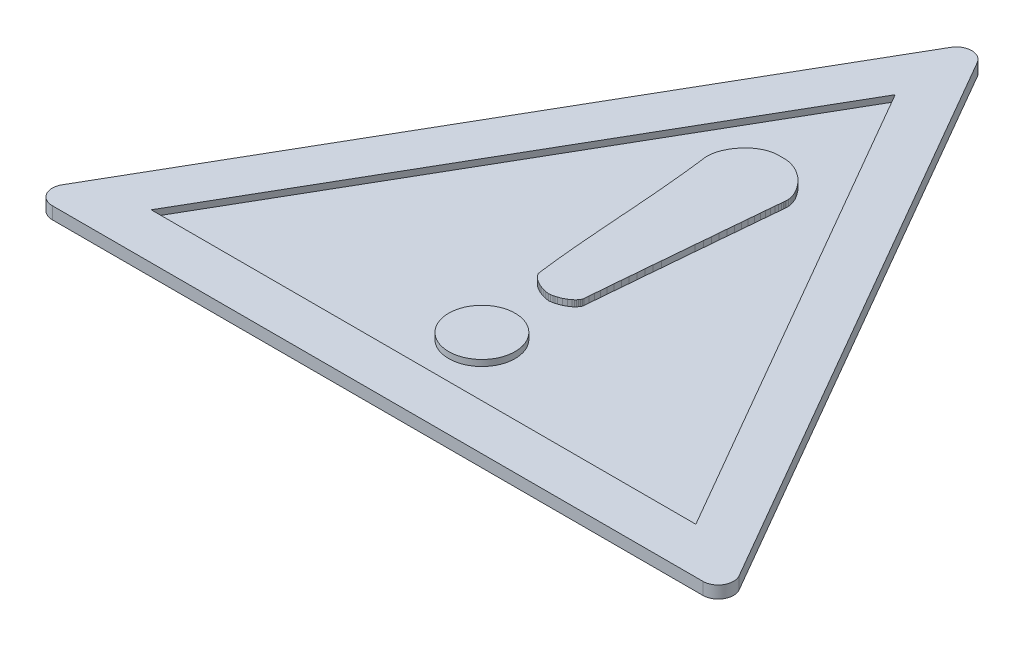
ISO-10303-21;
HEADER;
FILE_DESCRIPTION(('STEP AP214'),'2;1');
FILE_NAME('part.step','',(''),(''),'','','');
FILE_SCHEMA(('AUTOMOTIVE_DESIGN { 1 0 10303 214 1 1 1 1 }'));
ENDSEC;
DATA;
#1=APPLICATION_CONTEXT('core data for automotive mechanical design processes');
#2=APPLICATION_PROTOCOL_DEFINITION('international standard','automotive_design',2000,#1);
#3=PRODUCT_CONTEXT('',#1,'mechanical');
#4=PRODUCT('Part','Part','',(#3));
#5=PRODUCT_RELATED_PRODUCT_CATEGORY('part','',(#4));
#6=PRODUCT_DEFINITION_FORMATION('','',#4);
#7=PRODUCT_DEFINITION_CONTEXT('part definition',#1,'design');
#8=PRODUCT_DEFINITION('design','',#6,#7);
#9=PRODUCT_DEFINITION_SHAPE('','',#8);
#10=(LENGTH_UNIT() NAMED_UNIT(*) SI_UNIT(.MILLI.,.METRE.));
#11=(NAMED_UNIT(*) PLANE_ANGLE_UNIT() SI_UNIT($,.RADIAN.));
#12=(NAMED_UNIT(*) SI_UNIT($,.STERADIAN.) SOLID_ANGLE_UNIT());
#13=UNCERTAINTY_MEASURE_WITH_UNIT(LENGTH_MEASURE(1.E-05),#10,'distance_accuracy_value','');
#14=(GEOMETRIC_REPRESENTATION_CONTEXT(3) GLOBAL_UNCERTAINTY_ASSIGNED_CONTEXT((#13)) GLOBAL_UNIT_ASSIGNED_CONTEXT((#10,
#11,#12)) REPRESENTATION_CONTEXT('',''));
#15=CARTESIAN_POINT('',(0.,0.,0.));
#16=DIRECTION('',(0.,0.,1.));
#17=DIRECTION('',(1.,0.,0.));
#18=AXIS2_PLACEMENT_3D('',#15,#16,#17);
#19=CARTESIAN_POINT('',(-12.5,0.2,-15.));
#20=DIRECTION('',(0.,1.,0.));
#21=DIRECTION('',(0.,0.,1.));
#22=AXIS2_PLACEMENT_3D('',#19,#20,#21);
#23=PLANE('',#22);
#24=DIRECTION('',(-1.,0.,0.));
#25=VECTOR('',#24,1.);
#26=CARTESIAN_POINT('',(-0.112915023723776,0.2,-6.65611783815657));
#27=LINE('',#26,#25);
#28=CARTESIAN_POINT('',(-0.112915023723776,0.2,-6.65611783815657));
#29=VERTEX_POINT('',#28);
#30=CARTESIAN_POINT('',(-0.242515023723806,0.2,-6.65611783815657));
#31=VERTEX_POINT('',#30);
#32=EDGE_CURVE('E844',#29,#31,#27,.T.);
#33=ORIENTED_EDGE('',*,*,#32,.F.);
#34=DIRECTION('',(-0.999634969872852,0.,0.0270171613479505));
#35=VECTOR('',#34,1.);
#36=CARTESIAN_POINT('',(0.020284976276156,0.2,-6.65971783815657));
#37=LINE('',#36,#35);
#38=CARTESIAN_POINT('',(0.020284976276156,0.2,-6.65971783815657));
#39=VERTEX_POINT('',#38);
#40=EDGE_CURVE('E841',#39,#29,#37,.T.);
#41=ORIENTED_EDGE('',*,*,#40,.F.);
#42=DIRECTION('',(-0.99388373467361,0.,-0.110431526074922));
#43=VECTOR('',#42,1.);
#44=CARTESIAN_POINT('',(0.149884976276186,0.2,-6.64531783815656));
#45=LINE('',#44,#43);
#46=CARTESIAN_POINT('',(0.149884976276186,0.2,-6.64531783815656));
#47=VERTEX_POINT('',#46);
#48=EDGE_CURVE('E1069',#47,#39,#45,.T.);
#49=ORIENTED_EDGE('',*,*,#48,.F.);
#50=DIRECTION('',(-0.968492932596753,0.,-0.249041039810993));
#51=VECTOR('',#50,1.);
#52=CARTESIAN_POINT('',(0.275884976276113,0.2,-6.61291783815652));
#53=LINE('',#52,#51);
#54=CARTESIAN_POINT('',(0.275884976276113,0.2,-6.61291783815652));
#55=VERTEX_POINT('',#54);
#56=EDGE_CURVE('E1066',#55,#47,#53,.T.);
#57=ORIENTED_EDGE('',*,*,#56,.F.);
#58=DIRECTION('',(-0.937425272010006,0.,-0.348186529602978));
#59=VECTOR('',#58,1.);
#60=CARTESIAN_POINT('',(0.401884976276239,0.2,-6.56611783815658));
#61=LINE('',#60,#59);
#62=CARTESIAN_POINT('',(0.401884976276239,0.2,-6.56611783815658));
#63=VERTEX_POINT('',#62);
#64=EDGE_CURVE('E1064',#63,#55,#61,.T.);
#65=ORIENTED_EDGE('',*,*,#64,.F.);
#66=DIRECTION('',(-0.899814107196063,0.,-0.436273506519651));
#67=VECTOR('',#66,1.);
#68=CARTESIAN_POINT('',(0.520684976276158,0.2,-6.50851783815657));
#69=LINE('',#68,#67);
#70=CARTESIAN_POINT('',(0.520684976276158,0.2,-6.50851783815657));
#71=VERTEX_POINT('',#70);
#72=EDGE_CURVE('E1062',#71,#63,#69,.T.);
#73=ORIENTED_EDGE('',*,*,#72,.F.);
#74=DIRECTION('',(-0.827918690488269,0.,-0.560848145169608));
#75=VECTOR('',#74,1.);
#76=CARTESIAN_POINT('',(0.63228497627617,0.2,-6.43291783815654));
#77=LINE('',#76,#75);
#78=CARTESIAN_POINT('',(0.63228497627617,0.2,-6.43291783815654));
#79=VERTEX_POINT('',#78);
#80=EDGE_CURVE('E1060',#79,#71,#77,.T.);
#81=ORIENTED_EDGE('',*,*,#80,.F.);
#82=DIRECTION('',(-0.806404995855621,0.,-0.591363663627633));
#83=VECTOR('',#82,1.);
#84=CARTESIAN_POINT('',(0.740284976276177,0.2,-6.35371783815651));
#85=LINE('',#84,#83);
#86=CARTESIAN_POINT('',(0.740284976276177,0.2,-6.35371783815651));
#87=VERTEX_POINT('',#86);
#88=EDGE_CURVE('E1058',#87,#79,#85,.T.);
#89=ORIENTED_EDGE('',*,*,#88,.F.);
#90=DIRECTION('',(-0.733760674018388,0.,-0.679408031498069));
#91=VECTOR('',#90,1.);
#92=CARTESIAN_POINT('',(0.837484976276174,0.2,-6.26371783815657));
#93=LINE('',#92,#91);
#94=CARTESIAN_POINT('',(0.837484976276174,0.2,-6.26371783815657));
#95=VERTEX_POINT('',#94);
#96=EDGE_CURVE('E1056',#95,#87,#93,.T.);
#97=ORIENTED_EDGE('',*,*,#96,.F.);
#98=DIRECTION('',(-0.679408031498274,0.,-0.733760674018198));
#99=VECTOR('',#98,1.);
#100=CARTESIAN_POINT('',(0.927484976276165,0.2,-6.16651783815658));
#101=LINE('',#100,#99);
#102=CARTESIAN_POINT('',(0.927484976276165,0.2,-6.16651783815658));
#103=VERTEX_POINT('',#102);
#104=EDGE_CURVE('E1054',#103,#95,#101,.T.);
#105=ORIENTED_EDGE('',*,*,#104,.F.);
#106=DIRECTION('',(-0.617821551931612,0.,-0.786318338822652));
#107=VECTOR('',#106,1.);
#108=CARTESIAN_POINT('',(1.00668497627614,0.2,-6.06571783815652));
#109=LINE('',#108,#107);
#110=CARTESIAN_POINT('',(1.00668497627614,0.2,-6.06571783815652));
#111=VERTEX_POINT('',#110);
#112=EDGE_CURVE('E1052',#111,#103,#109,.T.);
#113=ORIENTED_EDGE('',*,*,#112,.F.);
#114=DIRECTION('',(-0.561501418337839,0.,-0.827475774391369));
#115=VECTOR('',#114,1.);
#116=CARTESIAN_POINT('',(1.07508497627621,0.2,-5.96491783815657));
#117=LINE('',#116,#115);
#118=CARTESIAN_POINT('',(1.07508497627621,0.2,-5.96491783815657));
#119=VERTEX_POINT('',#118);
#120=EDGE_CURVE('E1050',#119,#111,#117,.T.);
#121=ORIENTED_EDGE('',*,*,#120,.F.);
#122=DIRECTION('',(-0.496138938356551,0.,-0.868243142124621));
#123=VECTOR('',#122,1.);
#124=CARTESIAN_POINT('',(1.13268497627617,0.2,-5.86411783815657));
#125=LINE('',#124,#123);
#126=CARTESIAN_POINT('',(1.13268497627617,0.2,-5.86411783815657));
#127=VERTEX_POINT('',#126);
#128=EDGE_CURVE('E1048',#127,#119,#125,.T.);
#129=ORIENTED_EDGE('',*,*,#128,.F.);
#130=DIRECTION('',(-0.382351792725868,0.,-0.92401683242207));
#131=VECTOR('',#130,1.);
#132=CARTESIAN_POINT('',(1.17588497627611,0.2,-5.75971783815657));
#133=LINE('',#132,#131);
#134=CARTESIAN_POINT('',(1.17588497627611,0.2,-5.75971783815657));
#135=VERTEX_POINT('',#134);
#136=EDGE_CURVE('E1046',#135,#127,#133,.T.);
#137=ORIENTED_EDGE('',*,*,#136,.F.);
#138=DIRECTION('',(-0.284088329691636,0.,-0.95879811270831));
#139=VECTOR('',#138,1.);
#140=CARTESIAN_POINT('',(1.20468497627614,0.2,-5.66251783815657));
#141=LINE('',#140,#139);
#142=CARTESIAN_POINT('',(1.20468497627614,0.2,-5.66251783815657));
#143=VERTEX_POINT('',#142);
#144=EDGE_CURVE('E1044',#143,#135,#141,.T.);
#145=ORIENTED_EDGE('',*,*,#144,.F.);
#146=DIRECTION('',(-0.157990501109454,0.,-0.98744063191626));
#147=VECTOR('',#146,1.);
#148=CARTESIAN_POINT('',(1.2190849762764,0.2,-5.57251783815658));
#149=LINE('',#148,#147);
#150=CARTESIAN_POINT('',(1.2190849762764,0.2,-5.57251783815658));
#151=VERTEX_POINT('',#150);
#152=EDGE_CURVE('E1042',#151,#143,#149,.T.);
#153=ORIENTED_EDGE('',*,*,#152,.F.);
#154=DIRECTION('',(0.,0.,-1.));
#155=VECTOR('',#154,1.);
#156=CARTESIAN_POINT('',(1.2190849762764,0.2,-5.4861178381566));
#157=LINE('',#156,#155);
#158=CARTESIAN_POINT('',(1.2190849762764,0.2,-5.4861178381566));
#159=VERTEX_POINT('',#158);
#160=EDGE_CURVE('E1040',#159,#151,#157,.T.);
#161=ORIENTED_EDGE('',*,*,#160,.F.);
#162=DIRECTION('',(0.164398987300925,0.,-0.986393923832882));
#163=VECTOR('',#162,1.);
#164=CARTESIAN_POINT('',(1.2154849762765,0.2,-5.46451783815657));
#165=LINE('',#164,#163);
#166=CARTESIAN_POINT('',(1.2154849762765,0.2,-5.46451783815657));
#167=VERTEX_POINT('',#166);
#168=EDGE_CURVE('E1038',#167,#159,#165,.T.);
#169=ORIENTED_EDGE('',*,*,#168,.F.);
#170=DIRECTION('',(0.0830454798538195,0.,-0.996545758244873));
#171=VECTOR('',#170,1.);
#172=CARTESIAN_POINT('',(1.21188497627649,0.2,-5.42131783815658));
#173=LINE('',#172,#171);
#174=CARTESIAN_POINT('',(1.21188497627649,0.2,-5.42131783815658));
#175=VERTEX_POINT('',#174);
#176=EDGE_CURVE('E1036',#175,#167,#173,.T.);
#177=ORIENTED_EDGE('',*,*,#176,.F.);
#178=DIRECTION('',(0.110431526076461,0.,-0.993883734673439));
#179=VECTOR('',#178,1.);
#180=CARTESIAN_POINT('',(1.20468497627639,0.2,-5.35651783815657));
#181=LINE('',#180,#179);
#182=CARTESIAN_POINT('',(1.20468497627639,0.2,-5.35651783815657));
#183=VERTEX_POINT('',#182);
#184=EDGE_CURVE('E1034',#183,#175,#181,.T.);
#185=ORIENTED_EDGE('',*,*,#184,.F.);
#186=DIRECTION('',(0.0797452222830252,0.,-0.996815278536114));
#187=VECTOR('',#186,1.);
#188=CARTESIAN_POINT('',(1.19748497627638,0.2,-5.26651783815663));
#189=LINE('',#188,#187);
#190=CARTESIAN_POINT('',(1.19748497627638,0.2,-5.26651783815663));
#191=VERTEX_POINT('',#190);
#192=EDGE_CURVE('E1032',#191,#183,#189,.T.);
#193=ORIENTED_EDGE('',*,*,#192,.F.);
#194=DIRECTION('',(0.0995037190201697,0.,-0.995037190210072));
#195=VECTOR('',#194,1.);
#196=CARTESIAN_POINT('',(1.18668497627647,0.2,-5.15851783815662));
#197=LINE('',#196,#195);
#198=CARTESIAN_POINT('',(1.18668497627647,0.2,-5.15851783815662));
#199=VERTEX_POINT('',#198);
#200=EDGE_CURVE('E1030',#199,#191,#197,.T.);
#201=ORIENTED_EDGE('',*,*,#200,.F.);
#202=DIRECTION('',(0.0854011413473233,0.,-0.996346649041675));
#203=VECTOR('',#202,1.);
#204=CARTESIAN_POINT('',(1.17588497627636,0.2,-5.03251783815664));
#205=LINE('',#204,#203);
#206=CARTESIAN_POINT('',(1.17588497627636,0.2,-5.03251783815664));
#207=VERTEX_POINT('',#206);
#208=EDGE_CURVE('E1028',#207,#199,#205,.T.);
#209=ORIENTED_EDGE('',*,*,#208,.F.);
#210=DIRECTION('',(0.0970999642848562,0.,-0.995274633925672));
#211=VECTOR('',#210,1.);
#212=CARTESIAN_POINT('',(1.16148497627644,0.2,-4.88491783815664));
#213=LINE('',#212,#211);
#214=CARTESIAN_POINT('',(1.16148497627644,0.2,-4.88491783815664));
#215=VERTEX_POINT('',#214);
#216=EDGE_CURVE('E1026',#215,#207,#213,.T.);
#217=ORIENTED_EDGE('',*,*,#216,.F.);
#218=DIRECTION('',(0.0905357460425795,0.,-0.995893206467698));
#219=VECTOR('',#218,1.);
#220=CARTESIAN_POINT('',(1.14708497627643,0.2,-4.72651783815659));
#221=LINE('',#220,#219);
#222=CARTESIAN_POINT('',(1.14708497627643,0.2,-4.72651783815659));
#223=VERTEX_POINT('',#222);
#224=EDGE_CURVE('E1024',#223,#215,#221,.T.);
#225=ORIENTED_EDGE('',*,*,#224,.F.);
#226=DIRECTION('',(0.0813620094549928,0.,-0.996684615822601));
#227=VECTOR('',#226,1.);
#228=CARTESIAN_POINT('',(1.13268497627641,0.2,-4.55011783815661));
#229=LINE('',#228,#227);
#230=CARTESIAN_POINT('',(1.13268497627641,0.2,-4.55011783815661));
#231=VERTEX_POINT('',#230);
#232=EDGE_CURVE('E1022',#231,#223,#229,.T.);
#233=ORIENTED_EDGE('',*,*,#232,.F.);
#234=DIRECTION('',(0.0939225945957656,0.,-0.995579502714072));
#235=VECTOR('',#234,1.);
#236=CARTESIAN_POINT('',(1.1146849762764,0.2,-4.35931783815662));
#237=LINE('',#236,#235);
#238=CARTESIAN_POINT('',(1.1146849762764,0.2,-4.35931783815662));
#239=VERTEX_POINT('',#238);
#240=EDGE_CURVE('E1020',#239,#231,#237,.T.);
#241=ORIENTED_EDGE('',*,*,#240,.F.);
#242=DIRECTION('',(0.0889319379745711,0.,-0.996037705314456));
#243=VECTOR('',#242,1.);
#244=CARTESIAN_POINT('',(1.09668497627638,0.2,-4.15771783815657));
#245=LINE('',#244,#243);
#246=CARTESIAN_POINT('',(1.09668497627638,0.2,-4.15771783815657));
#247=VERTEX_POINT('',#246);
#248=EDGE_CURVE('E1018',#247,#239,#245,.T.);
#249=ORIENTED_EDGE('',*,*,#248,.F.);
#250=DIRECTION('',(0.0844430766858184,0.,-0.996428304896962));
#251=VECTOR('',#250,1.);
#252=CARTESIAN_POINT('',(1.07868497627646,0.2,-3.9453178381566));
#253=LINE('',#252,#251);
#254=CARTESIAN_POINT('',(1.07868497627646,0.2,-3.9453178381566));
#255=VERTEX_POINT('',#254);
#256=EDGE_CURVE('E1016',#255,#247,#253,.T.);
#257=ORIENTED_EDGE('',*,*,#256,.F.);
#258=DIRECTION('',(0.0963241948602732,0.,-0.995350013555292));
#259=VECTOR('',#258,1.);
#260=CARTESIAN_POINT('',(1.05708497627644,0.2,-3.72211783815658));
#261=LINE('',#260,#259);
#262=CARTESIAN_POINT('',(1.05708497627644,0.2,-3.72211783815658));
#263=VERTEX_POINT('',#262);
#264=EDGE_CURVE('E1014',#263,#255,#261,.T.);
#265=ORIENTED_EDGE('',*,*,#264,.F.);
#266=DIRECTION('',(0.0933407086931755,0.,-0.995634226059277));
#267=VECTOR('',#266,1.);
#268=CARTESIAN_POINT('',(1.03548497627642,0.2,-3.49171783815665));
#269=LINE('',#268,#267);
#270=CARTESIAN_POINT('',(1.03548497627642,0.2,-3.49171783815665));
#271=VERTEX_POINT('',#270);
#272=EDGE_CURVE('E1012',#271,#263,#269,.T.);
#273=ORIENTED_EDGE('',*,*,#272,.F.);
#274=DIRECTION('',(0.0755411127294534,0.,-0.997142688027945));
#275=VECTOR('',#274,1.);
#276=CARTESIAN_POINT('',(1.0174849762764,0.2,-3.25411783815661));
#277=LINE('',#276,#275);
#278=CARTESIAN_POINT('',(1.0174849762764,0.2,-3.25411783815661));
#279=VERTEX_POINT('',#278);
#280=EDGE_CURVE('E1010',#279,#271,#277,.T.);
#281=ORIENTED_EDGE('',*,*,#280,.F.);
#282=DIRECTION('',(0.0891952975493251,0.,-0.996014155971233));
#283=VECTOR('',#282,1.);
#284=CARTESIAN_POINT('',(0.995884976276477,0.2,-3.01291783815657));
#285=LINE('',#284,#283);
#286=CARTESIAN_POINT('',(0.995884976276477,0.2,-3.01291783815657));
#287=VERTEX_POINT('',#286);
#288=EDGE_CURVE('E1008',#287,#279,#285,.T.);
#289=ORIENTED_EDGE('',*,*,#288,.F.);
#290=DIRECTION('',(0.100931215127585,0.,-0.994893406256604));
#291=VECTOR('',#290,1.);
#292=CARTESIAN_POINT('',(0.970684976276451,0.2,-2.76451783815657));
#293=LINE('',#292,#291);
#294=CARTESIAN_POINT('',(0.970684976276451,0.2,-2.76451783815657));
#295=VERTEX_POINT('',#294);
#296=EDGE_CURVE('E1006',#295,#287,#293,.T.);
#297=ORIENTED_EDGE('',*,*,#296,.F.);
#298=DIRECTION('',(0.0854011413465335,0.,-0.996346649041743));
#299=VECTOR('',#298,1.);
#300=CARTESIAN_POINT('',(0.949084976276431,0.2,-2.51251783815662));
#301=LINE('',#300,#299);
#302=CARTESIAN_POINT('',(0.884284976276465,0.2,-1.75651783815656));
#303=VERTEX_POINT('',#302);
#304=EDGE_CURVE('E1004',#303,#295,#301,.T.);
#305=ORIENTED_EDGE('',*,*,#304,.F.);
#306=DIRECTION('',(0.0995037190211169,0.,-0.995037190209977));
#307=VECTOR('',#306,1.);
#308=CARTESIAN_POINT('',(0.859084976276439,0.2,-1.50451783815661));
#309=LINE('',#308,#307);
#310=CARTESIAN_POINT('',(0.859084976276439,0.2,-1.50451783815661));
#311=VERTEX_POINT('',#310);
#312=EDGE_CURVE('E1002',#311,#303,#309,.T.);
#313=ORIENTED_EDGE('',*,*,#312,.F.);
#314=DIRECTION('',(0.0878938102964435,0.,-0.996129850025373));
#315=VECTOR('',#314,1.);
#316=CARTESIAN_POINT('',(0.837484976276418,0.2,-1.25971783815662));
#317=LINE('',#316,#315);
#318=CARTESIAN_POINT('',(0.837484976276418,0.2,-1.25971783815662));
#319=VERTEX_POINT('',#318);
#320=EDGE_CURVE('E1000',#319,#311,#317,.T.);
#321=ORIENTED_EDGE('',*,*,#320,.F.);
#322=DIRECTION('',(0.0744199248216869,0.,-0.997226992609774));
#323=VECTOR('',#322,1.);
#324=CARTESIAN_POINT('',(0.8194849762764,0.2,-1.01851783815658));
#325=LINE('',#324,#323);
#326=CARTESIAN_POINT('',(0.8194849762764,0.2,-1.01851783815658));
#327=VERTEX_POINT('',#326);
#328=EDGE_CURVE('E998',#327,#319,#325,.T.);
#329=ORIENTED_EDGE('',*,*,#328,.F.);
#330=DIRECTION('',(0.0905357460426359,0.,-0.995893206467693));
#331=VECTOR('',#330,1.);
#332=CARTESIAN_POINT('',(0.797884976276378,0.2,-0.780917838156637));
#333=LINE('',#332,#331);
#334=CARTESIAN_POINT('',(0.797884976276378,0.2,-0.780917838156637));
#335=VERTEX_POINT('',#334);
#336=EDGE_CURVE('E996',#335,#327,#333,.T.);
#337=ORIENTED_EDGE('',*,*,#336,.F.);
#338=DIRECTION('',(0.0948090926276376,0.,-0.995495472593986));
#339=VECTOR('',#338,1.);
#340=CARTESIAN_POINT('',(0.776284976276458,0.2,-0.55411783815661));
#341=LINE('',#340,#339);
#342=CARTESIAN_POINT('',(0.776284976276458,0.2,-0.55411783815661));
#343=VERTEX_POINT('',#342);
#344=EDGE_CURVE('E994',#343,#335,#341,.T.);
#345=ORIENTED_EDGE('',*,*,#344,.F.);
#346=DIRECTION('',(0.0816932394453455,0.,-0.996657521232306));
#347=VECTOR('',#346,1.);
#348=CARTESIAN_POINT('',(0.75828497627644,0.2,-0.33451783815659));
#349=LINE('',#348,#347);
#350=CARTESIAN_POINT('',(0.75828497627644,0.2,-0.33451783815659));
#351=VERTEX_POINT('',#350);
#352=EDGE_CURVE('E992',#351,#343,#349,.T.);
#353=ORIENTED_EDGE('',*,*,#352,.F.);
#354=DIRECTION('',(0.0858883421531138,0.,-0.99630476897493));
#355=VECTOR('',#354,1.);
#356=CARTESIAN_POINT('',(0.740284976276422,0.2,-0.125717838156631));
#357=LINE('',#356,#355);
#358=CARTESIAN_POINT('',(0.740284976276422,0.2,-0.125717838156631));
#359=VERTEX_POINT('',#358);
#360=EDGE_CURVE('E990',#359,#351,#357,.T.);
#361=ORIENTED_EDGE('',*,*,#360,.F.);
#362=DIRECTION('',(0.0725356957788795,0.,-0.99736581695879));
#363=VECTOR('',#362,1.);
#364=CARTESIAN_POINT('',(0.725884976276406,0.2,0.072282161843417));
#365=LINE('',#364,#363);
#366=CARTESIAN_POINT('',(0.725884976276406,0.2,0.072282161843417));
#367=VERTEX_POINT('',#366);
#368=EDGE_CURVE('E988',#367,#359,#365,.T.);
#369=ORIENTED_EDGE('',*,*,#368,.F.);
#370=DIRECTION('',(0.097571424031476,0.,-0.99522852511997));
#371=VECTOR('',#370,1.);
#372=CARTESIAN_POINT('',(0.707884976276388,0.2,0.2558821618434));
#373=LINE('',#372,#371);
#374=CARTESIAN_POINT('',(0.707884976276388,0.2,0.2558821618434));
#375=VERTEX_POINT('',#374);
#376=EDGE_CURVE('E986',#375,#367,#373,.T.);
#377=ORIENTED_EDGE('',*,*,#376,.F.);
#378=DIRECTION('',(0.0830454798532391,0.,-0.996545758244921));
#379=VECTOR('',#378,1.);
#380=CARTESIAN_POINT('',(0.693484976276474,0.2,0.428682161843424));
#381=LINE('',#380,#379);
#382=CARTESIAN_POINT('',(0.693484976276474,0.2,0.428682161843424));
#383=VERTEX_POINT('',#382);
#384=EDGE_CURVE('E984',#383,#375,#381,.T.);
#385=ORIENTED_EDGE('',*,*,#384,.F.);
#386=DIRECTION('',(0.0695982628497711,0.,-0.99757510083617));
#387=VECTOR('',#386,1.);
#388=CARTESIAN_POINT('',(0.682684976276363,0.2,0.583482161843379));
#389=LINE('',#388,#387);
#390=CARTESIAN_POINT('',(0.682684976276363,0.2,0.583482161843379));
#391=VERTEX_POINT('',#390);
#392=EDGE_CURVE('E982',#391,#383,#389,.T.);
#393=ORIENTED_EDGE('',*,*,#392,.F.);
#394=DIRECTION('',(0.287347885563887,0.,-0.957826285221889));
#395=VECTOR('',#394,1.);
#396=CARTESIAN_POINT('',(0.671884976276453,0.2,0.619482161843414));
#397=LINE('',#396,#395);
#398=CARTESIAN_POINT('',(0.671884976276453,0.2,0.619482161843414));
#399=VERTEX_POINT('',#398);
#400=EDGE_CURVE('E980',#399,#391,#397,.T.);
#401=ORIENTED_EDGE('',*,*,#400,.F.);
#402=DIRECTION('',(0.413802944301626,0.,-0.910366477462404));
#403=VECTOR('',#402,1.);
#404=CARTESIAN_POINT('',(0.653884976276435,0.2,0.659082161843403));
#405=LINE('',#404,#403);
#406=CARTESIAN_POINT('',(0.653884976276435,0.2,0.659082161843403));
#407=VERTEX_POINT('',#406);
#408=EDGE_CURVE('E978',#407,#399,#405,.T.);
#409=ORIENTED_EDGE('',*,*,#408,.F.);
#410=DIRECTION('',(0.573462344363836,0.,-0.819231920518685));
#411=VECTOR('',#410,1.);
#412=CARTESIAN_POINT('',(0.628684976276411,0.2,0.695082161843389));
#413=LINE('',#412,#411);
#414=CARTESIAN_POINT('',(0.628684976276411,0.2,0.695082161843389));
#415=VERTEX_POINT('',#414);
#416=EDGE_CURVE('E976',#415,#407,#413,.T.);
#417=ORIENTED_EDGE('',*,*,#416,.F.);
#418=DIRECTION('',(0.624695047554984,0.,-0.780868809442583));
#419=VECTOR('',#418,1.);
#420=CARTESIAN_POINT('',(0.599884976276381,0.2,0.731082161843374));
#421=LINE('',#420,#419);
#422=CARTESIAN_POINT('',(0.599884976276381,0.2,0.731082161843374));
#423=VERTEX_POINT('',#422);
#424=EDGE_CURVE('E974',#423,#415,#421,.T.);
#425=ORIENTED_EDGE('',*,*,#424,.F.);
#426=DIRECTION('',(0.707106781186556,0.,-0.707106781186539));
#427=VECTOR('',#426,1.);
#428=CARTESIAN_POINT('',(0.563884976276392,0.2,0.767082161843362));
#429=LINE('',#428,#427);
#430=CARTESIAN_POINT('',(0.563884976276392,0.2,0.767082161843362));
#431=VERTEX_POINT('',#430);
#432=EDGE_CURVE('E972',#431,#423,#429,.T.);
#433=ORIENTED_EDGE('',*,*,#432,.F.);
#434=DIRECTION('',(0.739940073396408,0.,-0.672672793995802));
#435=VECTOR('',#434,1.);
#436=CARTESIAN_POINT('',(0.524284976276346,0.2,0.803082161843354));
#437=LINE('',#436,#435);
#438=CARTESIAN_POINT('',(0.524284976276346,0.2,0.803082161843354));
#439=VERTEX_POINT('',#438);
#440=EDGE_CURVE('E970',#439,#431,#437,.T.);
#441=ORIENTED_EDGE('',*,*,#440,.F.);
#442=DIRECTION('',(0.822192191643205,0.,-0.569209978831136));
#443=VECTOR('',#442,1.);
#444=CARTESIAN_POINT('',(0.4774849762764,0.2,0.835482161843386));
#445=LINE('',#444,#443);
#446=CARTESIAN_POINT('',(0.430684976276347,0.2,0.867882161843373));
#447=VERTEX_POINT('',#446);
#448=EDGE_CURVE('E968',#447,#439,#445,.T.);
#449=ORIENTED_EDGE('',*,*,#448,.F.);
#450=DIRECTION('',(0.882352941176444,0.,-0.470588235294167));
#451=VECTOR('',#450,1.);
#452=CARTESIAN_POINT('',(0.376684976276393,0.2,0.896682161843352));
#453=LINE('',#452,#451);
#454=CARTESIAN_POINT('',(0.322684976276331,0.2,0.925482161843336));
#455=VERTEX_POINT('',#454);
#456=EDGE_CURVE('E966',#455,#447,#453,.T.);
#457=ORIENTED_EDGE('',*,*,#456,.F.);
#458=DIRECTION('',(0.936329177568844,0.,-0.351123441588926));
#459=VECTOR('',#458,1.);
#460=CARTESIAN_POINT('',(0.265084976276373,0.2,0.947082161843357));
#461=LINE('',#460,#459);
#462=CARTESIAN_POINT('',(0.207484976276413,0.2,0.96868216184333));
#463=VERTEX_POINT('',#462);
#464=EDGE_CURVE('E964',#463,#455,#461,.T.);
#465=ORIENTED_EDGE('',*,*,#464,.F.);
#466=DIRECTION('',(0.954479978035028,0.,-0.298274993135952));
#467=VECTOR('',#466,1.);
#468=CARTESIAN_POINT('',(0.149884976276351,0.2,0.986682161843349));
#469=LINE('',#468,#467);
#470=CARTESIAN_POINT('',(0.149884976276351,0.2,0.986682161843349));
#471=VERTEX_POINT('',#470);
#472=EDGE_CURVE('E962',#471,#463,#469,.T.);
#473=ORIENTED_EDGE('',*,*,#472,.F.);
#474=DIRECTION('',(0.973417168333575,0.,-0.22903933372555));
#475=VECTOR('',#474,1.);
#476=CARTESIAN_POINT('',(0.0886849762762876,0.2,1.00108216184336));
#477=LINE('',#476,#475);
#478=CARTESIAN_POINT('',(0.0886849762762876,0.2,1.00108216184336));
#479=VERTEX_POINT('',#478);
#480=EDGE_CURVE('E960',#479,#471,#477,.T.);
#481=ORIENTED_EDGE('',*,*,#480,.F.);
#482=DIRECTION('',(0.982872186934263,0.,-0.1842885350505));
#483=VECTOR('',#482,1.);
#484=CARTESIAN_POINT('',(0.0310849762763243,0.2,1.01188216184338));
#485=LINE('',#484,#483);
#486=CARTESIAN_POINT('',(0.0310849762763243,0.2,1.01188216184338));
#487=VERTEX_POINT('',#486);
#488=EDGE_CURVE('E958',#487,#479,#485,.T.);
#489=ORIENTED_EDGE('',*,*,#488,.F.);
#490=DIRECTION('',(0.992277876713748,0.,-0.124034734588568));
#491=VECTOR('',#490,1.);
#492=CARTESIAN_POINT('',(-0.0265150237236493,0.2,1.01908216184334));
#493=LINE('',#492,#491);
#494=CARTESIAN_POINT('',(-0.0265150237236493,0.2,1.01908216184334));
#495=VERTEX_POINT('',#494);
#496=EDGE_CURVE('E956',#495,#487,#493,.T.);
#497=ORIENTED_EDGE('',*,*,#496,.F.);
#498=DIRECTION('',(0.992277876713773,0.,0.124034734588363));
#499=VECTOR('',#498,1.);
#500=CARTESIAN_POINT('',(-0.0841150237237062,0.2,1.01188216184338));
#501=LINE('',#500,#499);
#502=CARTESIAN_POINT('',(-0.0841150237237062,0.2,1.01188216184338));
#503=VERTEX_POINT('',#502);
#504=EDGE_CURVE('E954',#503,#495,#501,.T.);
#505=ORIENTED_EDGE('',*,*,#504,.F.);
#506=DIRECTION('',(0.993150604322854,0.,0.116841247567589));
#507=VECTOR('',#506,1.);
#508=CARTESIAN_POINT('',(-0.145315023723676,0.2,1.00468216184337));
#509=LINE('',#508,#507);
#510=CARTESIAN_POINT('',(-0.145315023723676,0.2,1.00468216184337));
#511=VERTEX_POINT('',#510);
#512=EDGE_CURVE('E952',#511,#503,#509,.T.);
#513=ORIENTED_EDGE('',*,*,#512,.F.);
#514=DIRECTION('',(0.970142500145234,0.,0.242535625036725));
#515=VECTOR('',#514,1.);
#516=CARTESIAN_POINT('',(-0.202915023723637,0.2,0.990282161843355));
#517=LINE('',#516,#515);
#518=CARTESIAN_POINT('',(-0.202915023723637,0.2,0.990282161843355));
#519=VERTEX_POINT('',#518);
#520=EDGE_CURVE('E950',#519,#511,#517,.T.);
#521=ORIENTED_EDGE('',*,*,#520,.F.);
#522=DIRECTION('',(0.959365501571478,0.,0.282166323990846));
#523=VECTOR('',#522,1.);
#524=CARTESIAN_POINT('',(-0.264115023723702,0.2,0.972282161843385));
#525=LINE('',#524,#523);
#526=CARTESIAN_POINT('',(-0.264115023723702,0.2,0.972282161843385));
#527=VERTEX_POINT('',#526);
#528=EDGE_CURVE('E948',#527,#519,#525,.T.);
#529=ORIENTED_EDGE('',*,*,#528,.F.);
#530=DIRECTION('',(0.942990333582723,0.,0.332820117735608));
#531=VECTOR('',#530,1.);
#532=CARTESIAN_POINT('',(-0.325315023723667,0.2,0.950682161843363));
#533=LINE('',#532,#531);
#534=CARTESIAN_POINT('',(-0.325315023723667,0.2,0.950682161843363));
#535=VERTEX_POINT('',#534);
#536=EDGE_CURVE('E946',#535,#527,#533,.T.);
#537=ORIENTED_EDGE('',*,*,#536,.F.);
#538=DIRECTION('',(0.92467809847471,0.,0.380749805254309));
#539=VECTOR('',#538,1.);
#540=CARTESIAN_POINT('',(-0.386515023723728,0.2,0.925482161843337));
#541=LINE('',#540,#539);
#542=CARTESIAN_POINT('',(-0.386515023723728,0.2,0.925482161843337));
#543=VERTEX_POINT('',#542);
#544=EDGE_CURVE('E944',#543,#535,#541,.T.);
#545=ORIENTED_EDGE('',*,*,#544,.F.);
#546=DIRECTION('',(0.916157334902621,0.,0.400818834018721));
#547=VECTOR('',#546,1.);
#548=CARTESIAN_POINT('',(-0.444115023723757,0.2,0.900282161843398));
#549=LINE('',#548,#547);
#550=CARTESIAN_POINT('',(-0.444115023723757,0.2,0.900282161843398));
#551=VERTEX_POINT('',#550);
#552=EDGE_CURVE('E942',#551,#543,#549,.T.);
#553=ORIENTED_EDGE('',*,*,#552,.F.);
#554=DIRECTION('',(0.882352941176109,0.,0.470588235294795));
#555=VECTOR('',#554,1.);
#556=CARTESIAN_POINT('',(-0.498115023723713,0.2,0.871482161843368));
#557=LINE('',#556,#555);
#558=CARTESIAN_POINT('',(-0.498115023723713,0.2,0.871482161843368));
#559=VERTEX_POINT('',#558);
#560=EDGE_CURVE('E940',#559,#551,#557,.T.);
#561=ORIENTED_EDGE('',*,*,#560,.F.);
#562=DIRECTION('',(0.857492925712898,0.,0.514495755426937));
#563=VECTOR('',#562,1.);
#564=CARTESIAN_POINT('',(-0.552115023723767,0.2,0.839082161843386));
#565=LINE('',#564,#563);
#566=CARTESIAN_POINT('',(-0.552115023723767,0.2,0.839082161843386));
#567=VERTEX_POINT('',#566);
#568=EDGE_CURVE('E938',#567,#559,#565,.T.);
#569=ORIENTED_EDGE('',*,*,#568,.F.);
#570=DIRECTION('',(0.822192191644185,0.,0.569209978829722));
#571=VECTOR('',#570,1.);
#572=CARTESIAN_POINT('',(-0.598915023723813,0.2,0.806682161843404));
#573=LINE('',#572,#571);
#574=CARTESIAN_POINT('',(-0.598915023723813,0.2,0.806682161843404));
#575=VERTEX_POINT('',#574);
#576=EDGE_CURVE('E936',#575,#567,#573,.T.);
#577=ORIENTED_EDGE('',*,*,#576,.F.);
#578=DIRECTION('',(0.799999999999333,0.,0.600000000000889));
#579=VECTOR('',#578,1.);
#580=CARTESIAN_POINT('',(-0.642115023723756,0.2,0.774282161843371));
#581=LINE('',#580,#579);
#582=CARTESIAN_POINT('',(-0.642115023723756,0.2,0.774282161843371));
#583=VERTEX_POINT('',#582);
#584=EDGE_CURVE('E934',#583,#575,#581,.T.);
#585=ORIENTED_EDGE('',*,*,#584,.F.);
#586=DIRECTION('',(0.73994007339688,0.,0.672672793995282));
#587=VECTOR('',#586,1.);
#588=CARTESIAN_POINT('',(-0.681715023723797,0.2,0.738282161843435));
#589=LINE('',#588,#587);
#590=CARTESIAN_POINT('',(-0.681715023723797,0.2,0.738282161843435));
#591=VERTEX_POINT('',#590);
#592=EDGE_CURVE('E932',#591,#583,#589,.T.);
#593=ORIENTED_EDGE('',*,*,#592,.F.);
#594=DIRECTION('',(0.707106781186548,0.,0.707106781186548));
#595=VECTOR('',#594,1.);
#596=CARTESIAN_POINT('',(-0.717715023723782,0.2,0.702282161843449));
#597=LINE('',#596,#595);
#598=CARTESIAN_POINT('',(-0.717715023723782,0.2,0.702282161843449));
#599=VERTEX_POINT('',#598);
#600=EDGE_CURVE('E930',#599,#591,#597,.T.);
#601=ORIENTED_EDGE('',*,*,#600,.F.);
#602=DIRECTION('',(0.53687549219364,0.,0.843661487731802));
#603=VECTOR('',#602,1.);
#604=CARTESIAN_POINT('',(-0.742915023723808,0.2,0.662682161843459));
#605=LINE('',#604,#603);
#606=CARTESIAN_POINT('',(-0.742915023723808,0.2,0.662682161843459));
#607=VERTEX_POINT('',#606);
#608=EDGE_CURVE('E928',#607,#599,#605,.T.);
#609=ORIENTED_EDGE('',*,*,#608,.F.);
#610=DIRECTION('',(0.514495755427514,0.,0.857492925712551));
#611=VECTOR('',#610,1.);
#612=CARTESIAN_POINT('',(-0.764515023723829,0.2,0.626682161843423));
#613=LINE('',#612,#611);
#614=CARTESIAN_POINT('',(-0.764515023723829,0.2,0.626682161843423));
#615=VERTEX_POINT('',#614);
#616=EDGE_CURVE('E926',#615,#607,#613,.T.);
#617=ORIENTED_EDGE('',*,*,#616,.F.);
#618=DIRECTION('',(0.287347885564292,0.,0.957826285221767));
#619=VECTOR('',#618,1.);
#620=CARTESIAN_POINT('',(-0.77531502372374,0.2,0.590682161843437));
#621=LINE('',#620,#619);
#622=CARTESIAN_POINT('',(-0.77531502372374,0.2,0.590682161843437));
#623=VERTEX_POINT('',#622);
#624=EDGE_CURVE('E924',#623,#615,#621,.T.);
#625=ORIENTED_EDGE('',*,*,#624,.F.);
#626=DIRECTION('',(0.133412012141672,0.,0.991060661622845));
#627=VECTOR('',#626,1.);
#628=CARTESIAN_POINT('',(-0.800515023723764,0.2,0.40348216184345));
#629=LINE('',#628,#627);
#630=CARTESIAN_POINT('',(-0.800515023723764,0.2,0.40348216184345));
#631=VERTEX_POINT('',#630);
#632=EDGE_CURVE('E922',#631,#623,#629,.T.);
#633=ORIENTED_EDGE('',*,*,#632,.F.);
#634=DIRECTION('',(0.114624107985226,0.,0.99340893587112));
#635=VECTOR('',#634,1.);
#636=CARTESIAN_POINT('',(-0.822115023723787,0.2,0.216282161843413));
#637=LINE('',#636,#635);
#638=CARTESIAN_POINT('',(-0.822115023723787,0.2,0.216282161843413));
#639=VERTEX_POINT('',#638);
#640=EDGE_CURVE('E920',#639,#631,#637,.T.);
#641=ORIENTED_EDGE('',*,*,#640,.F.);
#642=DIRECTION('',(0.11684124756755,0.,0.993150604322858));
#643=VECTOR('',#642,1.);
#644=CARTESIAN_POINT('',(-0.843715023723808,0.2,0.0326821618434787));
#645=LINE('',#644,#643);
#646=CARTESIAN_POINT('',(-0.843715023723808,0.2,0.0326821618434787));
#647=VERTEX_POINT('',#646);
#648=EDGE_CURVE('E918',#647,#639,#645,.T.);
#649=ORIENTED_EDGE('',*,*,#648,.F.);
#650=DIRECTION('',(0.114624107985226,0.,0.99340893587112));
#651=VECTOR('',#650,1.);
#652=CARTESIAN_POINT('',(-0.86531502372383,0.2,-0.154517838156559));
#653=LINE('',#652,#651);
#654=CARTESIAN_POINT('',(-0.86531502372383,0.2,-0.154517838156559));
#655=VERTEX_POINT('',#654);
#656=EDGE_CURVE('E916',#655,#647,#653,.T.);
#657=ORIENTED_EDGE('',*,*,#656,.F.);
#658=DIRECTION('',(0.0957124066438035,0.,0.995409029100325));
#659=VECTOR('',#658,1.);
#660=CARTESIAN_POINT('',(-0.883315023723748,0.2,-0.341717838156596));
#661=LINE('',#660,#659);
#662=CARTESIAN_POINT('',(-0.901315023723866,0.2,-0.528917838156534));
#663=VERTEX_POINT('',#662);
#664=EDGE_CURVE('E914',#663,#655,#661,.T.);
#665=ORIENTED_EDGE('',*,*,#664,.F.);
#666=DIRECTION('',(0.0975714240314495,0.,0.995228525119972));
#667=VECTOR('',#666,1.);
#668=CARTESIAN_POINT('',(-0.919315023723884,0.2,-0.712517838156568));
#669=LINE('',#668,#667);
#670=CARTESIAN_POINT('',(-0.919315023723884,0.2,-0.712517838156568));
#671=VERTEX_POINT('',#670);
#672=EDGE_CURVE('E912',#671,#663,#669,.T.);
#673=ORIENTED_EDGE('',*,*,#672,.F.);
#674=DIRECTION('',(0.0766964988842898,0.,0.997054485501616));
#675=VECTOR('',#674,1.);
#676=CARTESIAN_POINT('',(-0.933715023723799,0.2,-0.899717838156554));
#677=LINE('',#676,#675);
#678=CARTESIAN_POINT('',(-0.933715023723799,0.2,-0.899717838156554));
#679=VERTEX_POINT('',#678);
#680=EDGE_CURVE('E910',#679,#671,#677,.T.);
#681=ORIENTED_EDGE('',*,*,#680,.F.);
#682=DIRECTION('',(0.0957124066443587,0.,0.995409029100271));
#683=VECTOR('',#682,1.);
#684=CARTESIAN_POINT('',(-0.951715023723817,0.2,-1.08691783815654));
#685=LINE('',#684,#683);
#686=CARTESIAN_POINT('',(-0.951715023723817,0.2,-1.08691783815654));
#687=VERTEX_POINT('',#686);
#688=EDGE_CURVE('E908',#687,#679,#685,.T.);
#689=ORIENTED_EDGE('',*,*,#688,.F.);
#690=DIRECTION('',(0.0766964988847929,0.,0.997054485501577));
#691=VECTOR('',#690,1.);
#692=CARTESIAN_POINT('',(-0.96611502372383,0.2,-1.27411783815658));
#693=LINE('',#692,#691);
#694=CARTESIAN_POINT('',(-0.99491502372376,0.2,-1.64851783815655));
#695=VERTEX_POINT('',#694);
#696=EDGE_CURVE('E906',#695,#687,#693,.T.);
#697=ORIENTED_EDGE('',*,*,#696,.F.);
#698=DIRECTION('',(0.0781912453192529,0.,0.996938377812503));
#699=VECTOR('',#698,1.);
#700=CARTESIAN_POINT('',(-1.00931502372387,0.2,-1.83211783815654));
#701=LINE('',#700,#699);
#702=CARTESIAN_POINT('',(-1.00931502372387,0.2,-1.83211783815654));
#703=VERTEX_POINT('',#702);
#704=EDGE_CURVE('E904',#703,#695,#701,.T.);
#705=ORIENTED_EDGE('',*,*,#704,.F.);
#706=DIRECTION('',(0.0766964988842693,0.,0.997054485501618));
#707=VECTOR('',#706,1.);
#708=CARTESIAN_POINT('',(-1.02371502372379,0.2,-2.01931783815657));
#709=LINE('',#708,#707);
#710=CARTESIAN_POINT('',(-1.05251502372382,0.2,-2.39371783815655));
#711=VERTEX_POINT('',#710);
#712=EDGE_CURVE('E902',#711,#703,#709,.T.);
#713=ORIENTED_EDGE('',*,*,#712,.F.);
#714=DIRECTION('',(0.0575965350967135,0.,0.998339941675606));
#715=VECTOR('',#714,1.);
#716=CARTESIAN_POINT('',(-1.06331502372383,0.2,-2.58091783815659));
#717=LINE('',#716,#715);
#718=CARTESIAN_POINT('',(-1.06331502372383,0.2,-2.58091783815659));
#719=VERTEX_POINT('',#718);
#720=EDGE_CURVE('E900',#719,#711,#717,.T.);
#721=ORIENTED_EDGE('',*,*,#720,.F.);
#722=DIRECTION('',(0.0766964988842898,0.,0.997054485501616));
#723=VECTOR('',#722,1.);
#724=CARTESIAN_POINT('',(-1.07771502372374,0.2,-2.76811783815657));
#725=LINE('',#724,#723);
#726=CARTESIAN_POINT('',(-1.09211502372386,0.2,-2.95531783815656));
#727=VERTEX_POINT('',#726);
#728=EDGE_CURVE('E898',#727,#719,#725,.T.);
#729=ORIENTED_EDGE('',*,*,#728,.F.);
#730=DIRECTION('',(0.078191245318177,0.,0.996938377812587));
#731=VECTOR('',#730,1.);
#732=CARTESIAN_POINT('',(-1.10651502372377,0.2,-3.13891783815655));
#733=LINE('',#732,#731);
#734=CARTESIAN_POINT('',(-1.10651502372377,0.2,-3.13891783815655));
#735=VERTEX_POINT('',#734);
#736=EDGE_CURVE('E896',#735,#727,#733,.T.);
#737=ORIENTED_EDGE('',*,*,#736,.F.);
#738=DIRECTION('',(0.0766964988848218,0.,0.997054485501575));
#739=VECTOR('',#738,1.);
#740=CARTESIAN_POINT('',(-1.12091502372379,0.2,-3.32611783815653));
#741=LINE('',#740,#739);
#742=CARTESIAN_POINT('',(-1.1353150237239,0.2,-3.51331783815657));
#743=VERTEX_POINT('',#742);
#744=EDGE_CURVE('E894',#743,#735,#741,.T.);
#745=ORIENTED_EDGE('',*,*,#744,.F.);
#746=DIRECTION('',(0.0957124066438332,0.,0.995409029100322));
#747=VECTOR('',#746,1.);
#748=CARTESIAN_POINT('',(-1.15331502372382,0.2,-3.70051783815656));
#749=LINE('',#748,#747);
#750=CARTESIAN_POINT('',(-1.15331502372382,0.2,-3.70051783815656));
#751=VERTEX_POINT('',#750);
#752=EDGE_CURVE('E892',#751,#743,#749,.T.);
#753=ORIENTED_EDGE('',*,*,#752,.F.);
#754=DIRECTION('',(0.0766964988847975,0.,0.997054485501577));
#755=VECTOR('',#754,1.);
#756=CARTESIAN_POINT('',(-1.16771502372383,0.2,-3.8877178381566));
#757=LINE('',#756,#755);
#758=CARTESIAN_POINT('',(-1.16771502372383,0.2,-3.8877178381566));
#759=VERTEX_POINT('',#758);
#760=EDGE_CURVE('E890',#759,#751,#757,.T.);
#761=ORIENTED_EDGE('',*,*,#760,.F.);
#762=DIRECTION('',(0.0957124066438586,0.,0.995409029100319));
#763=VECTOR('',#762,1.);
#764=CARTESIAN_POINT('',(-1.18571502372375,0.2,-4.07491783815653));
#765=LINE('',#764,#763);
#766=CARTESIAN_POINT('',(-1.18571502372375,0.2,-4.07491783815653));
#767=VERTEX_POINT('',#766);
#768=EDGE_CURVE('E888',#767,#759,#765,.T.);
#769=ORIENTED_EDGE('',*,*,#768,.F.);
#770=DIRECTION('',(0.0975714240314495,0.,0.995228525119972));
#771=VECTOR('',#770,1.);
#772=CARTESIAN_POINT('',(-1.20371502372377,0.2,-4.25851783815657));
#773=LINE('',#772,#771);
#774=CARTESIAN_POINT('',(-1.20371502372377,0.2,-4.25851783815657));
#775=VERTEX_POINT('',#774);
#776=EDGE_CURVE('E886',#775,#767,#773,.T.);
#777=ORIENTED_EDGE('',*,*,#776,.F.);
#778=DIRECTION('',(0.0957124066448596,0.,0.995409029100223));
#779=VECTOR('',#778,1.);
#780=CARTESIAN_POINT('',(-1.22171502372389,0.2,-4.4457178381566));
#781=LINE('',#780,#779);
#782=CARTESIAN_POINT('',(-1.2397150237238,0.2,-4.63291783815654));
#783=VERTEX_POINT('',#782);
#784=EDGE_CURVE('E884',#783,#775,#781,.T.);
#785=ORIENTED_EDGE('',*,*,#784,.F.);
#786=DIRECTION('',(0.114624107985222,0.,0.993408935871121));
#787=VECTOR('',#786,1.);
#788=CARTESIAN_POINT('',(-1.26131502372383,0.2,-4.82011783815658));
#789=LINE('',#788,#787);
#790=CARTESIAN_POINT('',(-1.26131502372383,0.2,-4.82011783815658));
#791=VERTEX_POINT('',#790);
#792=EDGE_CURVE('E882',#791,#783,#789,.T.);
#793=ORIENTED_EDGE('',*,*,#792,.F.);
#794=DIRECTION('',(0.11684124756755,0.,0.993150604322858));
#795=VECTOR('',#794,1.);
#796=CARTESIAN_POINT('',(-1.28291502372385,0.2,-5.00371783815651));
#797=LINE('',#796,#795);
#798=CARTESIAN_POINT('',(-1.28291502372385,0.2,-5.00371783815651));
#799=VERTEX_POINT('',#798);
#800=EDGE_CURVE('E880',#799,#791,#797,.T.);
#801=ORIENTED_EDGE('',*,*,#800,.F.);
#802=DIRECTION('',(0.114624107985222,0.,0.993408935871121));
#803=VECTOR('',#802,1.);
#804=CARTESIAN_POINT('',(-1.30451502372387,0.2,-5.19091783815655));
#805=LINE('',#804,#803);
#806=CARTESIAN_POINT('',(-1.30451502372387,0.2,-5.19091783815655));
#807=VERTEX_POINT('',#806);
#808=EDGE_CURVE('E878',#807,#799,#805,.T.);
#809=ORIENTED_EDGE('',*,*,#808,.F.);
#810=DIRECTION('',(0.13341201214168,0.,0.991060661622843));
#811=VECTOR('',#810,1.);
#812=CARTESIAN_POINT('',(-1.32971502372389,0.2,-5.37811783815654));
#813=LINE('',#812,#811);
#814=CARTESIAN_POINT('',(-1.32971502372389,0.2,-5.37811783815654));
#815=VERTEX_POINT('',#814);
#816=EDGE_CURVE('E876',#815,#807,#813,.T.);
#817=ORIENTED_EDGE('',*,*,#816,.F.);
#818=DIRECTION('',(0.0322412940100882,0.,0.999480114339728));
#819=VECTOR('',#818,1.);
#820=CARTESIAN_POINT('',(-1.3333150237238,0.2,-5.48971783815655));
#821=LINE('',#820,#819);
#822=CARTESIAN_POINT('',(-1.3333150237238,0.2,-5.48971783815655));
#823=VERTEX_POINT('',#822);
#824=EDGE_CURVE('E874',#823,#815,#821,.T.);
#825=ORIENTED_EDGE('',*,*,#824,.F.);
#826=DIRECTION('',(-0.0963241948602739,0.,0.995350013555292));
#827=VECTOR('',#826,1.);
#828=CARTESIAN_POINT('',(-1.32251502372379,0.2,-5.60131783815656));
#829=LINE('',#828,#827);
#830=CARTESIAN_POINT('',(-1.32251502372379,0.2,-5.60131783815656));
#831=VERTEX_POINT('',#830);
#832=EDGE_CURVE('E872',#831,#823,#829,.T.);
#833=ORIENTED_EDGE('',*,*,#832,.F.);
#834=DIRECTION('',(-0.184288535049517,0.,0.982872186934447));
#835=VECTOR('',#834,1.);
#836=CARTESIAN_POINT('',(-1.30091502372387,0.2,-5.71651783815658));
#837=LINE('',#836,#835);
#838=CARTESIAN_POINT('',(-1.30091502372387,0.2,-5.71651783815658));
#839=VERTEX_POINT('',#838);
#840=EDGE_CURVE('E870',#839,#831,#837,.T.);
#841=ORIENTED_EDGE('',*,*,#840,.F.);
#842=DIRECTION('',(-0.298274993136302,0.,0.954479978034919));
#843=VECTOR('',#842,1.);
#844=CARTESIAN_POINT('',(-1.26491502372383,0.2,-5.83171783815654));
#845=LINE('',#844,#843);
#846=CARTESIAN_POINT('',(-1.26491502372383,0.2,-5.83171783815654));
#847=VERTEX_POINT('',#846);
#848=EDGE_CURVE('E868',#847,#839,#845,.T.);
#849=ORIENTED_EDGE('',*,*,#848,.F.);
#850=DIRECTION('',(-0.411586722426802,0.,0.911370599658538));
#851=VECTOR('',#850,1.);
#852=CARTESIAN_POINT('',(-1.21451502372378,0.2,-5.94331783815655));
#853=LINE('',#852,#851);
#854=CARTESIAN_POINT('',(-1.21451502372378,0.2,-5.94331783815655));
#855=VERTEX_POINT('',#854);
#856=EDGE_CURVE('E866',#855,#847,#853,.T.);
#857=ORIENTED_EDGE('',*,*,#856,.F.);
#858=DIRECTION('',(-0.47058823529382,0.,0.882352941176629));
#859=VECTOR('',#858,1.);
#860=CARTESIAN_POINT('',(-1.15691502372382,0.2,-6.05131783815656));
#861=LINE('',#860,#859);
#862=CARTESIAN_POINT('',(-1.15691502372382,0.2,-6.05131783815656));
#863=VERTEX_POINT('',#862);
#864=EDGE_CURVE('E864',#863,#855,#861,.T.);
#865=ORIENTED_EDGE('',*,*,#864,.F.);
#866=DIRECTION('',(-0.567732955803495,0.,0.82321278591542));
#867=VECTOR('',#866,1.);
#868=CARTESIAN_POINT('',(-1.08491502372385,0.2,-6.15571783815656));
#869=LINE('',#868,#867);
#870=CARTESIAN_POINT('',(-1.08491502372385,0.2,-6.15571783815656));
#871=VERTEX_POINT('',#870);
#872=EDGE_CURVE('E862',#871,#863,#869,.T.);
#873=ORIENTED_EDGE('',*,*,#872,.F.);
#874=DIRECTION('',(-0.617821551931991,0.,0.786318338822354));
#875=VECTOR('',#874,1.);
#876=CARTESIAN_POINT('',(-1.00571502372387,0.2,-6.25651783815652));
#877=LINE('',#876,#875);
#878=CARTESIAN_POINT('',(-1.00571502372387,0.2,-6.25651783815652));
#879=VERTEX_POINT('',#878);
#880=EDGE_CURVE('E860',#879,#871,#877,.T.);
#881=ORIENTED_EDGE('',*,*,#880,.F.);
#882=DIRECTION('',(-0.692531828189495,0.,0.721387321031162));
#883=VECTOR('',#882,1.);
#884=CARTESIAN_POINT('',(-0.919315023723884,0.2,-6.34651783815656));
#885=LINE('',#884,#883);
#886=CARTESIAN_POINT('',(-0.919315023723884,0.2,-6.34651783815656));
#887=VERTEX_POINT('',#886);
#888=EDGE_CURVE('E858',#887,#879,#885,.T.);
#889=ORIENTED_EDGE('',*,*,#888,.F.);
#890=DIRECTION('',(-0.761243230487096,0.,0.648466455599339));
#891=VECTOR('',#890,1.);
#892=CARTESIAN_POINT('',(-0.822115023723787,0.2,-6.42931783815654));
#893=LINE('',#892,#891);
#894=CARTESIAN_POINT('',(-0.822115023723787,0.2,-6.42931783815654));
#895=VERTEX_POINT('',#894);
#896=EDGE_CURVE('E856',#895,#887,#893,.T.);
#897=ORIENTED_EDGE('',*,*,#896,.F.);
#898=DIRECTION('',(-0.823212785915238,0.,0.567732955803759));
#899=VECTOR('',#898,1.);
#900=CARTESIAN_POINT('',(-0.717715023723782,0.2,-6.50131783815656));
#901=LINE('',#900,#899);
#902=CARTESIAN_POINT('',(-0.717715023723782,0.2,-6.50131783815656));
#903=VERTEX_POINT('',#902);
#904=EDGE_CURVE('E854',#903,#895,#901,.T.);
#905=ORIENTED_EDGE('',*,*,#904,.F.);
#906=DIRECTION('',(-0.876812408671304,0.,0.48083261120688));
#907=VECTOR('',#906,1.);
#908=CARTESIAN_POINT('',(-0.60611502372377,0.2,-6.56251783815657));
#909=LINE('',#908,#907);
#910=CARTESIAN_POINT('',(-0.60611502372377,0.2,-6.56251783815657));
#911=VERTEX_POINT('',#910);
#912=EDGE_CURVE('E852',#911,#903,#909,.T.);
#913=ORIENTED_EDGE('',*,*,#912,.F.);
#914=DIRECTION('',(-0.926466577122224,0.,0.376377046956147));
#915=VECTOR('',#914,1.);
#916=CARTESIAN_POINT('',(-0.490915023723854,0.2,-6.60931783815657));
#917=LINE('',#916,#915);
#918=CARTESIAN_POINT('',(-0.490915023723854,0.2,-6.60931783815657));
#919=VERTEX_POINT('',#918);
#920=EDGE_CURVE('E850',#919,#911,#917,.T.);
#921=ORIENTED_EDGE('',*,*,#920,.F.);
#922=DIRECTION('',(-0.96670522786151,0.,0.25589256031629));
#923=VECTOR('',#922,1.);
#924=CARTESIAN_POINT('',(-0.368515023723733,0.2,-6.6417178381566));
#925=LINE('',#924,#923);
#926=CARTESIAN_POINT('',(-0.368515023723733,0.2,-6.6417178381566));
#927=VERTEX_POINT('',#926);
#928=EDGE_CURVE('E848',#927,#919,#925,.T.);
#929=ORIENTED_EDGE('',*,*,#928,.F.);
#930=DIRECTION('',(-0.993532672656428,0.,0.113546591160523));
#931=VECTOR('',#930,1.);
#932=CARTESIAN_POINT('',(-0.242515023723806,0.2,-6.65611783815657));
#933=LINE('',#932,#931);
#934=EDGE_CURVE('E846',#31,#927,#933,.T.);
#935=ORIENTED_EDGE('',*,*,#934,.F.);
#936=EDGE_LOOP('',(#33,#41,#49,#57,#65,#73,#81,#89,#97,#105,#113,#121,#129,#137,#145,#153,#161,
#169,#177,#185,#193,#201,#209,#217,#225,#233,#241,#249,#257,#265,#273,#281,#289,#297,#305,#313,
#321,#329,#337,#345,#353,#361,#369,#377,#385,#393,#401,#409,#417,#425,#433,#441,#449,#457,#465,
#473,#481,#489,#497,#505,#513,#521,#529,#537,#545,#553,#561,#569,#577,#585,#593,#601,#609,#617,
#625,#633,#641,#649,#657,#665,#673,#681,#689,#697,#705,#713,#721,#729,#737,#745,#753,#761,#769,
#777,#785,#793,#801,#809,#817,#825,#833,#841,#849,#857,#865,#873,#881,#889,#897,#905,#913,#921,
#929,#935));
#937=FACE_BOUND('',#936,.T.);
#938=DIRECTION('',(-0.5,0.,-0.866025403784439));
#939=VECTOR('',#938,1.);
#940=CARTESIAN_POINT('',(-1.29903810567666,0.2,-12.5290561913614));
#941=LINE('',#940,#939);
#942=CARTESIAN_POINT('',(8.90192378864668,0.2,5.1395280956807));
#943=VERTEX_POINT('',#942);
#944=CARTESIAN_POINT('',(0.,0.2,-10.2790561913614));
#945=VERTEX_POINT('',#944);
#946=EDGE_CURVE('E1640',#943,#945,#941,.T.);
#947=ORIENTED_EDGE('',*,*,#946,.T.);
#948=DIRECTION('',(-0.500000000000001,0.,0.866025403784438));
#949=VECTOR('',#948,1.);
#950=CARTESIAN_POINT('',(-10.2009618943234,0.2,7.38952809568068));
#951=LINE('',#950,#949);
#952=CARTESIAN_POINT('',(-8.9019237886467,0.2,5.13952809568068));
#953=VERTEX_POINT('',#952);
#954=EDGE_CURVE('E1642',#945,#953,#951,.T.);
#955=ORIENTED_EDGE('',*,*,#954,.T.);
#956=DIRECTION('',(1.,0.,0.));
#957=VECTOR('',#956,1.);
#958=CARTESIAN_POINT('',(11.5,0.2,5.13952809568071));
#959=LINE('',#958,#957);
#960=EDGE_CURVE('E1644',#953,#943,#959,.T.);
#961=ORIENTED_EDGE('',*,*,#960,.T.);
#962=EDGE_LOOP('',(#947,#955,#961));
#963=FACE_BOUND('',#962,.T.);
#964=CARTESIAN_POINT('',(-0.0265150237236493,0.2,3.2042821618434));
#965=DIRECTION('',(0.,1.,0.));
#966=DIRECTION('',(0.,0.,1.));
#967=AXIS2_PLACEMENT_3D('',#964,#965,#966);
#968=CIRCLE('',#967,1.08622207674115);
#969=CARTESIAN_POINT('',(-0.0265150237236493,0.2,4.29050423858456));
#970=VERTEX_POINT('',#969);
#971=EDGE_CURVE('E829',#970,#970,#968,.T.);
#972=ORIENTED_EDGE('',*,*,#971,.F.);
#973=EDGE_LOOP('',(#972));
#974=FACE_BOUND('',#973,.T.);
#975=ADVANCED_FACE('F51',(#937,#963,#974),#23,.T.);
#976=CARTESIAN_POINT('',(0.,0.4,-13.2790561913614));
#977=DIRECTION('',(0.,1.,0.));
#978=DIRECTION('',(0.,0.,1.));
#979=AXIS2_PLACEMENT_3D('',#976,#977,#978);
#980=PLANE('',#979);
#981=DIRECTION('',(-0.499999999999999,0.,-0.866025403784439));
#982=VECTOR('',#981,1.);
#983=CARTESIAN_POINT('',(0.,0.4,-13.2790561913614));
#984=LINE('',#983,#982);
#985=CARTESIAN_POINT('',(11.0669872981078,0.4,5.88952809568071));
#986=VERTEX_POINT('',#985);
#987=CARTESIAN_POINT('',(0.433012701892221,0.4,-12.5290561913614));
#988=VERTEX_POINT('',#987);
#989=EDGE_CURVE('E1662',#986,#988,#984,.T.);
#990=ORIENTED_EDGE('',*,*,#989,.T.);
#991=CARTESIAN_POINT('',(0.,0.4,-12.2790561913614));
#992=DIRECTION('',(0.,1.,0.));
#993=DIRECTION('',(0.,0.,1.));
#994=AXIS2_PLACEMENT_3D('',#991,#992,#993);
#995=CIRCLE('',#994,0.5);
#996=CARTESIAN_POINT('',(-0.433012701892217,0.4,-12.5290561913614));
#997=VERTEX_POINT('',#996);
#998=EDGE_CURVE('E810',#988,#997,#995,.T.);
#999=ORIENTED_EDGE('',*,*,#998,.T.);
#1000=DIRECTION('',(-0.500000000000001,0.,0.866025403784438));
#1001=VECTOR('',#1000,1.);
#1002=CARTESIAN_POINT('',(-11.5,0.4,6.63952809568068));
#1003=LINE('',#1002,#1001);
#1004=CARTESIAN_POINT('',(-11.0669872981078,0.4,5.88952809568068));
#1005=VERTEX_POINT('',#1004);
#1006=EDGE_CURVE('E1664',#997,#1005,#1003,.T.);
#1007=ORIENTED_EDGE('',*,*,#1006,.T.);
#1008=CARTESIAN_POINT('',(-10.6339745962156,0.4,6.13952809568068));
#1009=DIRECTION('',(0.,1.,0.));
#1010=DIRECTION('',(0.,0.,1.));
#1011=AXIS2_PLACEMENT_3D('',#1008,#1009,#1010);
#1012=CIRCLE('',#1011,0.5);
#1013=CARTESIAN_POINT('',(-10.6339745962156,0.4,6.63952809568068));
#1014=VERTEX_POINT('',#1013);
#1015=EDGE_CURVE('E815',#1005,#1014,#1012,.T.);
#1016=ORIENTED_EDGE('',*,*,#1015,.T.);
#1017=DIRECTION('',(1.,0.,0.));
#1018=VECTOR('',#1017,1.);
#1019=CARTESIAN_POINT('',(11.5,0.4,6.63952809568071));
#1020=LINE('',#1019,#1018);
#1021=CARTESIAN_POINT('',(10.6339745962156,0.4,6.63952809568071));
#1022=VERTEX_POINT('',#1021);
#1023=EDGE_CURVE('E1667',#1014,#1022,#1020,.T.);
#1024=ORIENTED_EDGE('',*,*,#1023,.T.);
#1025=CARTESIAN_POINT('',(10.6339745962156,0.4,6.13952809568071));
#1026=DIRECTION('',(0.,1.,0.));
#1027=DIRECTION('',(0.,0.,1.));
#1028=AXIS2_PLACEMENT_3D('',#1025,#1026,#1027);
#1029=CIRCLE('',#1028,0.5);
#1030=EDGE_CURVE('E1676',#1022,#986,#1029,.T.);
#1031=ORIENTED_EDGE('',*,*,#1030,.T.);
#1032=EDGE_LOOP('',(#990,#999,#1007,#1016,#1024,#1031));
#1033=FACE_BOUND('',#1032,.T.);
#1034=DIRECTION('',(-0.500000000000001,0.,0.866025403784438));
#1035=VECTOR('',#1034,1.);
#1036=CARTESIAN_POINT('',(-10.2009618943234,0.4,7.38952809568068));
#1037=LINE('',#1036,#1035);
#1038=CARTESIAN_POINT('',(0.,0.4,-10.2790561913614));
#1039=VERTEX_POINT('',#1038);
#1040=CARTESIAN_POINT('',(-8.9019237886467,0.4,5.13952809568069));
#1041=VERTEX_POINT('',#1040);
#1042=EDGE_CURVE('E1648',#1039,#1041,#1037,.T.);
#1043=ORIENTED_EDGE('',*,*,#1042,.F.);
#1044=DIRECTION('',(-0.5,0.,-0.866025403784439));
#1045=VECTOR('',#1044,1.);
#1046=CARTESIAN_POINT('',(-1.29903810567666,0.4,-12.5290561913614));
#1047=LINE('',#1046,#1045);
#1048=CARTESIAN_POINT('',(8.90192378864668,0.4,5.1395280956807));
#1049=VERTEX_POINT('',#1048);
#1050=EDGE_CURVE('E1646',#1049,#1039,#1047,.T.);
#1051=ORIENTED_EDGE('',*,*,#1050,.F.);
#1052=DIRECTION('',(1.,0.,0.));
#1053=VECTOR('',#1052,1.);
#1054=CARTESIAN_POINT('',(11.5,0.4,5.13952809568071));
#1055=LINE('',#1054,#1053);
#1056=EDGE_CURVE('E1651',#1041,#1049,#1055,.T.);
#1057=ORIENTED_EDGE('',*,*,#1056,.F.);
#1058=EDGE_LOOP('',(#1043,#1051,#1057));
#1059=FACE_BOUND('',#1058,.T.);
#1060=ADVANCED_FACE('F1680',(#1033,#1059),#980,.T.);
#1061=CARTESIAN_POINT('',(0.,0.4,-13.2790561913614));
#1062=DIRECTION('',(-0.866025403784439,0.,0.5));
#1063=DIRECTION('',(0.5,0.,0.866025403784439));
#1064=AXIS2_PLACEMENT_3D('',#1061,#1062,#1063);
#1065=PLANE('',#1064);
#1066=DIRECTION('',(0.,-1.,0.));
#1067=VECTOR('',#1066,1.);
#1068=CARTESIAN_POINT('',(11.0669872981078,0.4,5.88952809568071));
#1069=LINE('',#1068,#1067);
#1070=CARTESIAN_POINT('',(11.0669872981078,0.,5.88952809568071));
#1071=VERTEX_POINT('',#1070);
#1072=EDGE_CURVE('E816',#986,#1071,#1069,.T.);
#1073=ORIENTED_EDGE('',*,*,#1072,.T.);
#1074=DIRECTION('',(0.5,0.,0.866025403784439));
#1075=VECTOR('',#1074,1.);
#1076=CARTESIAN_POINT('',(11.0669872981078,0.,5.88952809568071));
#1077=LINE('',#1076,#1075);
#1078=CARTESIAN_POINT('',(0.433012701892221,0.,-12.5290561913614));
#1079=VERTEX_POINT('',#1078);
#1080=EDGE_CURVE('E822',#1079,#1071,#1077,.T.);
#1081=ORIENTED_EDGE('',*,*,#1080,.F.);
#1082=DIRECTION('',(0.,-1.,0.));
#1083=VECTOR('',#1082,1.);
#1084=CARTESIAN_POINT('',(0.433012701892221,0.4,-12.5290561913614));
#1085=LINE('',#1084,#1083);
#1086=EDGE_CURVE('E805',#1079,#988,#1085,.F.);
#1087=ORIENTED_EDGE('',*,*,#1086,.T.);
#1088=ORIENTED_EDGE('',*,*,#989,.F.);
#1089=EDGE_LOOP('',(#1073,#1081,#1087,#1088));
#1090=FACE_BOUND('',#1089,.T.);
#1091=ADVANCED_FACE('F827',(#1090),#1065,.F.);
#1092=CARTESIAN_POINT('',(-11.5,0.4,6.63952809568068));
#1093=DIRECTION('',(0.866025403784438,0.,0.500000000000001));
#1094=DIRECTION('',(0.500000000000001,0.,-0.866025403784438));
#1095=AXIS2_PLACEMENT_3D('',#1092,#1093,#1094);
#1096=PLANE('',#1095);
#1097=ORIENTED_EDGE('',*,*,#1006,.F.);
#1098=DIRECTION('',(0.,-1.,0.));
#1099=VECTOR('',#1098,1.);
#1100=CARTESIAN_POINT('',(-0.433012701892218,0.4,-12.5290561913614));
#1101=LINE('',#1100,#1099);
#1102=CARTESIAN_POINT('',(-0.433012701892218,0.,-12.5290561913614));
#1103=VERTEX_POINT('',#1102);
#1104=EDGE_CURVE('E1672',#997,#1103,#1101,.T.);
#1105=ORIENTED_EDGE('',*,*,#1104,.T.);
#1106=DIRECTION('',(0.500000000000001,0.,-0.866025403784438));
#1107=VECTOR('',#1106,1.);
#1108=CARTESIAN_POINT('',(-0.433012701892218,0.,-12.5290561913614));
#1109=LINE('',#1108,#1107);
#1110=CARTESIAN_POINT('',(-11.0669872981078,0.,5.88952809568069));
#1111=VERTEX_POINT('',#1110);
#1112=EDGE_CURVE('E825',#1111,#1103,#1109,.T.);
#1113=ORIENTED_EDGE('',*,*,#1112,.F.);
#1114=DIRECTION('',(0.,-1.,0.));
#1115=VECTOR('',#1114,1.);
#1116=CARTESIAN_POINT('',(-11.0669872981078,0.4,5.88952809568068));
#1117=LINE('',#1116,#1115);
#1118=EDGE_CURVE('E1670',#1111,#1005,#1117,.F.);
#1119=ORIENTED_EDGE('',*,*,#1118,.T.);
#1120=EDGE_LOOP('',(#1097,#1105,#1113,#1119));
#1121=FACE_BOUND('',#1120,.T.);
#1122=ADVANCED_FACE('F1684',(#1121),#1096,.F.);
#1123=CARTESIAN_POINT('',(11.5,0.4,6.63952809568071));
#1124=DIRECTION('',(0.,0.,-1.));
#1125=DIRECTION('',(-1.,0.,0.));
#1126=AXIS2_PLACEMENT_3D('',#1123,#1124,#1125);
#1127=PLANE('',#1126);
#1128=DIRECTION('',(0.,-1.,0.));
#1129=VECTOR('',#1128,1.);
#1130=CARTESIAN_POINT('',(-10.6339745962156,0.4,6.63952809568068));
#1131=LINE('',#1130,#1129);
#1132=CARTESIAN_POINT('',(-10.6339745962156,0.,6.63952809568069));
#1133=VERTEX_POINT('',#1132);
#1134=EDGE_CURVE('E58',#1014,#1133,#1131,.T.);
#1135=ORIENTED_EDGE('',*,*,#1134,.T.);
#1136=DIRECTION('',(-1.,0.,0.));
#1137=VECTOR('',#1136,1.);
#1138=CARTESIAN_POINT('',(-10.6339745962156,0.,6.63952809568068));
#1139=LINE('',#1138,#1137);
#1140=CARTESIAN_POINT('',(10.6339745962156,0.,6.63952809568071));
#1141=VERTEX_POINT('',#1140);
#1142=EDGE_CURVE('E835',#1141,#1133,#1139,.T.);
#1143=ORIENTED_EDGE('',*,*,#1142,.F.);
#1144=DIRECTION('',(0.,-1.,0.));
#1145=VECTOR('',#1144,1.);
#1146=CARTESIAN_POINT('',(10.6339745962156,0.4,6.63952809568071));
#1147=LINE('',#1146,#1145);
#1148=EDGE_CURVE('E12',#1141,#1022,#1147,.F.);
#1149=ORIENTED_EDGE('',*,*,#1148,.T.);
#1150=ORIENTED_EDGE('',*,*,#1023,.F.);
#1151=EDGE_LOOP('',(#1135,#1143,#1149,#1150));
#1152=FACE_BOUND('',#1151,.T.);
#1153=ADVANCED_FACE('F1691',(#1152),#1127,.F.);
#1154=CARTESIAN_POINT('',(-1.29903810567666,0.4,-12.5290561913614));
#1155=DIRECTION('',(-0.866025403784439,0.,0.499999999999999));
#1156=DIRECTION('',(0.5,0.,0.866025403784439));
#1157=AXIS2_PLACEMENT_3D('',#1154,#1155,#1156);
#1158=PLANE('',#1157);
#1159=ORIENTED_EDGE('',*,*,#946,.F.);
#1160=DIRECTION('',(0.,-1.,0.));
#1161=VECTOR('',#1160,1.);
#1162=CARTESIAN_POINT('',(8.90192378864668,0.4,5.1395280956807));
#1163=LINE('',#1162,#1161);
#1164=EDGE_CURVE('E1653',#1049,#943,#1163,.T.);
#1165=ORIENTED_EDGE('',*,*,#1164,.F.);
#1166=ORIENTED_EDGE('',*,*,#1050,.T.);
#1167=DIRECTION('',(0.,-1.,0.));
#1168=VECTOR('',#1167,1.);
#1169=CARTESIAN_POINT('',(0.,0.4,-10.2790561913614));
#1170=LINE('',#1169,#1168);
#1171=EDGE_CURVE('E1659',#1039,#945,#1170,.T.);
#1172=ORIENTED_EDGE('',*,*,#1171,.T.);
#1173=EDGE_LOOP('',(#1159,#1165,#1166,#1172));
#1174=FACE_BOUND('',#1173,.T.);
#1175=ADVANCED_FACE('F3024',(#1174),#1158,.T.);
#1176=CARTESIAN_POINT('',(-10.2009618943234,0.4,7.38952809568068));
#1177=DIRECTION('',(0.866025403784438,0.,0.500000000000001));
#1178=DIRECTION('',(0.500000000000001,0.,-0.866025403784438));
#1179=AXIS2_PLACEMENT_3D('',#1176,#1177,#1178);
#1180=PLANE('',#1179);
#1181=ORIENTED_EDGE('',*,*,#954,.F.);
#1182=ORIENTED_EDGE('',*,*,#1171,.F.);
#1183=ORIENTED_EDGE('',*,*,#1042,.T.);
#1184=DIRECTION('',(0.,-1.,0.));
#1185=VECTOR('',#1184,1.);
#1186=CARTESIAN_POINT('',(-8.9019237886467,0.4,5.13952809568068));
#1187=LINE('',#1186,#1185);
#1188=EDGE_CURVE('E1656',#1041,#953,#1187,.T.);
#1189=ORIENTED_EDGE('',*,*,#1188,.T.);
#1190=EDGE_LOOP('',(#1181,#1182,#1183,#1189));
#1191=FACE_BOUND('',#1190,.T.);
#1192=ADVANCED_FACE('F3071',(#1191),#1180,.T.);
#1193=CARTESIAN_POINT('',(11.5,0.4,5.13952809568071));
#1194=DIRECTION('',(0.,0.,-1.));
#1195=DIRECTION('',(-1.,0.,0.));
#1196=AXIS2_PLACEMENT_3D('',#1193,#1194,#1195);
#1197=PLANE('',#1196);
#1198=ORIENTED_EDGE('',*,*,#960,.F.);
#1199=ORIENTED_EDGE('',*,*,#1188,.F.);
#1200=ORIENTED_EDGE('',*,*,#1056,.T.);
#1201=ORIENTED_EDGE('',*,*,#1164,.T.);
#1202=EDGE_LOOP('',(#1198,#1199,#1200,#1201));
#1203=FACE_BOUND('',#1202,.T.);
#1204=ADVANCED_FACE('F1701',(#1203),#1197,.T.);
#1205=CARTESIAN_POINT('',(0.,0.4,-12.2790561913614));
#1206=DIRECTION('',(0.,-1.,0.));
#1207=DIRECTION('',(0.,0.,-1.));
#1208=AXIS2_PLACEMENT_3D('',#1205,#1206,#1207);
#1209=CYLINDRICAL_SURFACE('',#1208,0.5);
#1210=ORIENTED_EDGE('',*,*,#998,.F.);
#1211=ORIENTED_EDGE('',*,*,#1086,.F.);
#1212=CARTESIAN_POINT('',(0.,0.,-12.2790561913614));
#1213=DIRECTION('',(0.,1.,0.));
#1214=DIRECTION('',(0.,0.,1.));
#1215=AXIS2_PLACEMENT_3D('',#1212,#1213,#1214);
#1216=CIRCLE('',#1215,0.5);
#1217=EDGE_CURVE('E809',#1103,#1079,#1216,.F.);
#1218=ORIENTED_EDGE('',*,*,#1217,.F.);
#1219=ORIENTED_EDGE('',*,*,#1104,.F.);
#1220=EDGE_LOOP('',(#1210,#1211,#1218,#1219));
#1221=FACE_BOUND('',#1220,.T.);
#1222=ADVANCED_FACE('F807',(#1221),#1209,.T.);
#1223=CARTESIAN_POINT('',(10.6339745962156,0.4,6.13952809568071));
#1224=DIRECTION('',(0.,-1.,0.));
#1225=DIRECTION('',(0.,0.,-1.));
#1226=AXIS2_PLACEMENT_3D('',#1223,#1224,#1225);
#1227=CYLINDRICAL_SURFACE('',#1226,0.5);
#1228=ORIENTED_EDGE('',*,*,#1030,.F.);
#1229=ORIENTED_EDGE('',*,*,#1148,.F.);
#1230=CARTESIAN_POINT('',(10.6339745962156,0.,6.13952809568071));
#1231=DIRECTION('',(0.,1.,0.));
#1232=DIRECTION('',(0.,0.,1.));
#1233=AXIS2_PLACEMENT_3D('',#1230,#1231,#1232);
#1234=CIRCLE('',#1233,0.499999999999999);
#1235=EDGE_CURVE('E830',#1071,#1141,#1234,.F.);
#1236=ORIENTED_EDGE('',*,*,#1235,.F.);
#1237=ORIENTED_EDGE('',*,*,#1072,.F.);
#1238=EDGE_LOOP('',(#1228,#1229,#1236,#1237));
#1239=FACE_BOUND('',#1238,.T.);
#1240=ADVANCED_FACE('F1692',(#1239),#1227,.T.);
#1241=CARTESIAN_POINT('',(-10.6339745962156,0.4,6.13952809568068));
#1242=DIRECTION('',(0.,-1.,0.));
#1243=DIRECTION('',(0.,0.,-1.));
#1244=AXIS2_PLACEMENT_3D('',#1241,#1242,#1243);
#1245=CYLINDRICAL_SURFACE('',#1244,0.5);
#1246=ORIENTED_EDGE('',*,*,#1015,.F.);
#1247=ORIENTED_EDGE('',*,*,#1118,.F.);
#1248=CARTESIAN_POINT('',(-10.6339745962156,0.,6.13952809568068));
#1249=DIRECTION('',(0.,1.,0.));
#1250=DIRECTION('',(0.,0.,1.));
#1251=AXIS2_PLACEMENT_3D('',#1248,#1249,#1250);
#1252=CIRCLE('',#1251,0.500000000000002);
#1253=EDGE_CURVE('E1688',#1133,#1111,#1252,.F.);
#1254=ORIENTED_EDGE('',*,*,#1253,.F.);
#1255=ORIENTED_EDGE('',*,*,#1134,.F.);
#1256=EDGE_LOOP('',(#1246,#1247,#1254,#1255));
#1257=FACE_BOUND('',#1256,.T.);
#1258=ADVANCED_FACE('F1687',(#1257),#1245,.T.);
#1259=CARTESIAN_POINT('',(0.020284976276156,0.4,-6.65971783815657));
#1260=DIRECTION('',(0.0270171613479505,0.,0.999634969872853));
#1261=DIRECTION('',(0.999634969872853,0.,-0.0270171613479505));
#1262=AXIS2_PLACEMENT_3D('',#1259,#1260,#1261);
#1263=PLANE('',#1262);
#1264=ORIENTED_EDGE('',*,*,#40,.T.);
#1265=DIRECTION('',(0.,-1.,0.));
#1266=VECTOR('',#1265,1.);
#1267=CARTESIAN_POINT('',(-0.112915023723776,0.4,-6.65611783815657));
#1268=LINE('',#1267,#1266);
#1269=CARTESIAN_POINT('',(-0.112915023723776,0.4,-6.65611783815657));
#1270=VERTEX_POINT('',#1269);
#1271=EDGE_CURVE('E1638',#1270,#29,#1268,.T.);
#1272=ORIENTED_EDGE('',*,*,#1271,.F.);
#1273=DIRECTION('',(-0.999634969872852,0.,0.0270171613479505));
#1274=VECTOR('',#1273,1.);
#1275=CARTESIAN_POINT('',(0.020284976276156,0.4,-6.65971783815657));
#1276=LINE('',#1275,#1274);
#1277=CARTESIAN_POINT('',(0.020284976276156,0.4,-6.65971783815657));
#1278=VERTEX_POINT('',#1277);
#1279=EDGE_CURVE('E1071',#1278,#1270,#1276,.T.);
#1280=ORIENTED_EDGE('',*,*,#1279,.F.);
#1281=DIRECTION('',(0.,-1.,0.));
#1282=VECTOR('',#1281,1.);
#1283=CARTESIAN_POINT('',(0.020284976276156,0.4,-6.65971783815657));
#1284=LINE('',#1283,#1282);
#1285=EDGE_CURVE('E1300',#1278,#39,#1284,.T.);
#1286=ORIENTED_EDGE('',*,*,#1285,.T.);
#1287=EDGE_LOOP('',(#1264,#1272,#1280,#1286));
#1288=FACE_BOUND('',#1287,.T.);
#1289=ADVANCED_FACE('F1699',(#1288),#1263,.F.);
#1290=CARTESIAN_POINT('',(-0.112915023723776,0.4,-6.65611783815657));
#1291=DIRECTION('',(0.,0.,1.));
#1292=DIRECTION('',(1.,0.,0.));
#1293=AXIS2_PLACEMENT_3D('',#1290,#1291,#1292);
#1294=PLANE('',#1293);
#1295=ORIENTED_EDGE('',*,*,#32,.T.);
#1296=DIRECTION('',(0.,-1.,0.));
#1297=VECTOR('',#1296,1.);
#1298=CARTESIAN_POINT('',(-0.242515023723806,0.4,-6.65611783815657));
#1299=LINE('',#1298,#1297);
#1300=CARTESIAN_POINT('',(-0.242515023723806,0.4,-6.65611783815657));
#1301=VERTEX_POINT('',#1300);
#1302=EDGE_CURVE('E1635',#1301,#31,#1299,.T.);
#1303=ORIENTED_EDGE('',*,*,#1302,.F.);
#1304=DIRECTION('',(-1.,0.,0.));
#1305=VECTOR('',#1304,1.);
#1306=CARTESIAN_POINT('',(-0.112915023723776,0.4,-6.65611783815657));
#1307=LINE('',#1306,#1305);
#1308=EDGE_CURVE('E1074',#1270,#1301,#1307,.T.);
#1309=ORIENTED_EDGE('',*,*,#1308,.F.);
#1310=ORIENTED_EDGE('',*,*,#1271,.T.);
#1311=EDGE_LOOP('',(#1295,#1303,#1309,#1310));
#1312=FACE_BOUND('',#1311,.T.);
#1313=ADVANCED_FACE('F2181',(#1312),#1294,.F.);
#1314=CARTESIAN_POINT('',(-0.242515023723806,0.4,-6.65611783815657));
#1315=DIRECTION('',(0.113546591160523,0.,0.993532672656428));
#1316=DIRECTION('',(0.993532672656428,0.,-0.113546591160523));
#1317=AXIS2_PLACEMENT_3D('',#1314,#1315,#1316);
#1318=PLANE('',#1317);
#1319=ORIENTED_EDGE('',*,*,#934,.T.);
#1320=DIRECTION('',(0.,-1.,0.));
#1321=VECTOR('',#1320,1.);
#1322=CARTESIAN_POINT('',(-0.368515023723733,0.4,-6.6417178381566));
#1323=LINE('',#1322,#1321);
#1324=CARTESIAN_POINT('',(-0.368515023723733,0.4,-6.6417178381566));
#1325=VERTEX_POINT('',#1324);
#1326=EDGE_CURVE('E1632',#1325,#927,#1323,.T.);
#1327=ORIENTED_EDGE('',*,*,#1326,.F.);
#1328=DIRECTION('',(-0.993532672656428,0.,0.113546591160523));
#1329=VECTOR('',#1328,1.);
#1330=CARTESIAN_POINT('',(-0.242515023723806,0.4,-6.65611783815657));
#1331=LINE('',#1330,#1329);
#1332=EDGE_CURVE('E1076',#1301,#1325,#1331,.T.);
#1333=ORIENTED_EDGE('',*,*,#1332,.F.);
#1334=ORIENTED_EDGE('',*,*,#1302,.T.);
#1335=EDGE_LOOP('',(#1319,#1327,#1333,#1334));
#1336=FACE_BOUND('',#1335,.T.);
#1337=ADVANCED_FACE('F2177',(#1336),#1318,.F.);
#1338=CARTESIAN_POINT('',(-0.368515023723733,0.4,-6.6417178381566));
#1339=DIRECTION('',(0.25589256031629,0.,0.96670522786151));
#1340=DIRECTION('',(0.96670522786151,0.,-0.25589256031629));
#1341=AXIS2_PLACEMENT_3D('',#1338,#1339,#1340);
#1342=PLANE('',#1341);
#1343=ORIENTED_EDGE('',*,*,#928,.T.);
#1344=DIRECTION('',(0.,-1.,0.));
#1345=VECTOR('',#1344,1.);
#1346=CARTESIAN_POINT('',(-0.490915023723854,0.4,-6.60931783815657));
#1347=LINE('',#1346,#1345);
#1348=CARTESIAN_POINT('',(-0.490915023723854,0.4,-6.60931783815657));
#1349=VERTEX_POINT('',#1348);
#1350=EDGE_CURVE('E1629',#1349,#919,#1347,.T.);
#1351=ORIENTED_EDGE('',*,*,#1350,.F.);
#1352=DIRECTION('',(-0.96670522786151,0.,0.25589256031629));
#1353=VECTOR('',#1352,1.);
#1354=CARTESIAN_POINT('',(-0.368515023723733,0.4,-6.6417178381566));
#1355=LINE('',#1354,#1353);
#1356=EDGE_CURVE('E1078',#1325,#1349,#1355,.T.);
#1357=ORIENTED_EDGE('',*,*,#1356,.F.);
#1358=ORIENTED_EDGE('',*,*,#1326,.T.);
#1359=EDGE_LOOP('',(#1343,#1351,#1357,#1358));
#1360=FACE_BOUND('',#1359,.T.);
#1361=ADVANCED_FACE('F2173',(#1360),#1342,.F.);
#1362=CARTESIAN_POINT('',(-0.490915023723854,0.4,-6.60931783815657));
#1363=DIRECTION('',(0.376377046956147,0.,0.926466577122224));
#1364=DIRECTION('',(0.926466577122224,0.,-0.376377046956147));
#1365=AXIS2_PLACEMENT_3D('',#1362,#1363,#1364);
#1366=PLANE('',#1365);
#1367=ORIENTED_EDGE('',*,*,#920,.T.);
#1368=DIRECTION('',(0.,-1.,0.));
#1369=VECTOR('',#1368,1.);
#1370=CARTESIAN_POINT('',(-0.60611502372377,0.4,-6.56251783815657));
#1371=LINE('',#1370,#1369);
#1372=CARTESIAN_POINT('',(-0.60611502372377,0.4,-6.56251783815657));
#1373=VERTEX_POINT('',#1372);
#1374=EDGE_CURVE('E1626',#1373,#911,#1371,.T.);
#1375=ORIENTED_EDGE('',*,*,#1374,.F.);
#1376=DIRECTION('',(-0.926466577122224,0.,0.376377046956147));
#1377=VECTOR('',#1376,1.);
#1378=CARTESIAN_POINT('',(-0.490915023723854,0.4,-6.60931783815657));
#1379=LINE('',#1378,#1377);
#1380=EDGE_CURVE('E1080',#1349,#1373,#1379,.T.);
#1381=ORIENTED_EDGE('',*,*,#1380,.F.);
#1382=ORIENTED_EDGE('',*,*,#1350,.T.);
#1383=EDGE_LOOP('',(#1367,#1375,#1381,#1382));
#1384=FACE_BOUND('',#1383,.T.);
#1385=ADVANCED_FACE('F2169',(#1384),#1366,.F.);
#1386=CARTESIAN_POINT('',(-0.60611502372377,0.4,-6.56251783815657));
#1387=DIRECTION('',(0.48083261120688,0.,0.876812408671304));
#1388=DIRECTION('',(0.876812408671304,0.,-0.48083261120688));
#1389=AXIS2_PLACEMENT_3D('',#1386,#1387,#1388);
#1390=PLANE('',#1389);
#1391=ORIENTED_EDGE('',*,*,#912,.T.);
#1392=DIRECTION('',(0.,-1.,0.));
#1393=VECTOR('',#1392,1.);
#1394=CARTESIAN_POINT('',(-0.717715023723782,0.4,-6.50131783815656));
#1395=LINE('',#1394,#1393);
#1396=CARTESIAN_POINT('',(-0.717715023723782,0.4,-6.50131783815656));
#1397=VERTEX_POINT('',#1396);
#1398=EDGE_CURVE('E1623',#1397,#903,#1395,.T.);
#1399=ORIENTED_EDGE('',*,*,#1398,.F.);
#1400=DIRECTION('',(-0.876812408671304,0.,0.48083261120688));
#1401=VECTOR('',#1400,1.);
#1402=CARTESIAN_POINT('',(-0.60611502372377,0.4,-6.56251783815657));
#1403=LINE('',#1402,#1401);
#1404=EDGE_CURVE('E1082',#1373,#1397,#1403,.T.);
#1405=ORIENTED_EDGE('',*,*,#1404,.F.);
#1406=ORIENTED_EDGE('',*,*,#1374,.T.);
#1407=EDGE_LOOP('',(#1391,#1399,#1405,#1406));
#1408=FACE_BOUND('',#1407,.T.);
#1409=ADVANCED_FACE('F2165',(#1408),#1390,.F.);
#1410=CARTESIAN_POINT('',(-0.717715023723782,0.4,-6.50131783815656));
#1411=DIRECTION('',(0.567732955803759,0.,0.823212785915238));
#1412=DIRECTION('',(0.823212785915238,0.,-0.567732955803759));
#1413=AXIS2_PLACEMENT_3D('',#1410,#1411,#1412);
#1414=PLANE('',#1413);
#1415=ORIENTED_EDGE('',*,*,#904,.T.);
#1416=DIRECTION('',(0.,-1.,0.));
#1417=VECTOR('',#1416,1.);
#1418=CARTESIAN_POINT('',(-0.822115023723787,0.4,-6.42931783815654));
#1419=LINE('',#1418,#1417);
#1420=CARTESIAN_POINT('',(-0.822115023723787,0.4,-6.42931783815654));
#1421=VERTEX_POINT('',#1420);
#1422=EDGE_CURVE('E1620',#1421,#895,#1419,.T.);
#1423=ORIENTED_EDGE('',*,*,#1422,.F.);
#1424=DIRECTION('',(-0.823212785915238,0.,0.567732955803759));
#1425=VECTOR('',#1424,1.);
#1426=CARTESIAN_POINT('',(-0.717715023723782,0.4,-6.50131783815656));
#1427=LINE('',#1426,#1425);
#1428=EDGE_CURVE('E1084',#1397,#1421,#1427,.T.);
#1429=ORIENTED_EDGE('',*,*,#1428,.F.);
#1430=ORIENTED_EDGE('',*,*,#1398,.T.);
#1431=EDGE_LOOP('',(#1415,#1423,#1429,#1430));
#1432=FACE_BOUND('',#1431,.T.);
#1433=ADVANCED_FACE('F2161',(#1432),#1414,.F.);
#1434=CARTESIAN_POINT('',(-0.822115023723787,0.4,-6.42931783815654));
#1435=DIRECTION('',(0.648466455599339,0.,0.761243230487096));
#1436=DIRECTION('',(0.761243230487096,0.,-0.648466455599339));
#1437=AXIS2_PLACEMENT_3D('',#1434,#1435,#1436);
#1438=PLANE('',#1437);
#1439=ORIENTED_EDGE('',*,*,#896,.T.);
#1440=DIRECTION('',(0.,-1.,0.));
#1441=VECTOR('',#1440,1.);
#1442=CARTESIAN_POINT('',(-0.919315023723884,0.4,-6.34651783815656));
#1443=LINE('',#1442,#1441);
#1444=CARTESIAN_POINT('',(-0.919315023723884,0.4,-6.34651783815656));
#1445=VERTEX_POINT('',#1444);
#1446=EDGE_CURVE('E1617',#1445,#887,#1443,.T.);
#1447=ORIENTED_EDGE('',*,*,#1446,.F.);
#1448=DIRECTION('',(-0.761243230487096,0.,0.648466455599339));
#1449=VECTOR('',#1448,1.);
#1450=CARTESIAN_POINT('',(-0.822115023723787,0.4,-6.42931783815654));
#1451=LINE('',#1450,#1449);
#1452=EDGE_CURVE('E1086',#1421,#1445,#1451,.T.);
#1453=ORIENTED_EDGE('',*,*,#1452,.F.);
#1454=ORIENTED_EDGE('',*,*,#1422,.T.);
#1455=EDGE_LOOP('',(#1439,#1447,#1453,#1454));
#1456=FACE_BOUND('',#1455,.T.);
#1457=ADVANCED_FACE('F2157',(#1456),#1438,.F.);
#1458=CARTESIAN_POINT('',(-0.919315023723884,0.4,-6.34651783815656));
#1459=DIRECTION('',(0.721387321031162,0.,0.692531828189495));
#1460=DIRECTION('',(0.692531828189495,0.,-0.721387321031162));
#1461=AXIS2_PLACEMENT_3D('',#1458,#1459,#1460);
#1462=PLANE('',#1461);
#1463=ORIENTED_EDGE('',*,*,#888,.T.);
#1464=DIRECTION('',(0.,-1.,0.));
#1465=VECTOR('',#1464,1.);
#1466=CARTESIAN_POINT('',(-1.00571502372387,0.4,-6.25651783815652));
#1467=LINE('',#1466,#1465);
#1468=CARTESIAN_POINT('',(-1.00571502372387,0.4,-6.25651783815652));
#1469=VERTEX_POINT('',#1468);
#1470=EDGE_CURVE('E1614',#1469,#879,#1467,.T.);
#1471=ORIENTED_EDGE('',*,*,#1470,.F.);
#1472=DIRECTION('',(-0.692531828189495,0.,0.721387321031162));
#1473=VECTOR('',#1472,1.);
#1474=CARTESIAN_POINT('',(-0.919315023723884,0.4,-6.34651783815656));
#1475=LINE('',#1474,#1473);
#1476=EDGE_CURVE('E1088',#1445,#1469,#1475,.T.);
#1477=ORIENTED_EDGE('',*,*,#1476,.F.);
#1478=ORIENTED_EDGE('',*,*,#1446,.T.);
#1479=EDGE_LOOP('',(#1463,#1471,#1477,#1478));
#1480=FACE_BOUND('',#1479,.T.);
#1481=ADVANCED_FACE('F2153',(#1480),#1462,.F.);
#1482=CARTESIAN_POINT('',(-1.00571502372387,0.4,-6.25651783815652));
#1483=DIRECTION('',(0.786318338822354,0.,0.617821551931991));
#1484=DIRECTION('',(0.617821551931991,0.,-0.786318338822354));
#1485=AXIS2_PLACEMENT_3D('',#1482,#1483,#1484);
#1486=PLANE('',#1485);
#1487=ORIENTED_EDGE('',*,*,#880,.T.);
#1488=DIRECTION('',(0.,-1.,0.));
#1489=VECTOR('',#1488,1.);
#1490=CARTESIAN_POINT('',(-1.08491502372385,0.4,-6.15571783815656));
#1491=LINE('',#1490,#1489);
#1492=CARTESIAN_POINT('',(-1.08491502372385,0.4,-6.15571783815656));
#1493=VERTEX_POINT('',#1492);
#1494=EDGE_CURVE('E1611',#1493,#871,#1491,.T.);
#1495=ORIENTED_EDGE('',*,*,#1494,.F.);
#1496=DIRECTION('',(-0.617821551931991,0.,0.786318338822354));
#1497=VECTOR('',#1496,1.);
#1498=CARTESIAN_POINT('',(-1.00571502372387,0.4,-6.25651783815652));
#1499=LINE('',#1498,#1497);
#1500=EDGE_CURVE('E1090',#1469,#1493,#1499,.T.);
#1501=ORIENTED_EDGE('',*,*,#1500,.F.);
#1502=ORIENTED_EDGE('',*,*,#1470,.T.);
#1503=EDGE_LOOP('',(#1487,#1495,#1501,#1502));
#1504=FACE_BOUND('',#1503,.T.);
#1505=ADVANCED_FACE('F2149',(#1504),#1486,.F.);
#1506=CARTESIAN_POINT('',(-1.08491502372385,0.4,-6.15571783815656));
#1507=DIRECTION('',(0.82321278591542,0.,0.567732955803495));
#1508=DIRECTION('',(0.567732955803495,0.,-0.82321278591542));
#1509=AXIS2_PLACEMENT_3D('',#1506,#1507,#1508);
#1510=PLANE('',#1509);
#1511=ORIENTED_EDGE('',*,*,#872,.T.);
#1512=DIRECTION('',(0.,-1.,0.));
#1513=VECTOR('',#1512,1.);
#1514=CARTESIAN_POINT('',(-1.15691502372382,0.4,-6.05131783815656));
#1515=LINE('',#1514,#1513);
#1516=CARTESIAN_POINT('',(-1.15691502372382,0.4,-6.05131783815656));
#1517=VERTEX_POINT('',#1516);
#1518=EDGE_CURVE('E1608',#1517,#863,#1515,.T.);
#1519=ORIENTED_EDGE('',*,*,#1518,.F.);
#1520=DIRECTION('',(-0.567732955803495,0.,0.82321278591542));
#1521=VECTOR('',#1520,1.);
#1522=CARTESIAN_POINT('',(-1.08491502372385,0.4,-6.15571783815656));
#1523=LINE('',#1522,#1521);
#1524=EDGE_CURVE('E1092',#1493,#1517,#1523,.T.);
#1525=ORIENTED_EDGE('',*,*,#1524,.F.);
#1526=ORIENTED_EDGE('',*,*,#1494,.T.);
#1527=EDGE_LOOP('',(#1511,#1519,#1525,#1526));
#1528=FACE_BOUND('',#1527,.T.);
#1529=ADVANCED_FACE('F2145',(#1528),#1510,.F.);
#1530=CARTESIAN_POINT('',(-1.15691502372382,0.4,-6.05131783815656));
#1531=DIRECTION('',(0.882352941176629,0.,0.47058823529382));
#1532=DIRECTION('',(0.47058823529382,0.,-0.882352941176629));
#1533=AXIS2_PLACEMENT_3D('',#1530,#1531,#1532);
#1534=PLANE('',#1533);
#1535=ORIENTED_EDGE('',*,*,#864,.T.);
#1536=DIRECTION('',(0.,-1.,0.));
#1537=VECTOR('',#1536,1.);
#1538=CARTESIAN_POINT('',(-1.21451502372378,0.4,-5.94331783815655));
#1539=LINE('',#1538,#1537);
#1540=CARTESIAN_POINT('',(-1.21451502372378,0.4,-5.94331783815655));
#1541=VERTEX_POINT('',#1540);
#1542=EDGE_CURVE('E1605',#1541,#855,#1539,.T.);
#1543=ORIENTED_EDGE('',*,*,#1542,.F.);
#1544=DIRECTION('',(-0.47058823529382,0.,0.882352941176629));
#1545=VECTOR('',#1544,1.);
#1546=CARTESIAN_POINT('',(-1.15691502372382,0.4,-6.05131783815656));
#1547=LINE('',#1546,#1545);
#1548=EDGE_CURVE('E1094',#1517,#1541,#1547,.T.);
#1549=ORIENTED_EDGE('',*,*,#1548,.F.);
#1550=ORIENTED_EDGE('',*,*,#1518,.T.);
#1551=EDGE_LOOP('',(#1535,#1543,#1549,#1550));
#1552=FACE_BOUND('',#1551,.T.);
#1553=ADVANCED_FACE('F2141',(#1552),#1534,.F.);
#1554=CARTESIAN_POINT('',(-1.21451502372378,0.4,-5.94331783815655));
#1555=DIRECTION('',(0.911370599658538,0.,0.411586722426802));
#1556=DIRECTION('',(0.411586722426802,0.,-0.911370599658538));
#1557=AXIS2_PLACEMENT_3D('',#1554,#1555,#1556);
#1558=PLANE('',#1557);
#1559=ORIENTED_EDGE('',*,*,#856,.T.);
#1560=DIRECTION('',(0.,-1.,0.));
#1561=VECTOR('',#1560,1.);
#1562=CARTESIAN_POINT('',(-1.26491502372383,0.4,-5.83171783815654));
#1563=LINE('',#1562,#1561);
#1564=CARTESIAN_POINT('',(-1.26491502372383,0.4,-5.83171783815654));
#1565=VERTEX_POINT('',#1564);
#1566=EDGE_CURVE('E1602',#1565,#847,#1563,.T.);
#1567=ORIENTED_EDGE('',*,*,#1566,.F.);
#1568=DIRECTION('',(-0.411586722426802,0.,0.911370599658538));
#1569=VECTOR('',#1568,1.);
#1570=CARTESIAN_POINT('',(-1.21451502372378,0.4,-5.94331783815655));
#1571=LINE('',#1570,#1569);
#1572=EDGE_CURVE('E1096',#1541,#1565,#1571,.T.);
#1573=ORIENTED_EDGE('',*,*,#1572,.F.);
#1574=ORIENTED_EDGE('',*,*,#1542,.T.);
#1575=EDGE_LOOP('',(#1559,#1567,#1573,#1574));
#1576=FACE_BOUND('',#1575,.T.);
#1577=ADVANCED_FACE('F2137',(#1576),#1558,.F.);
#1578=CARTESIAN_POINT('',(-1.26491502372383,0.4,-5.83171783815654));
#1579=DIRECTION('',(0.954479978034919,0.,0.298274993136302));
#1580=DIRECTION('',(0.298274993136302,0.,-0.954479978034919));
#1581=AXIS2_PLACEMENT_3D('',#1578,#1579,#1580);
#1582=PLANE('',#1581);
#1583=ORIENTED_EDGE('',*,*,#848,.T.);
#1584=DIRECTION('',(0.,-1.,0.));
#1585=VECTOR('',#1584,1.);
#1586=CARTESIAN_POINT('',(-1.30091502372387,0.4,-5.71651783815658));
#1587=LINE('',#1586,#1585);
#1588=CARTESIAN_POINT('',(-1.30091502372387,0.4,-5.71651783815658));
#1589=VERTEX_POINT('',#1588);
#1590=EDGE_CURVE('E1599',#1589,#839,#1587,.T.);
#1591=ORIENTED_EDGE('',*,*,#1590,.F.);
#1592=DIRECTION('',(-0.298274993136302,0.,0.954479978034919));
#1593=VECTOR('',#1592,1.);
#1594=CARTESIAN_POINT('',(-1.26491502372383,0.4,-5.83171783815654));
#1595=LINE('',#1594,#1593);
#1596=EDGE_CURVE('E1098',#1565,#1589,#1595,.T.);
#1597=ORIENTED_EDGE('',*,*,#1596,.F.);
#1598=ORIENTED_EDGE('',*,*,#1566,.T.);
#1599=EDGE_LOOP('',(#1583,#1591,#1597,#1598));
#1600=FACE_BOUND('',#1599,.T.);
#1601=ADVANCED_FACE('F2133',(#1600),#1582,.F.);
#1602=CARTESIAN_POINT('',(-1.30091502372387,0.4,-5.71651783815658));
#1603=DIRECTION('',(0.982872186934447,0.,0.184288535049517));
#1604=DIRECTION('',(0.184288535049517,0.,-0.982872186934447));
#1605=AXIS2_PLACEMENT_3D('',#1602,#1603,#1604);
#1606=PLANE('',#1605);
#1607=ORIENTED_EDGE('',*,*,#840,.T.);
#1608=DIRECTION('',(0.,-1.,0.));
#1609=VECTOR('',#1608,1.);
#1610=CARTESIAN_POINT('',(-1.32251502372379,0.4,-5.60131783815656));
#1611=LINE('',#1610,#1609);
#1612=CARTESIAN_POINT('',(-1.32251502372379,0.4,-5.60131783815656));
#1613=VERTEX_POINT('',#1612);
#1614=EDGE_CURVE('E1596',#1613,#831,#1611,.T.);
#1615=ORIENTED_EDGE('',*,*,#1614,.F.);
#1616=DIRECTION('',(-0.184288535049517,0.,0.982872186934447));
#1617=VECTOR('',#1616,1.);
#1618=CARTESIAN_POINT('',(-1.30091502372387,0.4,-5.71651783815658));
#1619=LINE('',#1618,#1617);
#1620=EDGE_CURVE('E1100',#1589,#1613,#1619,.T.);
#1621=ORIENTED_EDGE('',*,*,#1620,.F.);
#1622=ORIENTED_EDGE('',*,*,#1590,.T.);
#1623=EDGE_LOOP('',(#1607,#1615,#1621,#1622));
#1624=FACE_BOUND('',#1623,.T.);
#1625=ADVANCED_FACE('F2129',(#1624),#1606,.F.);
#1626=CARTESIAN_POINT('',(-1.32251502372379,0.4,-5.60131783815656));
#1627=DIRECTION('',(0.995350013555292,0.,0.0963241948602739));
#1628=DIRECTION('',(0.0963241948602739,0.,-0.995350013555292));
#1629=AXIS2_PLACEMENT_3D('',#1626,#1627,#1628);
#1630=PLANE('',#1629);
#1631=ORIENTED_EDGE('',*,*,#832,.T.);
#1632=DIRECTION('',(0.,-1.,0.));
#1633=VECTOR('',#1632,1.);
#1634=CARTESIAN_POINT('',(-1.3333150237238,0.4,-5.48971783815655));
#1635=LINE('',#1634,#1633);
#1636=CARTESIAN_POINT('',(-1.3333150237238,0.4,-5.48971783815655));
#1637=VERTEX_POINT('',#1636);
#1638=EDGE_CURVE('E1593',#1637,#823,#1635,.T.);
#1639=ORIENTED_EDGE('',*,*,#1638,.F.);
#1640=DIRECTION('',(-0.0963241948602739,0.,0.995350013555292));
#1641=VECTOR('',#1640,1.);
#1642=CARTESIAN_POINT('',(-1.32251502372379,0.4,-5.60131783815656));
#1643=LINE('',#1642,#1641);
#1644=EDGE_CURVE('E1102',#1613,#1637,#1643,.T.);
#1645=ORIENTED_EDGE('',*,*,#1644,.F.);
#1646=ORIENTED_EDGE('',*,*,#1614,.T.);
#1647=EDGE_LOOP('',(#1631,#1639,#1645,#1646));
#1648=FACE_BOUND('',#1647,.T.);
#1649=ADVANCED_FACE('F2125',(#1648),#1630,.F.);
#1650=CARTESIAN_POINT('',(-1.3333150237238,0.4,-5.48971783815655));
#1651=DIRECTION('',(0.999480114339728,0.,-0.0322412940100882));
#1652=DIRECTION('',(-0.0322412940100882,0.,-0.999480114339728));
#1653=AXIS2_PLACEMENT_3D('',#1650,#1651,#1652);
#1654=PLANE('',#1653);
#1655=ORIENTED_EDGE('',*,*,#824,.T.);
#1656=DIRECTION('',(0.,-1.,0.));
#1657=VECTOR('',#1656,1.);
#1658=CARTESIAN_POINT('',(-1.32971502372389,0.4,-5.37811783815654));
#1659=LINE('',#1658,#1657);
#1660=CARTESIAN_POINT('',(-1.32971502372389,0.4,-5.37811783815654));
#1661=VERTEX_POINT('',#1660);
#1662=EDGE_CURVE('E1590',#1661,#815,#1659,.T.);
#1663=ORIENTED_EDGE('',*,*,#1662,.F.);
#1664=DIRECTION('',(0.0322412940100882,0.,0.999480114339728));
#1665=VECTOR('',#1664,1.);
#1666=CARTESIAN_POINT('',(-1.3333150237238,0.4,-5.48971783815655));
#1667=LINE('',#1666,#1665);
#1668=EDGE_CURVE('E1104',#1637,#1661,#1667,.T.);
#1669=ORIENTED_EDGE('',*,*,#1668,.F.);
#1670=ORIENTED_EDGE('',*,*,#1638,.T.);
#1671=EDGE_LOOP('',(#1655,#1663,#1669,#1670));
#1672=FACE_BOUND('',#1671,.T.);
#1673=ADVANCED_FACE('F2121',(#1672),#1654,.F.);
#1674=CARTESIAN_POINT('',(-1.32971502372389,0.4,-5.37811783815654));
#1675=DIRECTION('',(0.991060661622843,0.,-0.13341201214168));
#1676=DIRECTION('',(-0.13341201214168,0.,-0.991060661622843));
#1677=AXIS2_PLACEMENT_3D('',#1674,#1675,#1676);
#1678=PLANE('',#1677);
#1679=ORIENTED_EDGE('',*,*,#816,.T.);
#1680=DIRECTION('',(0.,-1.,0.));
#1681=VECTOR('',#1680,1.);
#1682=CARTESIAN_POINT('',(-1.30451502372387,0.4,-5.19091783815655));
#1683=LINE('',#1682,#1681);
#1684=CARTESIAN_POINT('',(-1.30451502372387,0.4,-5.19091783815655));
#1685=VERTEX_POINT('',#1684);
#1686=EDGE_CURVE('E1587',#1685,#807,#1683,.T.);
#1687=ORIENTED_EDGE('',*,*,#1686,.F.);
#1688=DIRECTION('',(0.13341201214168,0.,0.991060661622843));
#1689=VECTOR('',#1688,1.);
#1690=CARTESIAN_POINT('',(-1.32971502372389,0.4,-5.37811783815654));
#1691=LINE('',#1690,#1689);
#1692=EDGE_CURVE('E1106',#1661,#1685,#1691,.T.);
#1693=ORIENTED_EDGE('',*,*,#1692,.F.);
#1694=ORIENTED_EDGE('',*,*,#1662,.T.);
#1695=EDGE_LOOP('',(#1679,#1687,#1693,#1694));
#1696=FACE_BOUND('',#1695,.T.);
#1697=ADVANCED_FACE('F2117',(#1696),#1678,.F.);
#1698=CARTESIAN_POINT('',(-1.30451502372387,0.4,-5.19091783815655));
#1699=DIRECTION('',(0.993408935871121,0.,-0.114624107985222));
#1700=DIRECTION('',(-0.114624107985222,0.,-0.993408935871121));
#1701=AXIS2_PLACEMENT_3D('',#1698,#1699,#1700);
#1702=PLANE('',#1701);
#1703=ORIENTED_EDGE('',*,*,#808,.T.);
#1704=DIRECTION('',(0.,-1.,0.));
#1705=VECTOR('',#1704,1.);
#1706=CARTESIAN_POINT('',(-1.28291502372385,0.4,-5.00371783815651));
#1707=LINE('',#1706,#1705);
#1708=CARTESIAN_POINT('',(-1.28291502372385,0.4,-5.00371783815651));
#1709=VERTEX_POINT('',#1708);
#1710=EDGE_CURVE('E1584',#1709,#799,#1707,.T.);
#1711=ORIENTED_EDGE('',*,*,#1710,.F.);
#1712=DIRECTION('',(0.114624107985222,0.,0.993408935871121));
#1713=VECTOR('',#1712,1.);
#1714=CARTESIAN_POINT('',(-1.30451502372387,0.4,-5.19091783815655));
#1715=LINE('',#1714,#1713);
#1716=EDGE_CURVE('E1108',#1685,#1709,#1715,.T.);
#1717=ORIENTED_EDGE('',*,*,#1716,.F.);
#1718=ORIENTED_EDGE('',*,*,#1686,.T.);
#1719=EDGE_LOOP('',(#1703,#1711,#1717,#1718));
#1720=FACE_BOUND('',#1719,.T.);
#1721=ADVANCED_FACE('F2113',(#1720),#1702,.F.);
#1722=CARTESIAN_POINT('',(-1.28291502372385,0.4,-5.00371783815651));
#1723=DIRECTION('',(0.993150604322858,0.,-0.11684124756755));
#1724=DIRECTION('',(-0.11684124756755,0.,-0.993150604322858));
#1725=AXIS2_PLACEMENT_3D('',#1722,#1723,#1724);
#1726=PLANE('',#1725);
#1727=ORIENTED_EDGE('',*,*,#800,.T.);
#1728=DIRECTION('',(0.,-1.,0.));
#1729=VECTOR('',#1728,1.);
#1730=CARTESIAN_POINT('',(-1.26131502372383,0.4,-4.82011783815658));
#1731=LINE('',#1730,#1729);
#1732=CARTESIAN_POINT('',(-1.26131502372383,0.4,-4.82011783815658));
#1733=VERTEX_POINT('',#1732);
#1734=EDGE_CURVE('E1581',#1733,#791,#1731,.T.);
#1735=ORIENTED_EDGE('',*,*,#1734,.F.);
#1736=DIRECTION('',(0.11684124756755,0.,0.993150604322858));
#1737=VECTOR('',#1736,1.);
#1738=CARTESIAN_POINT('',(-1.28291502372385,0.4,-5.00371783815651));
#1739=LINE('',#1738,#1737);
#1740=EDGE_CURVE('E1110',#1709,#1733,#1739,.T.);
#1741=ORIENTED_EDGE('',*,*,#1740,.F.);
#1742=ORIENTED_EDGE('',*,*,#1710,.T.);
#1743=EDGE_LOOP('',(#1727,#1735,#1741,#1742));
#1744=FACE_BOUND('',#1743,.T.);
#1745=ADVANCED_FACE('F2109',(#1744),#1726,.F.);
#1746=CARTESIAN_POINT('',(-1.26131502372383,0.4,-4.82011783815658));
#1747=DIRECTION('',(0.993408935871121,0.,-0.114624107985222));
#1748=DIRECTION('',(-0.114624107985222,0.,-0.993408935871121));
#1749=AXIS2_PLACEMENT_3D('',#1746,#1747,#1748);
#1750=PLANE('',#1749);
#1751=ORIENTED_EDGE('',*,*,#792,.T.);
#1752=DIRECTION('',(0.,-1.,0.));
#1753=VECTOR('',#1752,1.);
#1754=CARTESIAN_POINT('',(-1.2397150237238,0.4,-4.63291783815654));
#1755=LINE('',#1754,#1753);
#1756=CARTESIAN_POINT('',(-1.2397150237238,0.4,-4.63291783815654));
#1757=VERTEX_POINT('',#1756);
#1758=EDGE_CURVE('E1578',#1757,#783,#1755,.T.);
#1759=ORIENTED_EDGE('',*,*,#1758,.F.);
#1760=DIRECTION('',(0.114624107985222,0.,0.993408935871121));
#1761=VECTOR('',#1760,1.);
#1762=CARTESIAN_POINT('',(-1.26131502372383,0.4,-4.82011783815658));
#1763=LINE('',#1762,#1761);
#1764=EDGE_CURVE('E1112',#1733,#1757,#1763,.T.);
#1765=ORIENTED_EDGE('',*,*,#1764,.F.);
#1766=ORIENTED_EDGE('',*,*,#1734,.T.);
#1767=EDGE_LOOP('',(#1751,#1759,#1765,#1766));
#1768=FACE_BOUND('',#1767,.T.);
#1769=ADVANCED_FACE('F2105',(#1768),#1750,.F.);
#1770=CARTESIAN_POINT('',(-1.22171502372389,0.4,-4.4457178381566));
#1771=DIRECTION('',(0.995409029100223,0.,-0.0957124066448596));
#1772=DIRECTION('',(-0.0957124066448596,0.,-0.995409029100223));
#1773=AXIS2_PLACEMENT_3D('',#1770,#1771,#1772);
#1774=PLANE('',#1773);
#1775=ORIENTED_EDGE('',*,*,#784,.T.);
#1776=DIRECTION('',(0.,-1.,0.));
#1777=VECTOR('',#1776,1.);
#1778=CARTESIAN_POINT('',(-1.20371502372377,0.4,-4.25851783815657));
#1779=LINE('',#1778,#1777);
#1780=CARTESIAN_POINT('',(-1.20371502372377,0.4,-4.25851783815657));
#1781=VERTEX_POINT('',#1780);
#1782=EDGE_CURVE('E1575',#1781,#775,#1779,.T.);
#1783=ORIENTED_EDGE('',*,*,#1782,.F.);
#1784=DIRECTION('',(0.0957124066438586,0.,0.995409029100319));
#1785=VECTOR('',#1784,1.);
#1786=CARTESIAN_POINT('',(-1.2397150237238,0.4,-4.63291783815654));
#1787=LINE('',#1786,#1785);
#1788=EDGE_CURVE('E1114',#1757,#1781,#1787,.T.);
#1789=ORIENTED_EDGE('',*,*,#1788,.F.);
#1790=ORIENTED_EDGE('',*,*,#1758,.T.);
#1791=EDGE_LOOP('',(#1775,#1783,#1789,#1790));
#1792=FACE_BOUND('',#1791,.T.);
#1793=ADVANCED_FACE('F2101',(#1792),#1774,.F.);
#1794=CARTESIAN_POINT('',(-1.20371502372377,0.4,-4.25851783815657));
#1795=DIRECTION('',(0.995228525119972,0.,-0.0975714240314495));
#1796=DIRECTION('',(-0.0975714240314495,0.,-0.995228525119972));
#1797=AXIS2_PLACEMENT_3D('',#1794,#1795,#1796);
#1798=PLANE('',#1797);
#1799=ORIENTED_EDGE('',*,*,#776,.T.);
#1800=DIRECTION('',(0.,-1.,0.));
#1801=VECTOR('',#1800,1.);
#1802=CARTESIAN_POINT('',(-1.18571502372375,0.4,-4.07491783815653));
#1803=LINE('',#1802,#1801);
#1804=CARTESIAN_POINT('',(-1.18571502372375,0.4,-4.07491783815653));
#1805=VERTEX_POINT('',#1804);
#1806=EDGE_CURVE('E1572',#1805,#767,#1803,.T.);
#1807=ORIENTED_EDGE('',*,*,#1806,.F.);
#1808=DIRECTION('',(0.0975714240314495,0.,0.995228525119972));
#1809=VECTOR('',#1808,1.);
#1810=CARTESIAN_POINT('',(-1.20371502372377,0.4,-4.25851783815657));
#1811=LINE('',#1810,#1809);
#1812=EDGE_CURVE('E1116',#1781,#1805,#1811,.T.);
#1813=ORIENTED_EDGE('',*,*,#1812,.F.);
#1814=ORIENTED_EDGE('',*,*,#1782,.T.);
#1815=EDGE_LOOP('',(#1799,#1807,#1813,#1814));
#1816=FACE_BOUND('',#1815,.T.);
#1817=ADVANCED_FACE('F2097',(#1816),#1798,.F.);
#1818=CARTESIAN_POINT('',(-1.18571502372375,0.4,-4.07491783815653));
#1819=DIRECTION('',(0.995409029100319,0.,-0.0957124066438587));
#1820=DIRECTION('',(-0.0957124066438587,0.,-0.995409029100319));
#1821=AXIS2_PLACEMENT_3D('',#1818,#1819,#1820);
#1822=PLANE('',#1821);
#1823=ORIENTED_EDGE('',*,*,#768,.T.);
#1824=DIRECTION('',(0.,-1.,0.));
#1825=VECTOR('',#1824,1.);
#1826=CARTESIAN_POINT('',(-1.16771502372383,0.4,-3.8877178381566));
#1827=LINE('',#1826,#1825);
#1828=CARTESIAN_POINT('',(-1.16771502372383,0.4,-3.8877178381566));
#1829=VERTEX_POINT('',#1828);
#1830=EDGE_CURVE('E1569',#1829,#759,#1827,.T.);
#1831=ORIENTED_EDGE('',*,*,#1830,.F.);
#1832=DIRECTION('',(0.0957124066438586,0.,0.995409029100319));
#1833=VECTOR('',#1832,1.);
#1834=CARTESIAN_POINT('',(-1.18571502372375,0.4,-4.07491783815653));
#1835=LINE('',#1834,#1833);
#1836=EDGE_CURVE('E1118',#1805,#1829,#1835,.T.);
#1837=ORIENTED_EDGE('',*,*,#1836,.F.);
#1838=ORIENTED_EDGE('',*,*,#1806,.T.);
#1839=EDGE_LOOP('',(#1823,#1831,#1837,#1838));
#1840=FACE_BOUND('',#1839,.T.);
#1841=ADVANCED_FACE('F2093',(#1840),#1822,.F.);
#1842=CARTESIAN_POINT('',(-1.16771502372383,0.4,-3.8877178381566));
#1843=DIRECTION('',(0.997054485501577,0.,-0.0766964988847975));
#1844=DIRECTION('',(-0.0766964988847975,0.,-0.997054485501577));
#1845=AXIS2_PLACEMENT_3D('',#1842,#1843,#1844);
#1846=PLANE('',#1845);
#1847=ORIENTED_EDGE('',*,*,#760,.T.);
#1848=DIRECTION('',(0.,-1.,0.));
#1849=VECTOR('',#1848,1.);
#1850=CARTESIAN_POINT('',(-1.15331502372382,0.4,-3.70051783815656));
#1851=LINE('',#1850,#1849);
#1852=CARTESIAN_POINT('',(-1.15331502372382,0.4,-3.70051783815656));
#1853=VERTEX_POINT('',#1852);
#1854=EDGE_CURVE('E1566',#1853,#751,#1851,.T.);
#1855=ORIENTED_EDGE('',*,*,#1854,.F.);
#1856=DIRECTION('',(0.0766964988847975,0.,0.997054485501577));
#1857=VECTOR('',#1856,1.);
#1858=CARTESIAN_POINT('',(-1.16771502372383,0.4,-3.8877178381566));
#1859=LINE('',#1858,#1857);
#1860=EDGE_CURVE('E1120',#1829,#1853,#1859,.T.);
#1861=ORIENTED_EDGE('',*,*,#1860,.F.);
#1862=ORIENTED_EDGE('',*,*,#1830,.T.);
#1863=EDGE_LOOP('',(#1847,#1855,#1861,#1862));
#1864=FACE_BOUND('',#1863,.T.);
#1865=ADVANCED_FACE('F2089',(#1864),#1846,.F.);
#1866=CARTESIAN_POINT('',(-1.15331502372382,0.4,-3.70051783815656));
#1867=DIRECTION('',(0.995409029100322,0.,-0.0957124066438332));
#1868=DIRECTION('',(-0.0957124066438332,0.,-0.995409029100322));
#1869=AXIS2_PLACEMENT_3D('',#1866,#1867,#1868);
#1870=PLANE('',#1869);
#1871=ORIENTED_EDGE('',*,*,#752,.T.);
#1872=DIRECTION('',(0.,-1.,0.));
#1873=VECTOR('',#1872,1.);
#1874=CARTESIAN_POINT('',(-1.1353150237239,0.4,-3.51331783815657));
#1875=LINE('',#1874,#1873);
#1876=CARTESIAN_POINT('',(-1.1353150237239,0.4,-3.51331783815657));
#1877=VERTEX_POINT('',#1876);
#1878=EDGE_CURVE('E1563',#1877,#743,#1875,.T.);
#1879=ORIENTED_EDGE('',*,*,#1878,.F.);
#1880=DIRECTION('',(0.0957124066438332,0.,0.995409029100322));
#1881=VECTOR('',#1880,1.);
#1882=CARTESIAN_POINT('',(-1.15331502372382,0.4,-3.70051783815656));
#1883=LINE('',#1882,#1881);
#1884=EDGE_CURVE('E1122',#1853,#1877,#1883,.T.);
#1885=ORIENTED_EDGE('',*,*,#1884,.F.);
#1886=ORIENTED_EDGE('',*,*,#1854,.T.);
#1887=EDGE_LOOP('',(#1871,#1879,#1885,#1886));
#1888=FACE_BOUND('',#1887,.T.);
#1889=ADVANCED_FACE('F2085',(#1888),#1870,.F.);
#1890=CARTESIAN_POINT('',(-1.12091502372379,0.4,-3.32611783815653));
#1891=DIRECTION('',(0.997054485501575,0.,-0.0766964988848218));
#1892=DIRECTION('',(-0.0766964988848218,0.,-0.997054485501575));
#1893=AXIS2_PLACEMENT_3D('',#1890,#1891,#1892);
#1894=PLANE('',#1893);
#1895=ORIENTED_EDGE('',*,*,#744,.T.);
#1896=DIRECTION('',(0.,-1.,0.));
#1897=VECTOR('',#1896,1.);
#1898=CARTESIAN_POINT('',(-1.10651502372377,0.4,-3.13891783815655));
#1899=LINE('',#1898,#1897);
#1900=CARTESIAN_POINT('',(-1.10651502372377,0.4,-3.13891783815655));
#1901=VERTEX_POINT('',#1900);
#1902=EDGE_CURVE('E1560',#1901,#735,#1899,.T.);
#1903=ORIENTED_EDGE('',*,*,#1902,.F.);
#1904=DIRECTION('',(0.0766964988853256,0.,0.997054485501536));
#1905=VECTOR('',#1904,1.);
#1906=CARTESIAN_POINT('',(-1.1353150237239,0.4,-3.51331783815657));
#1907=LINE('',#1906,#1905);
#1908=EDGE_CURVE('E1124',#1877,#1901,#1907,.T.);
#1909=ORIENTED_EDGE('',*,*,#1908,.F.);
#1910=ORIENTED_EDGE('',*,*,#1878,.T.);
#1911=EDGE_LOOP('',(#1895,#1903,#1909,#1910));
#1912=FACE_BOUND('',#1911,.T.);
#1913=ADVANCED_FACE('F2081',(#1912),#1894,.F.);
#1914=CARTESIAN_POINT('',(-1.10651502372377,0.4,-3.13891783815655));
#1915=DIRECTION('',(0.996938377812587,0.,-0.078191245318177));
#1916=DIRECTION('',(-0.078191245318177,0.,-0.996938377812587));
#1917=AXIS2_PLACEMENT_3D('',#1914,#1915,#1916);
#1918=PLANE('',#1917);
#1919=ORIENTED_EDGE('',*,*,#736,.T.);
#1920=DIRECTION('',(0.,-1.,0.));
#1921=VECTOR('',#1920,1.);
#1922=CARTESIAN_POINT('',(-1.09211502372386,0.4,-2.95531783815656));
#1923=LINE('',#1922,#1921);
#1924=CARTESIAN_POINT('',(-1.09211502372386,0.4,-2.95531783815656));
#1925=VERTEX_POINT('',#1924);
#1926=EDGE_CURVE('E1557',#1925,#727,#1923,.T.);
#1927=ORIENTED_EDGE('',*,*,#1926,.F.);
#1928=DIRECTION('',(0.078191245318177,0.,0.996938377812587));
#1929=VECTOR('',#1928,1.);
#1930=CARTESIAN_POINT('',(-1.10651502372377,0.4,-3.13891783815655));
#1931=LINE('',#1930,#1929);
#1932=EDGE_CURVE('E1126',#1901,#1925,#1931,.T.);
#1933=ORIENTED_EDGE('',*,*,#1932,.F.);
#1934=ORIENTED_EDGE('',*,*,#1902,.T.);
#1935=EDGE_LOOP('',(#1919,#1927,#1933,#1934));
#1936=FACE_BOUND('',#1935,.T.);
#1937=ADVANCED_FACE('F2077',(#1936),#1918,.F.);
#1938=CARTESIAN_POINT('',(-1.07771502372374,0.4,-2.76811783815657));
#1939=DIRECTION('',(0.997054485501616,0.,-0.0766964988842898));
#1940=DIRECTION('',(-0.0766964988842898,0.,-0.997054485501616));
#1941=AXIS2_PLACEMENT_3D('',#1938,#1939,#1940);
#1942=PLANE('',#1941);
#1943=ORIENTED_EDGE('',*,*,#728,.T.);
#1944=DIRECTION('',(0.,-1.,0.));
#1945=VECTOR('',#1944,1.);
#1946=CARTESIAN_POINT('',(-1.06331502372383,0.4,-2.58091783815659));
#1947=LINE('',#1946,#1945);
#1948=CARTESIAN_POINT('',(-1.06331502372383,0.4,-2.58091783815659));
#1949=VERTEX_POINT('',#1948);
#1950=EDGE_CURVE('E1554',#1949,#719,#1947,.T.);
#1951=ORIENTED_EDGE('',*,*,#1950,.F.);
#1952=DIRECTION('',(0.0766964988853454,0.,0.997054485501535));
#1953=VECTOR('',#1952,1.);
#1954=CARTESIAN_POINT('',(-1.09211502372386,0.4,-2.95531783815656));
#1955=LINE('',#1954,#1953);
#1956=EDGE_CURVE('E1128',#1925,#1949,#1955,.T.);
#1957=ORIENTED_EDGE('',*,*,#1956,.F.);
#1958=ORIENTED_EDGE('',*,*,#1926,.T.);
#1959=EDGE_LOOP('',(#1943,#1951,#1957,#1958));
#1960=FACE_BOUND('',#1959,.T.);
#1961=ADVANCED_FACE('F2073',(#1960),#1942,.F.);
#1962=CARTESIAN_POINT('',(-1.06331502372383,0.4,-2.58091783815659));
#1963=DIRECTION('',(0.998339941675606,0.,-0.0575965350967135));
#1964=DIRECTION('',(-0.0575965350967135,0.,-0.998339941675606));
#1965=AXIS2_PLACEMENT_3D('',#1962,#1963,#1964);
#1966=PLANE('',#1965);
#1967=ORIENTED_EDGE('',*,*,#720,.T.);
#1968=DIRECTION('',(0.,-1.,0.));
#1969=VECTOR('',#1968,1.);
#1970=CARTESIAN_POINT('',(-1.05251502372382,0.4,-2.39371783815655));
#1971=LINE('',#1970,#1969);
#1972=CARTESIAN_POINT('',(-1.05251502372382,0.4,-2.39371783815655));
#1973=VERTEX_POINT('',#1972);
#1974=EDGE_CURVE('E1551',#1973,#711,#1971,.T.);
#1975=ORIENTED_EDGE('',*,*,#1974,.F.);
#1976=DIRECTION('',(0.0575965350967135,0.,0.998339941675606));
#1977=VECTOR('',#1976,1.);
#1978=CARTESIAN_POINT('',(-1.06331502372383,0.4,-2.58091783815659));
#1979=LINE('',#1978,#1977);
#1980=EDGE_CURVE('E1130',#1949,#1973,#1979,.T.);
#1981=ORIENTED_EDGE('',*,*,#1980,.F.);
#1982=ORIENTED_EDGE('',*,*,#1950,.T.);
#1983=EDGE_LOOP('',(#1967,#1975,#1981,#1982));
#1984=FACE_BOUND('',#1983,.T.);
#1985=ADVANCED_FACE('F2069',(#1984),#1966,.F.);
#1986=CARTESIAN_POINT('',(-1.02371502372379,0.4,-2.01931783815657));
#1987=DIRECTION('',(0.997054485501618,0.,-0.0766964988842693));
#1988=DIRECTION('',(-0.0766964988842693,0.,-0.997054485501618));
#1989=AXIS2_PLACEMENT_3D('',#1986,#1987,#1988);
#1990=PLANE('',#1989);
#1991=ORIENTED_EDGE('',*,*,#712,.T.);
#1992=DIRECTION('',(0.,-1.,0.));
#1993=VECTOR('',#1992,1.);
#1994=CARTESIAN_POINT('',(-1.00931502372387,0.4,-1.83211783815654));
#1995=LINE('',#1994,#1993);
#1996=CARTESIAN_POINT('',(-1.00931502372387,0.4,-1.83211783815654));
#1997=VERTEX_POINT('',#1996);
#1998=EDGE_CURVE('E1548',#1997,#703,#1995,.T.);
#1999=ORIENTED_EDGE('',*,*,#1998,.F.);
#2000=DIRECTION('',(0.076696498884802,0.,0.997054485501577));
#2001=VECTOR('',#2000,1.);
#2002=CARTESIAN_POINT('',(-1.05251502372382,0.4,-2.39371783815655));
#2003=LINE('',#2002,#2001);
#2004=EDGE_CURVE('E1132',#1973,#1997,#2003,.T.);
#2005=ORIENTED_EDGE('',*,*,#2004,.F.);
#2006=ORIENTED_EDGE('',*,*,#1974,.T.);
#2007=EDGE_LOOP('',(#1991,#1999,#2005,#2006));
#2008=FACE_BOUND('',#2007,.T.);
#2009=ADVANCED_FACE('F2065',(#2008),#1990,.F.);
#2010=CARTESIAN_POINT('',(-1.00931502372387,0.4,-1.83211783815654));
#2011=DIRECTION('',(0.996938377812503,0.,-0.0781912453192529));
#2012=DIRECTION('',(-0.0781912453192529,0.,-0.996938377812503));
#2013=AXIS2_PLACEMENT_3D('',#2010,#2011,#2012);
#2014=PLANE('',#2013);
#2015=ORIENTED_EDGE('',*,*,#704,.T.);
#2016=DIRECTION('',(0.,-1.,0.));
#2017=VECTOR('',#2016,1.);
#2018=CARTESIAN_POINT('',(-0.99491502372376,0.4,-1.64851783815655));
#2019=LINE('',#2018,#2017);
#2020=CARTESIAN_POINT('',(-0.99491502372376,0.4,-1.64851783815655));
#2021=VERTEX_POINT('',#2020);
#2022=EDGE_CURVE('E1545',#2021,#695,#2019,.T.);
#2023=ORIENTED_EDGE('',*,*,#2022,.F.);
#2024=DIRECTION('',(0.0781912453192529,0.,0.996938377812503));
#2025=VECTOR('',#2024,1.);
#2026=CARTESIAN_POINT('',(-1.00931502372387,0.4,-1.83211783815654));
#2027=LINE('',#2026,#2025);
#2028=EDGE_CURVE('E1134',#1997,#2021,#2027,.T.);
#2029=ORIENTED_EDGE('',*,*,#2028,.F.);
#2030=ORIENTED_EDGE('',*,*,#1998,.T.);
#2031=EDGE_LOOP('',(#2015,#2023,#2029,#2030));
#2032=FACE_BOUND('',#2031,.T.);
#2033=ADVANCED_FACE('F2061',(#2032),#2014,.F.);
#2034=CARTESIAN_POINT('',(-0.96611502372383,0.4,-1.27411783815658));
#2035=DIRECTION('',(0.997054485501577,0.,-0.0766964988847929));
#2036=DIRECTION('',(-0.0766964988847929,0.,-0.997054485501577));
#2037=AXIS2_PLACEMENT_3D('',#2034,#2035,#2036);
#2038=PLANE('',#2037);
#2039=ORIENTED_EDGE('',*,*,#696,.T.);
#2040=DIRECTION('',(0.,-1.,0.));
#2041=VECTOR('',#2040,1.);
#2042=CARTESIAN_POINT('',(-0.951715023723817,0.4,-1.08691783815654));
#2043=LINE('',#2042,#2041);
#2044=CARTESIAN_POINT('',(-0.951715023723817,0.4,-1.08691783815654));
#2045=VERTEX_POINT('',#2044);
#2046=EDGE_CURVE('E1542',#2045,#687,#2043,.T.);
#2047=ORIENTED_EDGE('',*,*,#2046,.F.);
#2048=DIRECTION('',(0.0766964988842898,0.,0.997054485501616));
#2049=VECTOR('',#2048,1.);
#2050=CARTESIAN_POINT('',(-0.99491502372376,0.4,-1.64851783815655));
#2051=LINE('',#2050,#2049);
#2052=EDGE_CURVE('E1136',#2021,#2045,#2051,.T.);
#2053=ORIENTED_EDGE('',*,*,#2052,.F.);
#2054=ORIENTED_EDGE('',*,*,#2022,.T.);
#2055=EDGE_LOOP('',(#2039,#2047,#2053,#2054));
#2056=FACE_BOUND('',#2055,.T.);
#2057=ADVANCED_FACE('F2057',(#2056),#2038,.F.);
#2058=CARTESIAN_POINT('',(-0.951715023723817,0.4,-1.08691783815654));
#2059=DIRECTION('',(0.995409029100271,0.,-0.0957124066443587));
#2060=DIRECTION('',(-0.0957124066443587,0.,-0.995409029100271));
#2061=AXIS2_PLACEMENT_3D('',#2058,#2059,#2060);
#2062=PLANE('',#2061);
#2063=ORIENTED_EDGE('',*,*,#688,.T.);
#2064=DIRECTION('',(0.,-1.,0.));
#2065=VECTOR('',#2064,1.);
#2066=CARTESIAN_POINT('',(-0.933715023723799,0.4,-0.899717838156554));
#2067=LINE('',#2066,#2065);
#2068=CARTESIAN_POINT('',(-0.933715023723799,0.4,-0.899717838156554));
#2069=VERTEX_POINT('',#2068);
#2070=EDGE_CURVE('E1539',#2069,#679,#2067,.T.);
#2071=ORIENTED_EDGE('',*,*,#2070,.F.);
#2072=DIRECTION('',(0.0957124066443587,0.,0.995409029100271));
#2073=VECTOR('',#2072,1.);
#2074=CARTESIAN_POINT('',(-0.951715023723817,0.4,-1.08691783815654));
#2075=LINE('',#2074,#2073);
#2076=EDGE_CURVE('E1138',#2045,#2069,#2075,.T.);
#2077=ORIENTED_EDGE('',*,*,#2076,.F.);
#2078=ORIENTED_EDGE('',*,*,#2046,.T.);
#2079=EDGE_LOOP('',(#2063,#2071,#2077,#2078));
#2080=FACE_BOUND('',#2079,.T.);
#2081=ADVANCED_FACE('F2053',(#2080),#2062,.F.);
#2082=CARTESIAN_POINT('',(-0.933715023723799,0.4,-0.899717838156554));
#2083=DIRECTION('',(0.997054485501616,0.,-0.0766964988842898));
#2084=DIRECTION('',(-0.0766964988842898,0.,-0.997054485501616));
#2085=AXIS2_PLACEMENT_3D('',#2082,#2083,#2084);
#2086=PLANE('',#2085);
#2087=ORIENTED_EDGE('',*,*,#680,.T.);
#2088=DIRECTION('',(0.,-1.,0.));
#2089=VECTOR('',#2088,1.);
#2090=CARTESIAN_POINT('',(-0.919315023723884,0.4,-0.712517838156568));
#2091=LINE('',#2090,#2089);
#2092=CARTESIAN_POINT('',(-0.919315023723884,0.4,-0.712517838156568));
#2093=VERTEX_POINT('',#2092);
#2094=EDGE_CURVE('E1536',#2093,#671,#2091,.T.);
#2095=ORIENTED_EDGE('',*,*,#2094,.F.);
#2096=DIRECTION('',(0.0766964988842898,0.,0.997054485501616));
#2097=VECTOR('',#2096,1.);
#2098=CARTESIAN_POINT('',(-0.933715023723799,0.4,-0.899717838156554));
#2099=LINE('',#2098,#2097);
#2100=EDGE_CURVE('E1140',#2069,#2093,#2099,.T.);
#2101=ORIENTED_EDGE('',*,*,#2100,.F.);
#2102=ORIENTED_EDGE('',*,*,#2070,.T.);
#2103=EDGE_LOOP('',(#2087,#2095,#2101,#2102));
#2104=FACE_BOUND('',#2103,.T.);
#2105=ADVANCED_FACE('F2049',(#2104),#2086,.F.);
#2106=CARTESIAN_POINT('',(-0.919315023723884,0.4,-0.712517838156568));
#2107=DIRECTION('',(0.995228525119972,0.,-0.0975714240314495));
#2108=DIRECTION('',(-0.0975714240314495,0.,-0.995228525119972));
#2109=AXIS2_PLACEMENT_3D('',#2106,#2107,#2108);
#2110=PLANE('',#2109);
#2111=ORIENTED_EDGE('',*,*,#672,.T.);
#2112=DIRECTION('',(0.,-1.,0.));
#2113=VECTOR('',#2112,1.);
#2114=CARTESIAN_POINT('',(-0.901315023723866,0.4,-0.528917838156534));
#2115=LINE('',#2114,#2113);
#2116=CARTESIAN_POINT('',(-0.901315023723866,0.4,-0.528917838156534));
#2117=VERTEX_POINT('',#2116);
#2118=EDGE_CURVE('E1533',#2117,#663,#2115,.T.);
#2119=ORIENTED_EDGE('',*,*,#2118,.F.);
#2120=DIRECTION('',(0.0975714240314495,0.,0.995228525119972));
#2121=VECTOR('',#2120,1.);
#2122=CARTESIAN_POINT('',(-0.919315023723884,0.4,-0.712517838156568));
#2123=LINE('',#2122,#2121);
#2124=EDGE_CURVE('E1142',#2093,#2117,#2123,.T.);
#2125=ORIENTED_EDGE('',*,*,#2124,.F.);
#2126=ORIENTED_EDGE('',*,*,#2094,.T.);
#2127=EDGE_LOOP('',(#2111,#2119,#2125,#2126));
#2128=FACE_BOUND('',#2127,.T.);
#2129=ADVANCED_FACE('F2045',(#2128),#2110,.F.);
#2130=CARTESIAN_POINT('',(-0.883315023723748,0.4,-0.341717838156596));
#2131=DIRECTION('',(0.995409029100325,0.,-0.0957124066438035));
#2132=DIRECTION('',(-0.0957124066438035,0.,-0.995409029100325));
#2133=AXIS2_PLACEMENT_3D('',#2130,#2131,#2132);
#2134=PLANE('',#2133);
#2135=ORIENTED_EDGE('',*,*,#664,.T.);
#2136=DIRECTION('',(0.,-1.,0.));
#2137=VECTOR('',#2136,1.);
#2138=CARTESIAN_POINT('',(-0.86531502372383,0.4,-0.154517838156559));
#2139=LINE('',#2138,#2137);
#2140=CARTESIAN_POINT('',(-0.86531502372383,0.4,-0.154517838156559));
#2141=VERTEX_POINT('',#2140);
#2142=EDGE_CURVE('E1530',#2141,#655,#2139,.T.);
#2143=ORIENTED_EDGE('',*,*,#2142,.F.);
#2144=DIRECTION('',(0.0957124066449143,0.,0.995409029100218));
#2145=VECTOR('',#2144,1.);
#2146=CARTESIAN_POINT('',(-0.901315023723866,0.4,-0.528917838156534));
#2147=LINE('',#2146,#2145);
#2148=EDGE_CURVE('E1144',#2117,#2141,#2147,.T.);
#2149=ORIENTED_EDGE('',*,*,#2148,.F.);
#2150=ORIENTED_EDGE('',*,*,#2118,.T.);
#2151=EDGE_LOOP('',(#2135,#2143,#2149,#2150));
#2152=FACE_BOUND('',#2151,.T.);
#2153=ADVANCED_FACE('F2041',(#2152),#2134,.F.);
#2154=CARTESIAN_POINT('',(-0.86531502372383,0.4,-0.154517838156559));
#2155=DIRECTION('',(0.99340893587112,0.,-0.114624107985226));
#2156=DIRECTION('',(-0.114624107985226,0.,-0.99340893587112));
#2157=AXIS2_PLACEMENT_3D('',#2154,#2155,#2156);
#2158=PLANE('',#2157);
#2159=ORIENTED_EDGE('',*,*,#656,.T.);
#2160=DIRECTION('',(0.,-1.,0.));
#2161=VECTOR('',#2160,1.);
#2162=CARTESIAN_POINT('',(-0.843715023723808,0.4,0.0326821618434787));
#2163=LINE('',#2162,#2161);
#2164=CARTESIAN_POINT('',(-0.843715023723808,0.4,0.0326821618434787));
#2165=VERTEX_POINT('',#2164);
#2166=EDGE_CURVE('E1527',#2165,#647,#2163,.T.);
#2167=ORIENTED_EDGE('',*,*,#2166,.F.);
#2168=DIRECTION('',(0.114624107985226,0.,0.99340893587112));
#2169=VECTOR('',#2168,1.);
#2170=CARTESIAN_POINT('',(-0.86531502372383,0.4,-0.154517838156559));
#2171=LINE('',#2170,#2169);
#2172=EDGE_CURVE('E1146',#2141,#2165,#2171,.T.);
#2173=ORIENTED_EDGE('',*,*,#2172,.F.);
#2174=ORIENTED_EDGE('',*,*,#2142,.T.);
#2175=EDGE_LOOP('',(#2159,#2167,#2173,#2174));
#2176=FACE_BOUND('',#2175,.T.);
#2177=ADVANCED_FACE('F2037',(#2176),#2158,.F.);
#2178=CARTESIAN_POINT('',(-0.843715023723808,0.4,0.0326821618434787));
#2179=DIRECTION('',(0.993150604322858,0.,-0.11684124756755));
#2180=DIRECTION('',(-0.11684124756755,0.,-0.993150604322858));
#2181=AXIS2_PLACEMENT_3D('',#2178,#2179,#2180);
#2182=PLANE('',#2181);
#2183=ORIENTED_EDGE('',*,*,#648,.T.);
#2184=DIRECTION('',(0.,-1.,0.));
#2185=VECTOR('',#2184,1.);
#2186=CARTESIAN_POINT('',(-0.822115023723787,0.4,0.216282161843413));
#2187=LINE('',#2186,#2185);
#2188=CARTESIAN_POINT('',(-0.822115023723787,0.4,0.216282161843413));
#2189=VERTEX_POINT('',#2188);
#2190=EDGE_CURVE('E1524',#2189,#639,#2187,.T.);
#2191=ORIENTED_EDGE('',*,*,#2190,.F.);
#2192=DIRECTION('',(0.11684124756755,0.,0.993150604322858));
#2193=VECTOR('',#2192,1.);
#2194=CARTESIAN_POINT('',(-0.843715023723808,0.4,0.0326821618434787));
#2195=LINE('',#2194,#2193);
#2196=EDGE_CURVE('E1148',#2165,#2189,#2195,.T.);
#2197=ORIENTED_EDGE('',*,*,#2196,.F.);
#2198=ORIENTED_EDGE('',*,*,#2166,.T.);
#2199=EDGE_LOOP('',(#2183,#2191,#2197,#2198));
#2200=FACE_BOUND('',#2199,.T.);
#2201=ADVANCED_FACE('F2033',(#2200),#2182,.F.);
#2202=CARTESIAN_POINT('',(-0.822115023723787,0.4,0.216282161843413));
#2203=DIRECTION('',(0.99340893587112,0.,-0.114624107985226));
#2204=DIRECTION('',(-0.114624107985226,0.,-0.99340893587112));
#2205=AXIS2_PLACEMENT_3D('',#2202,#2203,#2204);
#2206=PLANE('',#2205);
#2207=ORIENTED_EDGE('',*,*,#640,.T.);
#2208=DIRECTION('',(0.,-1.,0.));
#2209=VECTOR('',#2208,1.);
#2210=CARTESIAN_POINT('',(-0.800515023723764,0.4,0.40348216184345));
#2211=LINE('',#2210,#2209);
#2212=CARTESIAN_POINT('',(-0.800515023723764,0.4,0.40348216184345));
#2213=VERTEX_POINT('',#2212);
#2214=EDGE_CURVE('E1521',#2213,#631,#2211,.T.);
#2215=ORIENTED_EDGE('',*,*,#2214,.F.);
#2216=DIRECTION('',(0.114624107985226,0.,0.99340893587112));
#2217=VECTOR('',#2216,1.);
#2218=CARTESIAN_POINT('',(-0.822115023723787,0.4,0.216282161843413));
#2219=LINE('',#2218,#2217);
#2220=EDGE_CURVE('E1150',#2189,#2213,#2219,.T.);
#2221=ORIENTED_EDGE('',*,*,#2220,.F.);
#2222=ORIENTED_EDGE('',*,*,#2190,.T.);
#2223=EDGE_LOOP('',(#2207,#2215,#2221,#2222));
#2224=FACE_BOUND('',#2223,.T.);
#2225=ADVANCED_FACE('F2029',(#2224),#2206,.F.);
#2226=CARTESIAN_POINT('',(-0.800515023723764,0.4,0.40348216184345));
#2227=DIRECTION('',(0.991060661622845,0.,-0.133412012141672));
#2228=DIRECTION('',(-0.133412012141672,0.,-0.991060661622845));
#2229=AXIS2_PLACEMENT_3D('',#2226,#2227,#2228);
#2230=PLANE('',#2229);
#2231=ORIENTED_EDGE('',*,*,#632,.T.);
#2232=DIRECTION('',(0.,-1.,0.));
#2233=VECTOR('',#2232,1.);
#2234=CARTESIAN_POINT('',(-0.77531502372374,0.4,0.590682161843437));
#2235=LINE('',#2234,#2233);
#2236=CARTESIAN_POINT('',(-0.77531502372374,0.4,0.590682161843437));
#2237=VERTEX_POINT('',#2236);
#2238=EDGE_CURVE('E1518',#2237,#623,#2235,.T.);
#2239=ORIENTED_EDGE('',*,*,#2238,.F.);
#2240=DIRECTION('',(0.133412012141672,0.,0.991060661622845));
#2241=VECTOR('',#2240,1.);
#2242=CARTESIAN_POINT('',(-0.800515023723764,0.4,0.40348216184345));
#2243=LINE('',#2242,#2241);
#2244=EDGE_CURVE('E1152',#2213,#2237,#2243,.T.);
#2245=ORIENTED_EDGE('',*,*,#2244,.F.);
#2246=ORIENTED_EDGE('',*,*,#2214,.T.);
#2247=EDGE_LOOP('',(#2231,#2239,#2245,#2246));
#2248=FACE_BOUND('',#2247,.T.);
#2249=ADVANCED_FACE('F2025',(#2248),#2230,.F.);
#2250=CARTESIAN_POINT('',(-0.77531502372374,0.4,0.590682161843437));
#2251=DIRECTION('',(0.957826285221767,0.,-0.287347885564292));
#2252=DIRECTION('',(-0.287347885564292,0.,-0.957826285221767));
#2253=AXIS2_PLACEMENT_3D('',#2250,#2251,#2252);
#2254=PLANE('',#2253);
#2255=ORIENTED_EDGE('',*,*,#624,.T.);
#2256=DIRECTION('',(0.,-1.,0.));
#2257=VECTOR('',#2256,1.);
#2258=CARTESIAN_POINT('',(-0.764515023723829,0.4,0.626682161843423));
#2259=LINE('',#2258,#2257);
#2260=CARTESIAN_POINT('',(-0.764515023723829,0.4,0.626682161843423));
#2261=VERTEX_POINT('',#2260);
#2262=EDGE_CURVE('E1515',#2261,#615,#2259,.T.);
#2263=ORIENTED_EDGE('',*,*,#2262,.F.);
#2264=DIRECTION('',(0.287347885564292,0.,0.957826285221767));
#2265=VECTOR('',#2264,1.);
#2266=CARTESIAN_POINT('',(-0.77531502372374,0.4,0.590682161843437));
#2267=LINE('',#2266,#2265);
#2268=EDGE_CURVE('E1154',#2237,#2261,#2267,.T.);
#2269=ORIENTED_EDGE('',*,*,#2268,.F.);
#2270=ORIENTED_EDGE('',*,*,#2238,.T.);
#2271=EDGE_LOOP('',(#2255,#2263,#2269,#2270));
#2272=FACE_BOUND('',#2271,.T.);
#2273=ADVANCED_FACE('F2021',(#2272),#2254,.F.);
#2274=CARTESIAN_POINT('',(-0.764515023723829,0.4,0.626682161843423));
#2275=DIRECTION('',(0.857492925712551,0.,-0.514495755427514));
#2276=DIRECTION('',(-0.514495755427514,0.,-0.857492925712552));
#2277=AXIS2_PLACEMENT_3D('',#2274,#2275,#2276);
#2278=PLANE('',#2277);
#2279=ORIENTED_EDGE('',*,*,#616,.T.);
#2280=DIRECTION('',(0.,-1.,0.));
#2281=VECTOR('',#2280,1.);
#2282=CARTESIAN_POINT('',(-0.742915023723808,0.4,0.662682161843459));
#2283=LINE('',#2282,#2281);
#2284=CARTESIAN_POINT('',(-0.742915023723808,0.4,0.662682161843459));
#2285=VERTEX_POINT('',#2284);
#2286=EDGE_CURVE('E1512',#2285,#607,#2283,.T.);
#2287=ORIENTED_EDGE('',*,*,#2286,.F.);
#2288=DIRECTION('',(0.514495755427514,0.,0.857492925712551));
#2289=VECTOR('',#2288,1.);
#2290=CARTESIAN_POINT('',(-0.764515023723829,0.4,0.626682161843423));
#2291=LINE('',#2290,#2289);
#2292=EDGE_CURVE('E1156',#2261,#2285,#2291,.T.);
#2293=ORIENTED_EDGE('',*,*,#2292,.F.);
#2294=ORIENTED_EDGE('',*,*,#2262,.T.);
#2295=EDGE_LOOP('',(#2279,#2287,#2293,#2294));
#2296=FACE_BOUND('',#2295,.T.);
#2297=ADVANCED_FACE('F2017',(#2296),#2278,.F.);
#2298=CARTESIAN_POINT('',(-0.742915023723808,0.4,0.662682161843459));
#2299=DIRECTION('',(0.843661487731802,0.,-0.53687549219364));
#2300=DIRECTION('',(-0.53687549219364,0.,-0.843661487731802));
#2301=AXIS2_PLACEMENT_3D('',#2298,#2299,#2300);
#2302=PLANE('',#2301);
#2303=ORIENTED_EDGE('',*,*,#608,.T.);
#2304=DIRECTION('',(0.,-1.,0.));
#2305=VECTOR('',#2304,1.);
#2306=CARTESIAN_POINT('',(-0.717715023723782,0.4,0.702282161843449));
#2307=LINE('',#2306,#2305);
#2308=CARTESIAN_POINT('',(-0.717715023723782,0.4,0.702282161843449));
#2309=VERTEX_POINT('',#2308);
#2310=EDGE_CURVE('E1509',#2309,#599,#2307,.T.);
#2311=ORIENTED_EDGE('',*,*,#2310,.F.);
#2312=DIRECTION('',(0.53687549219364,0.,0.843661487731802));
#2313=VECTOR('',#2312,1.);
#2314=CARTESIAN_POINT('',(-0.742915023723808,0.4,0.662682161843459));
#2315=LINE('',#2314,#2313);
#2316=EDGE_CURVE('E1158',#2285,#2309,#2315,.T.);
#2317=ORIENTED_EDGE('',*,*,#2316,.F.);
#2318=ORIENTED_EDGE('',*,*,#2286,.T.);
#2319=EDGE_LOOP('',(#2303,#2311,#2317,#2318));
#2320=FACE_BOUND('',#2319,.T.);
#2321=ADVANCED_FACE('F2013',(#2320),#2302,.F.);
#2322=CARTESIAN_POINT('',(-0.717715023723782,0.4,0.702282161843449));
#2323=DIRECTION('',(0.707106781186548,0.,-0.707106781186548));
#2324=DIRECTION('',(-0.707106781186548,0.,-0.707106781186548));
#2325=AXIS2_PLACEMENT_3D('',#2322,#2323,#2324);
#2326=PLANE('',#2325);
#2327=ORIENTED_EDGE('',*,*,#600,.T.);
#2328=DIRECTION('',(0.,-1.,0.));
#2329=VECTOR('',#2328,1.);
#2330=CARTESIAN_POINT('',(-0.681715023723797,0.4,0.738282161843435));
#2331=LINE('',#2330,#2329);
#2332=CARTESIAN_POINT('',(-0.681715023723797,0.4,0.738282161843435));
#2333=VERTEX_POINT('',#2332);
#2334=EDGE_CURVE('E1506',#2333,#591,#2331,.T.);
#2335=ORIENTED_EDGE('',*,*,#2334,.F.);
#2336=DIRECTION('',(0.707106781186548,0.,0.707106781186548));
#2337=VECTOR('',#2336,1.);
#2338=CARTESIAN_POINT('',(-0.717715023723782,0.4,0.702282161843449));
#2339=LINE('',#2338,#2337);
#2340=EDGE_CURVE('E1160',#2309,#2333,#2339,.T.);
#2341=ORIENTED_EDGE('',*,*,#2340,.F.);
#2342=ORIENTED_EDGE('',*,*,#2310,.T.);
#2343=EDGE_LOOP('',(#2327,#2335,#2341,#2342));
#2344=FACE_BOUND('',#2343,.T.);
#2345=ADVANCED_FACE('F2009',(#2344),#2326,.F.);
#2346=CARTESIAN_POINT('',(-0.681715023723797,0.4,0.738282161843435));
#2347=DIRECTION('',(0.672672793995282,0.,-0.73994007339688));
#2348=DIRECTION('',(-0.73994007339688,0.,-0.672672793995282));
#2349=AXIS2_PLACEMENT_3D('',#2346,#2347,#2348);
#2350=PLANE('',#2349);
#2351=ORIENTED_EDGE('',*,*,#592,.T.);
#2352=DIRECTION('',(0.,-1.,0.));
#2353=VECTOR('',#2352,1.);
#2354=CARTESIAN_POINT('',(-0.642115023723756,0.4,0.774282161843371));
#2355=LINE('',#2354,#2353);
#2356=CARTESIAN_POINT('',(-0.642115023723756,0.4,0.774282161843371));
#2357=VERTEX_POINT('',#2356);
#2358=EDGE_CURVE('E1503',#2357,#583,#2355,.T.);
#2359=ORIENTED_EDGE('',*,*,#2358,.F.);
#2360=DIRECTION('',(0.73994007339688,0.,0.672672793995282));
#2361=VECTOR('',#2360,1.);
#2362=CARTESIAN_POINT('',(-0.681715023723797,0.4,0.738282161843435));
#2363=LINE('',#2362,#2361);
#2364=EDGE_CURVE('E1162',#2333,#2357,#2363,.T.);
#2365=ORIENTED_EDGE('',*,*,#2364,.F.);
#2366=ORIENTED_EDGE('',*,*,#2334,.T.);
#2367=EDGE_LOOP('',(#2351,#2359,#2365,#2366));
#2368=FACE_BOUND('',#2367,.T.);
#2369=ADVANCED_FACE('F2005',(#2368),#2350,.F.);
#2370=CARTESIAN_POINT('',(-0.642115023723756,0.4,0.774282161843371));
#2371=DIRECTION('',(0.600000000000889,0.,-0.799999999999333));
#2372=DIRECTION('',(-0.799999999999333,0.,-0.600000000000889));
#2373=AXIS2_PLACEMENT_3D('',#2370,#2371,#2372);
#2374=PLANE('',#2373);
#2375=ORIENTED_EDGE('',*,*,#584,.T.);
#2376=DIRECTION('',(0.,-1.,0.));
#2377=VECTOR('',#2376,1.);
#2378=CARTESIAN_POINT('',(-0.598915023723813,0.4,0.806682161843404));
#2379=LINE('',#2378,#2377);
#2380=CARTESIAN_POINT('',(-0.598915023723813,0.4,0.806682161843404));
#2381=VERTEX_POINT('',#2380);
#2382=EDGE_CURVE('E1500',#2381,#575,#2379,.T.);
#2383=ORIENTED_EDGE('',*,*,#2382,.F.);
#2384=DIRECTION('',(0.799999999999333,0.,0.600000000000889));
#2385=VECTOR('',#2384,1.);
#2386=CARTESIAN_POINT('',(-0.642115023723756,0.4,0.774282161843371));
#2387=LINE('',#2386,#2385);
#2388=EDGE_CURVE('E1164',#2357,#2381,#2387,.T.);
#2389=ORIENTED_EDGE('',*,*,#2388,.F.);
#2390=ORIENTED_EDGE('',*,*,#2358,.T.);
#2391=EDGE_LOOP('',(#2375,#2383,#2389,#2390));
#2392=FACE_BOUND('',#2391,.T.);
#2393=ADVANCED_FACE('F2001',(#2392),#2374,.F.);
#2394=CARTESIAN_POINT('',(-0.598915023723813,0.4,0.806682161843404));
#2395=DIRECTION('',(0.569209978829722,0.,-0.822192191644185));
#2396=DIRECTION('',(-0.822192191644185,0.,-0.569209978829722));
#2397=AXIS2_PLACEMENT_3D('',#2394,#2395,#2396);
#2398=PLANE('',#2397);
#2399=ORIENTED_EDGE('',*,*,#576,.T.);
#2400=DIRECTION('',(0.,-1.,0.));
#2401=VECTOR('',#2400,1.);
#2402=CARTESIAN_POINT('',(-0.552115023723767,0.4,0.839082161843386));
#2403=LINE('',#2402,#2401);
#2404=CARTESIAN_POINT('',(-0.552115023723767,0.4,0.839082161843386));
#2405=VERTEX_POINT('',#2404);
#2406=EDGE_CURVE('E1497',#2405,#567,#2403,.T.);
#2407=ORIENTED_EDGE('',*,*,#2406,.F.);
#2408=DIRECTION('',(0.822192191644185,0.,0.569209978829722));
#2409=VECTOR('',#2408,1.);
#2410=CARTESIAN_POINT('',(-0.598915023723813,0.4,0.806682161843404));
#2411=LINE('',#2410,#2409);
#2412=EDGE_CURVE('E1166',#2381,#2405,#2411,.T.);
#2413=ORIENTED_EDGE('',*,*,#2412,.F.);
#2414=ORIENTED_EDGE('',*,*,#2382,.T.);
#2415=EDGE_LOOP('',(#2399,#2407,#2413,#2414));
#2416=FACE_BOUND('',#2415,.T.);
#2417=ADVANCED_FACE('F1997',(#2416),#2398,.F.);
#2418=CARTESIAN_POINT('',(-0.552115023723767,0.4,0.839082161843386));
#2419=DIRECTION('',(0.514495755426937,0.,-0.857492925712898));
#2420=DIRECTION('',(-0.857492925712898,0.,-0.514495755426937));
#2421=AXIS2_PLACEMENT_3D('',#2418,#2419,#2420);
#2422=PLANE('',#2421);
#2423=ORIENTED_EDGE('',*,*,#568,.T.);
#2424=DIRECTION('',(0.,-1.,0.));
#2425=VECTOR('',#2424,1.);
#2426=CARTESIAN_POINT('',(-0.498115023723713,0.4,0.871482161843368));
#2427=LINE('',#2426,#2425);
#2428=CARTESIAN_POINT('',(-0.498115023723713,0.4,0.871482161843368));
#2429=VERTEX_POINT('',#2428);
#2430=EDGE_CURVE('E1494',#2429,#559,#2427,.T.);
#2431=ORIENTED_EDGE('',*,*,#2430,.F.);
#2432=DIRECTION('',(0.857492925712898,0.,0.514495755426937));
#2433=VECTOR('',#2432,1.);
#2434=CARTESIAN_POINT('',(-0.552115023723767,0.4,0.839082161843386));
#2435=LINE('',#2434,#2433);
#2436=EDGE_CURVE('E1168',#2405,#2429,#2435,.T.);
#2437=ORIENTED_EDGE('',*,*,#2436,.F.);
#2438=ORIENTED_EDGE('',*,*,#2406,.T.);
#2439=EDGE_LOOP('',(#2423,#2431,#2437,#2438));
#2440=FACE_BOUND('',#2439,.T.);
#2441=ADVANCED_FACE('F1993',(#2440),#2422,.F.);
#2442=CARTESIAN_POINT('',(-0.498115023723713,0.4,0.871482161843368));
#2443=DIRECTION('',(0.470588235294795,0.,-0.882352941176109));
#2444=DIRECTION('',(-0.882352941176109,0.,-0.470588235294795));
#2445=AXIS2_PLACEMENT_3D('',#2442,#2443,#2444);
#2446=PLANE('',#2445);
#2447=ORIENTED_EDGE('',*,*,#560,.T.);
#2448=DIRECTION('',(0.,-1.,0.));
#2449=VECTOR('',#2448,1.);
#2450=CARTESIAN_POINT('',(-0.444115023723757,0.4,0.900282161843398));
#2451=LINE('',#2450,#2449);
#2452=CARTESIAN_POINT('',(-0.444115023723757,0.4,0.900282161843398));
#2453=VERTEX_POINT('',#2452);
#2454=EDGE_CURVE('E1491',#2453,#551,#2451,.T.);
#2455=ORIENTED_EDGE('',*,*,#2454,.F.);
#2456=DIRECTION('',(0.882352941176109,0.,0.470588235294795));
#2457=VECTOR('',#2456,1.);
#2458=CARTESIAN_POINT('',(-0.498115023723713,0.4,0.871482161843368));
#2459=LINE('',#2458,#2457);
#2460=EDGE_CURVE('E1170',#2429,#2453,#2459,.T.);
#2461=ORIENTED_EDGE('',*,*,#2460,.F.);
#2462=ORIENTED_EDGE('',*,*,#2430,.T.);
#2463=EDGE_LOOP('',(#2447,#2455,#2461,#2462));
#2464=FACE_BOUND('',#2463,.T.);
#2465=ADVANCED_FACE('F1989',(#2464),#2446,.F.);
#2466=CARTESIAN_POINT('',(-0.444115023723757,0.4,0.900282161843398));
#2467=DIRECTION('',(0.400818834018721,0.,-0.916157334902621));
#2468=DIRECTION('',(-0.916157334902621,0.,-0.400818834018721));
#2469=AXIS2_PLACEMENT_3D('',#2466,#2467,#2468);
#2470=PLANE('',#2469);
#2471=ORIENTED_EDGE('',*,*,#552,.T.);
#2472=DIRECTION('',(0.,-1.,0.));
#2473=VECTOR('',#2472,1.);
#2474=CARTESIAN_POINT('',(-0.386515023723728,0.4,0.925482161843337));
#2475=LINE('',#2474,#2473);
#2476=CARTESIAN_POINT('',(-0.386515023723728,0.4,0.925482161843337));
#2477=VERTEX_POINT('',#2476);
#2478=EDGE_CURVE('E1488',#2477,#543,#2475,.T.);
#2479=ORIENTED_EDGE('',*,*,#2478,.F.);
#2480=DIRECTION('',(0.916157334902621,0.,0.400818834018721));
#2481=VECTOR('',#2480,1.);
#2482=CARTESIAN_POINT('',(-0.444115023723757,0.4,0.900282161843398));
#2483=LINE('',#2482,#2481);
#2484=EDGE_CURVE('E1172',#2453,#2477,#2483,.T.);
#2485=ORIENTED_EDGE('',*,*,#2484,.F.);
#2486=ORIENTED_EDGE('',*,*,#2454,.T.);
#2487=EDGE_LOOP('',(#2471,#2479,#2485,#2486));
#2488=FACE_BOUND('',#2487,.T.);
#2489=ADVANCED_FACE('F1985',(#2488),#2470,.F.);
#2490=CARTESIAN_POINT('',(-0.386515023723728,0.4,0.925482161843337));
#2491=DIRECTION('',(0.380749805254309,0.,-0.92467809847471));
#2492=DIRECTION('',(-0.92467809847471,0.,-0.380749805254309));
#2493=AXIS2_PLACEMENT_3D('',#2490,#2491,#2492);
#2494=PLANE('',#2493);
#2495=ORIENTED_EDGE('',*,*,#544,.T.);
#2496=DIRECTION('',(0.,-1.,0.));
#2497=VECTOR('',#2496,1.);
#2498=CARTESIAN_POINT('',(-0.325315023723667,0.4,0.950682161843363));
#2499=LINE('',#2498,#2497);
#2500=CARTESIAN_POINT('',(-0.325315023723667,0.4,0.950682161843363));
#2501=VERTEX_POINT('',#2500);
#2502=EDGE_CURVE('E1485',#2501,#535,#2499,.T.);
#2503=ORIENTED_EDGE('',*,*,#2502,.F.);
#2504=DIRECTION('',(0.92467809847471,0.,0.380749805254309));
#2505=VECTOR('',#2504,1.);
#2506=CARTESIAN_POINT('',(-0.386515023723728,0.4,0.925482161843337));
#2507=LINE('',#2506,#2505);
#2508=EDGE_CURVE('E1174',#2477,#2501,#2507,.T.);
#2509=ORIENTED_EDGE('',*,*,#2508,.F.);
#2510=ORIENTED_EDGE('',*,*,#2478,.T.);
#2511=EDGE_LOOP('',(#2495,#2503,#2509,#2510));
#2512=FACE_BOUND('',#2511,.T.);
#2513=ADVANCED_FACE('F1981',(#2512),#2494,.F.);
#2514=CARTESIAN_POINT('',(-0.325315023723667,0.4,0.950682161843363));
#2515=DIRECTION('',(0.332820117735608,0.,-0.942990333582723));
#2516=DIRECTION('',(-0.942990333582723,0.,-0.332820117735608));
#2517=AXIS2_PLACEMENT_3D('',#2514,#2515,#2516);
#2518=PLANE('',#2517);
#2519=ORIENTED_EDGE('',*,*,#536,.T.);
#2520=DIRECTION('',(0.,-1.,0.));
#2521=VECTOR('',#2520,1.);
#2522=CARTESIAN_POINT('',(-0.264115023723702,0.4,0.972282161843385));
#2523=LINE('',#2522,#2521);
#2524=CARTESIAN_POINT('',(-0.264115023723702,0.4,0.972282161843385));
#2525=VERTEX_POINT('',#2524);
#2526=EDGE_CURVE('E1482',#2525,#527,#2523,.T.);
#2527=ORIENTED_EDGE('',*,*,#2526,.F.);
#2528=DIRECTION('',(0.942990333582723,0.,0.332820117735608));
#2529=VECTOR('',#2528,1.);
#2530=CARTESIAN_POINT('',(-0.325315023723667,0.4,0.950682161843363));
#2531=LINE('',#2530,#2529);
#2532=EDGE_CURVE('E1176',#2501,#2525,#2531,.T.);
#2533=ORIENTED_EDGE('',*,*,#2532,.F.);
#2534=ORIENTED_EDGE('',*,*,#2502,.T.);
#2535=EDGE_LOOP('',(#2519,#2527,#2533,#2534));
#2536=FACE_BOUND('',#2535,.T.);
#2537=ADVANCED_FACE('F1977',(#2536),#2518,.F.);
#2538=CARTESIAN_POINT('',(-0.264115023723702,0.4,0.972282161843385));
#2539=DIRECTION('',(0.282166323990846,0.,-0.959365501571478));
#2540=DIRECTION('',(-0.959365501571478,0.,-0.282166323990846));
#2541=AXIS2_PLACEMENT_3D('',#2538,#2539,#2540);
#2542=PLANE('',#2541);
#2543=ORIENTED_EDGE('',*,*,#528,.T.);
#2544=DIRECTION('',(0.,-1.,0.));
#2545=VECTOR('',#2544,1.);
#2546=CARTESIAN_POINT('',(-0.202915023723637,0.4,0.990282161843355));
#2547=LINE('',#2546,#2545);
#2548=CARTESIAN_POINT('',(-0.202915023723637,0.4,0.990282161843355));
#2549=VERTEX_POINT('',#2548);
#2550=EDGE_CURVE('E1479',#2549,#519,#2547,.T.);
#2551=ORIENTED_EDGE('',*,*,#2550,.F.);
#2552=DIRECTION('',(0.959365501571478,0.,0.282166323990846));
#2553=VECTOR('',#2552,1.);
#2554=CARTESIAN_POINT('',(-0.264115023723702,0.4,0.972282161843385));
#2555=LINE('',#2554,#2553);
#2556=EDGE_CURVE('E1178',#2525,#2549,#2555,.T.);
#2557=ORIENTED_EDGE('',*,*,#2556,.F.);
#2558=ORIENTED_EDGE('',*,*,#2526,.T.);
#2559=EDGE_LOOP('',(#2543,#2551,#2557,#2558));
#2560=FACE_BOUND('',#2559,.T.);
#2561=ADVANCED_FACE('F1973',(#2560),#2542,.F.);
#2562=CARTESIAN_POINT('',(-0.202915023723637,0.4,0.990282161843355));
#2563=DIRECTION('',(0.242535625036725,0.,-0.970142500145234));
#2564=DIRECTION('',(-0.970142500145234,0.,-0.242535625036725));
#2565=AXIS2_PLACEMENT_3D('',#2562,#2563,#2564);
#2566=PLANE('',#2565);
#2567=ORIENTED_EDGE('',*,*,#520,.T.);
#2568=DIRECTION('',(0.,-1.,0.));
#2569=VECTOR('',#2568,1.);
#2570=CARTESIAN_POINT('',(-0.145315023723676,0.4,1.00468216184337));
#2571=LINE('',#2570,#2569);
#2572=CARTESIAN_POINT('',(-0.145315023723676,0.4,1.00468216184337));
#2573=VERTEX_POINT('',#2572);
#2574=EDGE_CURVE('E1476',#2573,#511,#2571,.T.);
#2575=ORIENTED_EDGE('',*,*,#2574,.F.);
#2576=DIRECTION('',(0.970142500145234,0.,0.242535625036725));
#2577=VECTOR('',#2576,1.);
#2578=CARTESIAN_POINT('',(-0.202915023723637,0.4,0.990282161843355));
#2579=LINE('',#2578,#2577);
#2580=EDGE_CURVE('E1180',#2549,#2573,#2579,.T.);
#2581=ORIENTED_EDGE('',*,*,#2580,.F.);
#2582=ORIENTED_EDGE('',*,*,#2550,.T.);
#2583=EDGE_LOOP('',(#2567,#2575,#2581,#2582));
#2584=FACE_BOUND('',#2583,.T.);
#2585=ADVANCED_FACE('F1969',(#2584),#2566,.F.);
#2586=CARTESIAN_POINT('',(-0.145315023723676,0.4,1.00468216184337));
#2587=DIRECTION('',(0.116841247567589,0.,-0.993150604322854));
#2588=DIRECTION('',(-0.993150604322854,0.,-0.116841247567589));
#2589=AXIS2_PLACEMENT_3D('',#2586,#2587,#2588);
#2590=PLANE('',#2589);
#2591=ORIENTED_EDGE('',*,*,#512,.T.);
#2592=DIRECTION('',(0.,-1.,0.));
#2593=VECTOR('',#2592,1.);
#2594=CARTESIAN_POINT('',(-0.0841150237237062,0.4,1.01188216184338));
#2595=LINE('',#2594,#2593);
#2596=CARTESIAN_POINT('',(-0.0841150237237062,0.4,1.01188216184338));
#2597=VERTEX_POINT('',#2596);
#2598=EDGE_CURVE('E1473',#2597,#503,#2595,.T.);
#2599=ORIENTED_EDGE('',*,*,#2598,.F.);
#2600=DIRECTION('',(0.993150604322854,0.,0.116841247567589));
#2601=VECTOR('',#2600,1.);
#2602=CARTESIAN_POINT('',(-0.145315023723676,0.4,1.00468216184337));
#2603=LINE('',#2602,#2601);
#2604=EDGE_CURVE('E1182',#2573,#2597,#2603,.T.);
#2605=ORIENTED_EDGE('',*,*,#2604,.F.);
#2606=ORIENTED_EDGE('',*,*,#2574,.T.);
#2607=EDGE_LOOP('',(#2591,#2599,#2605,#2606));
#2608=FACE_BOUND('',#2607,.T.);
#2609=ADVANCED_FACE('F1965',(#2608),#2590,.F.);
#2610=CARTESIAN_POINT('',(-0.0841150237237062,0.4,1.01188216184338));
#2611=DIRECTION('',(0.124034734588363,0.,-0.992277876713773));
#2612=DIRECTION('',(-0.992277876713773,0.,-0.124034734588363));
#2613=AXIS2_PLACEMENT_3D('',#2610,#2611,#2612);
#2614=PLANE('',#2613);
#2615=ORIENTED_EDGE('',*,*,#504,.T.);
#2616=DIRECTION('',(0.,-1.,0.));
#2617=VECTOR('',#2616,1.);
#2618=CARTESIAN_POINT('',(-0.0265150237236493,0.4,1.01908216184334));
#2619=LINE('',#2618,#2617);
#2620=CARTESIAN_POINT('',(-0.0265150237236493,0.4,1.01908216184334));
#2621=VERTEX_POINT('',#2620);
#2622=EDGE_CURVE('E1470',#2621,#495,#2619,.T.);
#2623=ORIENTED_EDGE('',*,*,#2622,.F.);
#2624=DIRECTION('',(0.992277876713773,0.,0.124034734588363));
#2625=VECTOR('',#2624,1.);
#2626=CARTESIAN_POINT('',(-0.0841150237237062,0.4,1.01188216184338));
#2627=LINE('',#2626,#2625);
#2628=EDGE_CURVE('E1184',#2597,#2621,#2627,.T.);
#2629=ORIENTED_EDGE('',*,*,#2628,.F.);
#2630=ORIENTED_EDGE('',*,*,#2598,.T.);
#2631=EDGE_LOOP('',(#2615,#2623,#2629,#2630));
#2632=FACE_BOUND('',#2631,.T.);
#2633=ADVANCED_FACE('F1961',(#2632),#2614,.F.);
#2634=CARTESIAN_POINT('',(-0.0265150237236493,0.4,1.01908216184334));
#2635=DIRECTION('',(-0.124034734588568,0.,-0.992277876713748));
#2636=DIRECTION('',(-0.992277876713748,0.,0.124034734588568));
#2637=AXIS2_PLACEMENT_3D('',#2634,#2635,#2636);
#2638=PLANE('',#2637);
#2639=ORIENTED_EDGE('',*,*,#496,.T.);
#2640=DIRECTION('',(0.,-1.,0.));
#2641=VECTOR('',#2640,1.);
#2642=CARTESIAN_POINT('',(0.0310849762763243,0.4,1.01188216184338));
#2643=LINE('',#2642,#2641);
#2644=CARTESIAN_POINT('',(0.0310849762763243,0.4,1.01188216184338));
#2645=VERTEX_POINT('',#2644);
#2646=EDGE_CURVE('E1467',#2645,#487,#2643,.T.);
#2647=ORIENTED_EDGE('',*,*,#2646,.F.);
#2648=DIRECTION('',(0.992277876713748,0.,-0.124034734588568));
#2649=VECTOR('',#2648,1.);
#2650=CARTESIAN_POINT('',(-0.0265150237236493,0.4,1.01908216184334));
#2651=LINE('',#2650,#2649);
#2652=EDGE_CURVE('E1186',#2621,#2645,#2651,.T.);
#2653=ORIENTED_EDGE('',*,*,#2652,.F.);
#2654=ORIENTED_EDGE('',*,*,#2622,.T.);
#2655=EDGE_LOOP('',(#2639,#2647,#2653,#2654));
#2656=FACE_BOUND('',#2655,.T.);
#2657=ADVANCED_FACE('F1957',(#2656),#2638,.F.);
#2658=CARTESIAN_POINT('',(0.0310849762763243,0.4,1.01188216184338));
#2659=DIRECTION('',(-0.1842885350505,0.,-0.982872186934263));
#2660=DIRECTION('',(-0.982872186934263,0.,0.1842885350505));
#2661=AXIS2_PLACEMENT_3D('',#2658,#2659,#2660);
#2662=PLANE('',#2661);
#2663=ORIENTED_EDGE('',*,*,#488,.T.);
#2664=DIRECTION('',(0.,-1.,0.));
#2665=VECTOR('',#2664,1.);
#2666=CARTESIAN_POINT('',(0.0886849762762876,0.4,1.00108216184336));
#2667=LINE('',#2666,#2665);
#2668=CARTESIAN_POINT('',(0.0886849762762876,0.4,1.00108216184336));
#2669=VERTEX_POINT('',#2668);
#2670=EDGE_CURVE('E1464',#2669,#479,#2667,.T.);
#2671=ORIENTED_EDGE('',*,*,#2670,.F.);
#2672=DIRECTION('',(0.982872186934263,0.,-0.1842885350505));
#2673=VECTOR('',#2672,1.);
#2674=CARTESIAN_POINT('',(0.0310849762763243,0.4,1.01188216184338));
#2675=LINE('',#2674,#2673);
#2676=EDGE_CURVE('E1188',#2645,#2669,#2675,.T.);
#2677=ORIENTED_EDGE('',*,*,#2676,.F.);
#2678=ORIENTED_EDGE('',*,*,#2646,.T.);
#2679=EDGE_LOOP('',(#2663,#2671,#2677,#2678));
#2680=FACE_BOUND('',#2679,.T.);
#2681=ADVANCED_FACE('F1953',(#2680),#2662,.F.);
#2682=CARTESIAN_POINT('',(0.0886849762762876,0.4,1.00108216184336));
#2683=DIRECTION('',(-0.22903933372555,0.,-0.973417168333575));
#2684=DIRECTION('',(-0.973417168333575,0.,0.22903933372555));
#2685=AXIS2_PLACEMENT_3D('',#2682,#2683,#2684);
#2686=PLANE('',#2685);
#2687=ORIENTED_EDGE('',*,*,#480,.T.);
#2688=DIRECTION('',(0.,-1.,0.));
#2689=VECTOR('',#2688,1.);
#2690=CARTESIAN_POINT('',(0.149884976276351,0.4,0.986682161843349));
#2691=LINE('',#2690,#2689);
#2692=CARTESIAN_POINT('',(0.149884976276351,0.4,0.986682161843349));
#2693=VERTEX_POINT('',#2692);
#2694=EDGE_CURVE('E1461',#2693,#471,#2691,.T.);
#2695=ORIENTED_EDGE('',*,*,#2694,.F.);
#2696=DIRECTION('',(0.973417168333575,0.,-0.22903933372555));
#2697=VECTOR('',#2696,1.);
#2698=CARTESIAN_POINT('',(0.0886849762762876,0.4,1.00108216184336));
#2699=LINE('',#2698,#2697);
#2700=EDGE_CURVE('E1190',#2669,#2693,#2699,.T.);
#2701=ORIENTED_EDGE('',*,*,#2700,.F.);
#2702=ORIENTED_EDGE('',*,*,#2670,.T.);
#2703=EDGE_LOOP('',(#2687,#2695,#2701,#2702));
#2704=FACE_BOUND('',#2703,.T.);
#2705=ADVANCED_FACE('F1949',(#2704),#2686,.F.);
#2706=CARTESIAN_POINT('',(0.149884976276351,0.4,0.986682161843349));
#2707=DIRECTION('',(-0.298274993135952,0.,-0.954479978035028));
#2708=DIRECTION('',(-0.954479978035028,0.,0.298274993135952));
#2709=AXIS2_PLACEMENT_3D('',#2706,#2707,#2708);
#2710=PLANE('',#2709);
#2711=ORIENTED_EDGE('',*,*,#472,.T.);
#2712=DIRECTION('',(0.,-1.,0.));
#2713=VECTOR('',#2712,1.);
#2714=CARTESIAN_POINT('',(0.207484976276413,0.4,0.96868216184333));
#2715=LINE('',#2714,#2713);
#2716=CARTESIAN_POINT('',(0.207484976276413,0.4,0.96868216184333));
#2717=VERTEX_POINT('',#2716);
#2718=EDGE_CURVE('E1458',#2717,#463,#2715,.T.);
#2719=ORIENTED_EDGE('',*,*,#2718,.F.);
#2720=DIRECTION('',(0.954479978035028,0.,-0.298274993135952));
#2721=VECTOR('',#2720,1.);
#2722=CARTESIAN_POINT('',(0.149884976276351,0.4,0.986682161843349));
#2723=LINE('',#2722,#2721);
#2724=EDGE_CURVE('E1192',#2693,#2717,#2723,.T.);
#2725=ORIENTED_EDGE('',*,*,#2724,.F.);
#2726=ORIENTED_EDGE('',*,*,#2694,.T.);
#2727=EDGE_LOOP('',(#2711,#2719,#2725,#2726));
#2728=FACE_BOUND('',#2727,.T.);
#2729=ADVANCED_FACE('F1945',(#2728),#2710,.F.);
#2730=CARTESIAN_POINT('',(0.265084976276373,0.4,0.947082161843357));
#2731=DIRECTION('',(-0.351123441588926,0.,-0.936329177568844));
#2732=DIRECTION('',(-0.936329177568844,0.,0.351123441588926));
#2733=AXIS2_PLACEMENT_3D('',#2730,#2731,#2732);
#2734=PLANE('',#2733);
#2735=ORIENTED_EDGE('',*,*,#464,.T.);
#2736=DIRECTION('',(0.,-1.,0.));
#2737=VECTOR('',#2736,1.);
#2738=CARTESIAN_POINT('',(0.322684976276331,0.4,0.925482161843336));
#2739=LINE('',#2738,#2737);
#2740=CARTESIAN_POINT('',(0.322684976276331,0.4,0.925482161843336));
#2741=VERTEX_POINT('',#2740);
#2742=EDGE_CURVE('E1455',#2741,#455,#2739,.T.);
#2743=ORIENTED_EDGE('',*,*,#2742,.F.);
#2744=DIRECTION('',(0.936329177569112,0.,-0.351123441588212));
#2745=VECTOR('',#2744,1.);
#2746=CARTESIAN_POINT('',(0.207484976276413,0.4,0.96868216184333));
#2747=LINE('',#2746,#2745);
#2748=EDGE_CURVE('E1194',#2717,#2741,#2747,.T.);
#2749=ORIENTED_EDGE('',*,*,#2748,.F.);
#2750=ORIENTED_EDGE('',*,*,#2718,.T.);
#2751=EDGE_LOOP('',(#2735,#2743,#2749,#2750));
#2752=FACE_BOUND('',#2751,.T.);
#2753=ADVANCED_FACE('F1941',(#2752),#2734,.F.);
#2754=CARTESIAN_POINT('',(0.376684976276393,0.4,0.896682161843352));
#2755=DIRECTION('',(-0.470588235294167,0.,-0.882352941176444));
#2756=DIRECTION('',(-0.882352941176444,0.,0.470588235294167));
#2757=AXIS2_PLACEMENT_3D('',#2754,#2755,#2756);
#2758=PLANE('',#2757);
#2759=ORIENTED_EDGE('',*,*,#456,.T.);
#2760=DIRECTION('',(0.,-1.,0.));
#2761=VECTOR('',#2760,1.);
#2762=CARTESIAN_POINT('',(0.430684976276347,0.4,0.867882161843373));
#2763=LINE('',#2762,#2761);
#2764=CARTESIAN_POINT('',(0.430684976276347,0.4,0.867882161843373));
#2765=VERTEX_POINT('',#2764);
#2766=EDGE_CURVE('E1452',#2765,#447,#2763,.T.);
#2767=ORIENTED_EDGE('',*,*,#2766,.F.);
#2768=DIRECTION('',(0.88235294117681,0.,-0.470588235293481));
#2769=VECTOR('',#2768,1.);
#2770=CARTESIAN_POINT('',(0.322684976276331,0.4,0.925482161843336));
#2771=LINE('',#2770,#2769);
#2772=EDGE_CURVE('E1196',#2741,#2765,#2771,.T.);
#2773=ORIENTED_EDGE('',*,*,#2772,.F.);
#2774=ORIENTED_EDGE('',*,*,#2742,.T.);
#2775=EDGE_LOOP('',(#2759,#2767,#2773,#2774));
#2776=FACE_BOUND('',#2775,.T.);
#2777=ADVANCED_FACE('F1937',(#2776),#2758,.F.);
#2778=CARTESIAN_POINT('',(0.4774849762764,0.4,0.835482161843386));
#2779=DIRECTION('',(-0.569209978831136,0.,-0.822192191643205));
#2780=DIRECTION('',(-0.822192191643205,0.,0.569209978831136));
#2781=AXIS2_PLACEMENT_3D('',#2778,#2779,#2780);
#2782=PLANE('',#2781);
#2783=ORIENTED_EDGE('',*,*,#448,.T.);
#2784=DIRECTION('',(0.,-1.,0.));
#2785=VECTOR('',#2784,1.);
#2786=CARTESIAN_POINT('',(0.524284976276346,0.4,0.803082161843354));
#2787=LINE('',#2786,#2785);
#2788=CARTESIAN_POINT('',(0.524284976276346,0.4,0.803082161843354));
#2789=VERTEX_POINT('',#2788);
#2790=EDGE_CURVE('E1449',#2789,#439,#2787,.T.);
#2791=ORIENTED_EDGE('',*,*,#2790,.F.);
#2792=DIRECTION('',(0.822192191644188,0.,-0.569209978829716));
#2793=VECTOR('',#2792,1.);
#2794=CARTESIAN_POINT('',(0.430684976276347,0.4,0.867882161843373));
#2795=LINE('',#2794,#2793);
#2796=EDGE_CURVE('E1198',#2765,#2789,#2795,.T.);
#2797=ORIENTED_EDGE('',*,*,#2796,.F.);
#2798=ORIENTED_EDGE('',*,*,#2766,.T.);
#2799=EDGE_LOOP('',(#2783,#2791,#2797,#2798));
#2800=FACE_BOUND('',#2799,.T.);
#2801=ADVANCED_FACE('F1933',(#2800),#2782,.F.);
#2802=CARTESIAN_POINT('',(0.524284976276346,0.4,0.803082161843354));
#2803=DIRECTION('',(-0.672672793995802,0.,-0.739940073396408));
#2804=DIRECTION('',(-0.739940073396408,0.,0.672672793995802));
#2805=AXIS2_PLACEMENT_3D('',#2802,#2803,#2804);
#2806=PLANE('',#2805);
#2807=ORIENTED_EDGE('',*,*,#440,.T.);
#2808=DIRECTION('',(0.,-1.,0.));
#2809=VECTOR('',#2808,1.);
#2810=CARTESIAN_POINT('',(0.563884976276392,0.4,0.767082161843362));
#2811=LINE('',#2810,#2809);
#2812=CARTESIAN_POINT('',(0.563884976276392,0.4,0.767082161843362));
#2813=VERTEX_POINT('',#2812);
#2814=EDGE_CURVE('E1446',#2813,#431,#2811,.T.);
#2815=ORIENTED_EDGE('',*,*,#2814,.F.);
#2816=DIRECTION('',(0.739940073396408,0.,-0.672672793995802));
#2817=VECTOR('',#2816,1.);
#2818=CARTESIAN_POINT('',(0.524284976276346,0.4,0.803082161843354));
#2819=LINE('',#2818,#2817);
#2820=EDGE_CURVE('E1200',#2789,#2813,#2819,.T.);
#2821=ORIENTED_EDGE('',*,*,#2820,.F.);
#2822=ORIENTED_EDGE('',*,*,#2790,.T.);
#2823=EDGE_LOOP('',(#2807,#2815,#2821,#2822));
#2824=FACE_BOUND('',#2823,.T.);
#2825=ADVANCED_FACE('F1929',(#2824),#2806,.F.);
#2826=CARTESIAN_POINT('',(0.563884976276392,0.4,0.767082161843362));
#2827=DIRECTION('',(-0.707106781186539,0.,-0.707106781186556));
#2828=DIRECTION('',(-0.707106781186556,0.,0.707106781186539));
#2829=AXIS2_PLACEMENT_3D('',#2826,#2827,#2828);
#2830=PLANE('',#2829);
#2831=ORIENTED_EDGE('',*,*,#432,.T.);
#2832=DIRECTION('',(0.,-1.,0.));
#2833=VECTOR('',#2832,1.);
#2834=CARTESIAN_POINT('',(0.599884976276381,0.4,0.731082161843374));
#2835=LINE('',#2834,#2833);
#2836=CARTESIAN_POINT('',(0.599884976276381,0.4,0.731082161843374));
#2837=VERTEX_POINT('',#2836);
#2838=EDGE_CURVE('E1443',#2837,#423,#2835,.T.);
#2839=ORIENTED_EDGE('',*,*,#2838,.F.);
#2840=DIRECTION('',(0.707106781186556,0.,-0.707106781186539));
#2841=VECTOR('',#2840,1.);
#2842=CARTESIAN_POINT('',(0.563884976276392,0.4,0.767082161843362));
#2843=LINE('',#2842,#2841);
#2844=EDGE_CURVE('E1202',#2813,#2837,#2843,.T.);
#2845=ORIENTED_EDGE('',*,*,#2844,.F.);
#2846=ORIENTED_EDGE('',*,*,#2814,.T.);
#2847=EDGE_LOOP('',(#2831,#2839,#2845,#2846));
#2848=FACE_BOUND('',#2847,.T.);
#2849=ADVANCED_FACE('F1925',(#2848),#2830,.F.);
#2850=CARTESIAN_POINT('',(0.599884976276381,0.4,0.731082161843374));
#2851=DIRECTION('',(-0.780868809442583,0.,-0.624695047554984));
#2852=DIRECTION('',(-0.624695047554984,0.,0.780868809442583));
#2853=AXIS2_PLACEMENT_3D('',#2850,#2851,#2852);
#2854=PLANE('',#2853);
#2855=ORIENTED_EDGE('',*,*,#424,.T.);
#2856=DIRECTION('',(0.,-1.,0.));
#2857=VECTOR('',#2856,1.);
#2858=CARTESIAN_POINT('',(0.628684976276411,0.4,0.695082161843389));
#2859=LINE('',#2858,#2857);
#2860=CARTESIAN_POINT('',(0.628684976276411,0.4,0.695082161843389));
#2861=VERTEX_POINT('',#2860);
#2862=EDGE_CURVE('E1440',#2861,#415,#2859,.T.);
#2863=ORIENTED_EDGE('',*,*,#2862,.F.);
#2864=DIRECTION('',(0.624695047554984,0.,-0.780868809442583));
#2865=VECTOR('',#2864,1.);
#2866=CARTESIAN_POINT('',(0.599884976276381,0.4,0.731082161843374));
#2867=LINE('',#2866,#2865);
#2868=EDGE_CURVE('E1204',#2837,#2861,#2867,.T.);
#2869=ORIENTED_EDGE('',*,*,#2868,.F.);
#2870=ORIENTED_EDGE('',*,*,#2838,.T.);
#2871=EDGE_LOOP('',(#2855,#2863,#2869,#2870));
#2872=FACE_BOUND('',#2871,.T.);
#2873=ADVANCED_FACE('F1921',(#2872),#2854,.F.);
#2874=CARTESIAN_POINT('',(0.628684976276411,0.4,0.695082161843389));
#2875=DIRECTION('',(-0.819231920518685,0.,-0.573462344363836));
#2876=DIRECTION('',(-0.573462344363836,0.,0.819231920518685));
#2877=AXIS2_PLACEMENT_3D('',#2874,#2875,#2876);
#2878=PLANE('',#2877);
#2879=ORIENTED_EDGE('',*,*,#416,.T.);
#2880=DIRECTION('',(0.,-1.,0.));
#2881=VECTOR('',#2880,1.);
#2882=CARTESIAN_POINT('',(0.653884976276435,0.4,0.659082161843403));
#2883=LINE('',#2882,#2881);
#2884=CARTESIAN_POINT('',(0.653884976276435,0.4,0.659082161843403));
#2885=VERTEX_POINT('',#2884);
#2886=EDGE_CURVE('E1437',#2885,#407,#2883,.T.);
#2887=ORIENTED_EDGE('',*,*,#2886,.F.);
#2888=DIRECTION('',(0.573462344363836,0.,-0.819231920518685));
#2889=VECTOR('',#2888,1.);
#2890=CARTESIAN_POINT('',(0.628684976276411,0.4,0.695082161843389));
#2891=LINE('',#2890,#2889);
#2892=EDGE_CURVE('E1206',#2861,#2885,#2891,.T.);
#2893=ORIENTED_EDGE('',*,*,#2892,.F.);
#2894=ORIENTED_EDGE('',*,*,#2862,.T.);
#2895=EDGE_LOOP('',(#2879,#2887,#2893,#2894));
#2896=FACE_BOUND('',#2895,.T.);
#2897=ADVANCED_FACE('F1917',(#2896),#2878,.F.);
#2898=CARTESIAN_POINT('',(0.653884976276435,0.4,0.659082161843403));
#2899=DIRECTION('',(-0.910366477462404,0.,-0.413802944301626));
#2900=DIRECTION('',(-0.413802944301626,0.,0.910366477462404));
#2901=AXIS2_PLACEMENT_3D('',#2898,#2899,#2900);
#2902=PLANE('',#2901);
#2903=ORIENTED_EDGE('',*,*,#408,.T.);
#2904=DIRECTION('',(0.,-1.,0.));
#2905=VECTOR('',#2904,1.);
#2906=CARTESIAN_POINT('',(0.671884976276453,0.4,0.619482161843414));
#2907=LINE('',#2906,#2905);
#2908=CARTESIAN_POINT('',(0.671884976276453,0.4,0.619482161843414));
#2909=VERTEX_POINT('',#2908);
#2910=EDGE_CURVE('E1434',#2909,#399,#2907,.T.);
#2911=ORIENTED_EDGE('',*,*,#2910,.F.);
#2912=DIRECTION('',(0.413802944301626,0.,-0.910366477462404));
#2913=VECTOR('',#2912,1.);
#2914=CARTESIAN_POINT('',(0.653884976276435,0.4,0.659082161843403));
#2915=LINE('',#2914,#2913);
#2916=EDGE_CURVE('E1208',#2885,#2909,#2915,.T.);
#2917=ORIENTED_EDGE('',*,*,#2916,.F.);
#2918=ORIENTED_EDGE('',*,*,#2886,.T.);
#2919=EDGE_LOOP('',(#2903,#2911,#2917,#2918));
#2920=FACE_BOUND('',#2919,.T.);
#2921=ADVANCED_FACE('F1913',(#2920),#2902,.F.);
#2922=CARTESIAN_POINT('',(0.671884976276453,0.4,0.619482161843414));
#2923=DIRECTION('',(-0.957826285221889,0.,-0.287347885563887));
#2924=DIRECTION('',(-0.287347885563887,0.,0.957826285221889));
#2925=AXIS2_PLACEMENT_3D('',#2922,#2923,#2924);
#2926=PLANE('',#2925);
#2927=ORIENTED_EDGE('',*,*,#400,.T.);
#2928=DIRECTION('',(0.,-1.,0.));
#2929=VECTOR('',#2928,1.);
#2930=CARTESIAN_POINT('',(0.682684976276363,0.4,0.583482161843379));
#2931=LINE('',#2930,#2929);
#2932=CARTESIAN_POINT('',(0.682684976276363,0.4,0.583482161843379));
#2933=VERTEX_POINT('',#2932);
#2934=EDGE_CURVE('E1431',#2933,#391,#2931,.T.);
#2935=ORIENTED_EDGE('',*,*,#2934,.F.);
#2936=DIRECTION('',(0.287347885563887,0.,-0.957826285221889));
#2937=VECTOR('',#2936,1.);
#2938=CARTESIAN_POINT('',(0.671884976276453,0.4,0.619482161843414));
#2939=LINE('',#2938,#2937);
#2940=EDGE_CURVE('E1210',#2909,#2933,#2939,.T.);
#2941=ORIENTED_EDGE('',*,*,#2940,.F.);
#2942=ORIENTED_EDGE('',*,*,#2910,.T.);
#2943=EDGE_LOOP('',(#2927,#2935,#2941,#2942));
#2944=FACE_BOUND('',#2943,.T.);
#2945=ADVANCED_FACE('F1909',(#2944),#2926,.F.);
#2946=CARTESIAN_POINT('',(0.682684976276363,0.4,0.583482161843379));
#2947=DIRECTION('',(-0.99757510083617,0.,-0.0695982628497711));
#2948=DIRECTION('',(-0.0695982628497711,0.,0.99757510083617));
#2949=AXIS2_PLACEMENT_3D('',#2946,#2947,#2948);
#2950=PLANE('',#2949);
#2951=ORIENTED_EDGE('',*,*,#392,.T.);
#2952=DIRECTION('',(0.,-1.,0.));
#2953=VECTOR('',#2952,1.);
#2954=CARTESIAN_POINT('',(0.693484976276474,0.4,0.428682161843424));
#2955=LINE('',#2954,#2953);
#2956=CARTESIAN_POINT('',(0.693484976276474,0.4,0.428682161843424));
#2957=VERTEX_POINT('',#2956);
#2958=EDGE_CURVE('E1428',#2957,#383,#2955,.T.);
#2959=ORIENTED_EDGE('',*,*,#2958,.F.);
#2960=DIRECTION('',(0.0695982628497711,0.,-0.99757510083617));
#2961=VECTOR('',#2960,1.);
#2962=CARTESIAN_POINT('',(0.682684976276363,0.4,0.583482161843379));
#2963=LINE('',#2962,#2961);
#2964=EDGE_CURVE('E1212',#2933,#2957,#2963,.T.);
#2965=ORIENTED_EDGE('',*,*,#2964,.F.);
#2966=ORIENTED_EDGE('',*,*,#2934,.T.);
#2967=EDGE_LOOP('',(#2951,#2959,#2965,#2966));
#2968=FACE_BOUND('',#2967,.T.);
#2969=ADVANCED_FACE('F1905',(#2968),#2950,.F.);
#2970=CARTESIAN_POINT('',(0.693484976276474,0.4,0.428682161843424));
#2971=DIRECTION('',(-0.996545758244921,0.,-0.0830454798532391));
#2972=DIRECTION('',(-0.0830454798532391,0.,0.996545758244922));
#2973=AXIS2_PLACEMENT_3D('',#2970,#2971,#2972);
#2974=PLANE('',#2973);
#2975=ORIENTED_EDGE('',*,*,#384,.T.);
#2976=DIRECTION('',(0.,-1.,0.));
#2977=VECTOR('',#2976,1.);
#2978=CARTESIAN_POINT('',(0.707884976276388,0.4,0.2558821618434));
#2979=LINE('',#2978,#2977);
#2980=CARTESIAN_POINT('',(0.707884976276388,0.4,0.2558821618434));
#2981=VERTEX_POINT('',#2980);
#2982=EDGE_CURVE('E1425',#2981,#375,#2979,.T.);
#2983=ORIENTED_EDGE('',*,*,#2982,.F.);
#2984=DIRECTION('',(0.0830454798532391,0.,-0.996545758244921));
#2985=VECTOR('',#2984,1.);
#2986=CARTESIAN_POINT('',(0.693484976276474,0.4,0.428682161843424));
#2987=LINE('',#2986,#2985);
#2988=EDGE_CURVE('E1214',#2957,#2981,#2987,.T.);
#2989=ORIENTED_EDGE('',*,*,#2988,.F.);
#2990=ORIENTED_EDGE('',*,*,#2958,.T.);
#2991=EDGE_LOOP('',(#2975,#2983,#2989,#2990));
#2992=FACE_BOUND('',#2991,.T.);
#2993=ADVANCED_FACE('F1901',(#2992),#2974,.F.);
#2994=CARTESIAN_POINT('',(0.707884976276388,0.4,0.2558821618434));
#2995=DIRECTION('',(-0.99522852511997,0.,-0.097571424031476));
#2996=DIRECTION('',(-0.097571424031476,0.,0.99522852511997));
#2997=AXIS2_PLACEMENT_3D('',#2994,#2995,#2996);
#2998=PLANE('',#2997);
#2999=ORIENTED_EDGE('',*,*,#376,.T.);
#3000=DIRECTION('',(0.,-1.,0.));
#3001=VECTOR('',#3000,1.);
#3002=CARTESIAN_POINT('',(0.725884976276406,0.4,0.072282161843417));
#3003=LINE('',#3002,#3001);
#3004=CARTESIAN_POINT('',(0.725884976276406,0.4,0.072282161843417));
#3005=VERTEX_POINT('',#3004);
#3006=EDGE_CURVE('E1422',#3005,#367,#3003,.T.);
#3007=ORIENTED_EDGE('',*,*,#3006,.F.);
#3008=DIRECTION('',(0.097571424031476,0.,-0.99522852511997));
#3009=VECTOR('',#3008,1.);
#3010=CARTESIAN_POINT('',(0.707884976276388,0.4,0.2558821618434));
#3011=LINE('',#3010,#3009);
#3012=EDGE_CURVE('E1216',#2981,#3005,#3011,.T.);
#3013=ORIENTED_EDGE('',*,*,#3012,.F.);
#3014=ORIENTED_EDGE('',*,*,#2982,.T.);
#3015=EDGE_LOOP('',(#2999,#3007,#3013,#3014));
#3016=FACE_BOUND('',#3015,.T.);
#3017=ADVANCED_FACE('F1897',(#3016),#2998,.F.);
#3018=CARTESIAN_POINT('',(0.725884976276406,0.4,0.072282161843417));
#3019=DIRECTION('',(-0.99736581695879,0.,-0.0725356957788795));
#3020=DIRECTION('',(-0.0725356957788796,0.,0.99736581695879));
#3021=AXIS2_PLACEMENT_3D('',#3018,#3019,#3020);
#3022=PLANE('',#3021);
#3023=ORIENTED_EDGE('',*,*,#368,.T.);
#3024=DIRECTION('',(0.,-1.,0.));
#3025=VECTOR('',#3024,1.);
#3026=CARTESIAN_POINT('',(0.740284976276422,0.4,-0.125717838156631));
#3027=LINE('',#3026,#3025);
#3028=CARTESIAN_POINT('',(0.740284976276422,0.4,-0.125717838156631));
#3029=VERTEX_POINT('',#3028);
#3030=EDGE_CURVE('E1419',#3029,#359,#3027,.T.);
#3031=ORIENTED_EDGE('',*,*,#3030,.F.);
#3032=DIRECTION('',(0.0725356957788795,0.,-0.99736581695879));
#3033=VECTOR('',#3032,1.);
#3034=CARTESIAN_POINT('',(0.725884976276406,0.4,0.072282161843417));
#3035=LINE('',#3034,#3033);
#3036=EDGE_CURVE('E1218',#3005,#3029,#3035,.T.);
#3037=ORIENTED_EDGE('',*,*,#3036,.F.);
#3038=ORIENTED_EDGE('',*,*,#3006,.T.);
#3039=EDGE_LOOP('',(#3023,#3031,#3037,#3038));
#3040=FACE_BOUND('',#3039,.T.);
#3041=ADVANCED_FACE('F1893',(#3040),#3022,.F.);
#3042=CARTESIAN_POINT('',(0.740284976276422,0.4,-0.125717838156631));
#3043=DIRECTION('',(-0.99630476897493,0.,-0.0858883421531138));
#3044=DIRECTION('',(-0.0858883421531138,0.,0.996304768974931));
#3045=AXIS2_PLACEMENT_3D('',#3042,#3043,#3044);
#3046=PLANE('',#3045);
#3047=ORIENTED_EDGE('',*,*,#360,.T.);
#3048=DIRECTION('',(0.,-1.,0.));
#3049=VECTOR('',#3048,1.);
#3050=CARTESIAN_POINT('',(0.75828497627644,0.4,-0.33451783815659));
#3051=LINE('',#3050,#3049);
#3052=CARTESIAN_POINT('',(0.75828497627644,0.4,-0.33451783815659));
#3053=VERTEX_POINT('',#3052);
#3054=EDGE_CURVE('E1416',#3053,#351,#3051,.T.);
#3055=ORIENTED_EDGE('',*,*,#3054,.F.);
#3056=DIRECTION('',(0.0858883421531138,0.,-0.99630476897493));
#3057=VECTOR('',#3056,1.);
#3058=CARTESIAN_POINT('',(0.740284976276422,0.4,-0.125717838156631));
#3059=LINE('',#3058,#3057);
#3060=EDGE_CURVE('E1220',#3029,#3053,#3059,.T.);
#3061=ORIENTED_EDGE('',*,*,#3060,.F.);
#3062=ORIENTED_EDGE('',*,*,#3030,.T.);
#3063=EDGE_LOOP('',(#3047,#3055,#3061,#3062));
#3064=FACE_BOUND('',#3063,.T.);
#3065=ADVANCED_FACE('F1889',(#3064),#3046,.F.);
#3066=CARTESIAN_POINT('',(0.75828497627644,0.4,-0.33451783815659));
#3067=DIRECTION('',(-0.996657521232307,0.,-0.0816932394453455));
#3068=DIRECTION('',(-0.0816932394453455,0.,0.996657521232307));
#3069=AXIS2_PLACEMENT_3D('',#3066,#3067,#3068);
#3070=PLANE('',#3069);
#3071=ORIENTED_EDGE('',*,*,#352,.T.);
#3072=DIRECTION('',(0.,-1.,0.));
#3073=VECTOR('',#3072,1.);
#3074=CARTESIAN_POINT('',(0.776284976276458,0.4,-0.55411783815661));
#3075=LINE('',#3074,#3073);
#3076=CARTESIAN_POINT('',(0.776284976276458,0.4,-0.55411783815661));
#3077=VERTEX_POINT('',#3076);
#3078=EDGE_CURVE('E1413',#3077,#343,#3075,.T.);
#3079=ORIENTED_EDGE('',*,*,#3078,.F.);
#3080=DIRECTION('',(0.0816932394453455,0.,-0.996657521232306));
#3081=VECTOR('',#3080,1.);
#3082=CARTESIAN_POINT('',(0.75828497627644,0.4,-0.33451783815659));
#3083=LINE('',#3082,#3081);
#3084=EDGE_CURVE('E1222',#3053,#3077,#3083,.T.);
#3085=ORIENTED_EDGE('',*,*,#3084,.F.);
#3086=ORIENTED_EDGE('',*,*,#3054,.T.);
#3087=EDGE_LOOP('',(#3071,#3079,#3085,#3086));
#3088=FACE_BOUND('',#3087,.T.);
#3089=ADVANCED_FACE('F1885',(#3088),#3070,.F.);
#3090=CARTESIAN_POINT('',(0.776284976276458,0.4,-0.55411783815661));
#3091=DIRECTION('',(-0.995495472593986,0.,-0.0948090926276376));
#3092=DIRECTION('',(-0.0948090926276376,0.,0.995495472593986));
#3093=AXIS2_PLACEMENT_3D('',#3090,#3091,#3092);
#3094=PLANE('',#3093);
#3095=ORIENTED_EDGE('',*,*,#344,.T.);
#3096=DIRECTION('',(0.,-1.,0.));
#3097=VECTOR('',#3096,1.);
#3098=CARTESIAN_POINT('',(0.797884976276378,0.4,-0.780917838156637));
#3099=LINE('',#3098,#3097);
#3100=CARTESIAN_POINT('',(0.797884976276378,0.4,-0.780917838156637));
#3101=VERTEX_POINT('',#3100);
#3102=EDGE_CURVE('E1410',#3101,#335,#3099,.T.);
#3103=ORIENTED_EDGE('',*,*,#3102,.F.);
#3104=DIRECTION('',(0.0948090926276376,0.,-0.995495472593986));
#3105=VECTOR('',#3104,1.);
#3106=CARTESIAN_POINT('',(0.776284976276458,0.4,-0.55411783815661));
#3107=LINE('',#3106,#3105);
#3108=EDGE_CURVE('E1224',#3077,#3101,#3107,.T.);
#3109=ORIENTED_EDGE('',*,*,#3108,.F.);
#3110=ORIENTED_EDGE('',*,*,#3078,.T.);
#3111=EDGE_LOOP('',(#3095,#3103,#3109,#3110));
#3112=FACE_BOUND('',#3111,.T.);
#3113=ADVANCED_FACE('F1881',(#3112),#3094,.F.);
#3114=CARTESIAN_POINT('',(0.797884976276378,0.4,-0.780917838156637));
#3115=DIRECTION('',(-0.995893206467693,0.,-0.0905357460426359));
#3116=DIRECTION('',(-0.0905357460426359,0.,0.995893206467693));
#3117=AXIS2_PLACEMENT_3D('',#3114,#3115,#3116);
#3118=PLANE('',#3117);
#3119=ORIENTED_EDGE('',*,*,#336,.T.);
#3120=DIRECTION('',(0.,-1.,0.));
#3121=VECTOR('',#3120,1.);
#3122=CARTESIAN_POINT('',(0.8194849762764,0.4,-1.01851783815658));
#3123=LINE('',#3122,#3121);
#3124=CARTESIAN_POINT('',(0.8194849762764,0.4,-1.01851783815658));
#3125=VERTEX_POINT('',#3124);
#3126=EDGE_CURVE('E1407',#3125,#327,#3123,.T.);
#3127=ORIENTED_EDGE('',*,*,#3126,.F.);
#3128=DIRECTION('',(0.0905357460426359,0.,-0.995893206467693));
#3129=VECTOR('',#3128,1.);
#3130=CARTESIAN_POINT('',(0.797884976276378,0.4,-0.780917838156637));
#3131=LINE('',#3130,#3129);
#3132=EDGE_CURVE('E1226',#3101,#3125,#3131,.T.);
#3133=ORIENTED_EDGE('',*,*,#3132,.F.);
#3134=ORIENTED_EDGE('',*,*,#3102,.T.);
#3135=EDGE_LOOP('',(#3119,#3127,#3133,#3134));
#3136=FACE_BOUND('',#3135,.T.);
#3137=ADVANCED_FACE('F1877',(#3136),#3118,.F.);
#3138=CARTESIAN_POINT('',(0.8194849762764,0.4,-1.01851783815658));
#3139=DIRECTION('',(-0.997226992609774,0.,-0.0744199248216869));
#3140=DIRECTION('',(-0.0744199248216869,0.,0.997226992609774));
#3141=AXIS2_PLACEMENT_3D('',#3138,#3139,#3140);
#3142=PLANE('',#3141);
#3143=ORIENTED_EDGE('',*,*,#328,.T.);
#3144=DIRECTION('',(0.,-1.,0.));
#3145=VECTOR('',#3144,1.);
#3146=CARTESIAN_POINT('',(0.837484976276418,0.4,-1.25971783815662));
#3147=LINE('',#3146,#3145);
#3148=CARTESIAN_POINT('',(0.837484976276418,0.4,-1.25971783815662));
#3149=VERTEX_POINT('',#3148);
#3150=EDGE_CURVE('E1404',#3149,#319,#3147,.T.);
#3151=ORIENTED_EDGE('',*,*,#3150,.F.);
#3152=DIRECTION('',(0.0744199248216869,0.,-0.997226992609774));
#3153=VECTOR('',#3152,1.);
#3154=CARTESIAN_POINT('',(0.8194849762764,0.4,-1.01851783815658));
#3155=LINE('',#3154,#3153);
#3156=EDGE_CURVE('E1228',#3125,#3149,#3155,.T.);
#3157=ORIENTED_EDGE('',*,*,#3156,.F.);
#3158=ORIENTED_EDGE('',*,*,#3126,.T.);
#3159=EDGE_LOOP('',(#3143,#3151,#3157,#3158));
#3160=FACE_BOUND('',#3159,.T.);
#3161=ADVANCED_FACE('F1873',(#3160),#3142,.F.);
#3162=CARTESIAN_POINT('',(0.837484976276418,0.4,-1.25971783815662));
#3163=DIRECTION('',(-0.996129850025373,0.,-0.0878938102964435));
#3164=DIRECTION('',(-0.0878938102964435,0.,0.996129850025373));
#3165=AXIS2_PLACEMENT_3D('',#3162,#3163,#3164);
#3166=PLANE('',#3165);
#3167=ORIENTED_EDGE('',*,*,#320,.T.);
#3168=DIRECTION('',(0.,-1.,0.));
#3169=VECTOR('',#3168,1.);
#3170=CARTESIAN_POINT('',(0.859084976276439,0.4,-1.50451783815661));
#3171=LINE('',#3170,#3169);
#3172=CARTESIAN_POINT('',(0.859084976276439,0.4,-1.50451783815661));
#3173=VERTEX_POINT('',#3172);
#3174=EDGE_CURVE('E1401',#3173,#311,#3171,.T.);
#3175=ORIENTED_EDGE('',*,*,#3174,.F.);
#3176=DIRECTION('',(0.0878938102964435,0.,-0.996129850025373));
#3177=VECTOR('',#3176,1.);
#3178=CARTESIAN_POINT('',(0.837484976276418,0.4,-1.25971783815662));
#3179=LINE('',#3178,#3177);
#3180=EDGE_CURVE('E1230',#3149,#3173,#3179,.T.);
#3181=ORIENTED_EDGE('',*,*,#3180,.F.);
#3182=ORIENTED_EDGE('',*,*,#3150,.T.);
#3183=EDGE_LOOP('',(#3167,#3175,#3181,#3182));
#3184=FACE_BOUND('',#3183,.T.);
#3185=ADVANCED_FACE('F1869',(#3184),#3166,.F.);
#3186=CARTESIAN_POINT('',(0.859084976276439,0.4,-1.50451783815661));
#3187=DIRECTION('',(-0.995037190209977,0.,-0.0995037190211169));
#3188=DIRECTION('',(-0.0995037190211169,0.,0.995037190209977));
#3189=AXIS2_PLACEMENT_3D('',#3186,#3187,#3188);
#3190=PLANE('',#3189);
#3191=ORIENTED_EDGE('',*,*,#312,.T.);
#3192=DIRECTION('',(0.,-1.,0.));
#3193=VECTOR('',#3192,1.);
#3194=CARTESIAN_POINT('',(0.884284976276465,0.4,-1.75651783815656));
#3195=LINE('',#3194,#3193);
#3196=CARTESIAN_POINT('',(0.884284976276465,0.4,-1.75651783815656));
#3197=VERTEX_POINT('',#3196);
#3198=EDGE_CURVE('E1398',#3197,#303,#3195,.T.);
#3199=ORIENTED_EDGE('',*,*,#3198,.F.);
#3200=DIRECTION('',(0.0995037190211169,0.,-0.995037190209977));
#3201=VECTOR('',#3200,1.);
#3202=CARTESIAN_POINT('',(0.859084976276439,0.4,-1.50451783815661));
#3203=LINE('',#3202,#3201);
#3204=EDGE_CURVE('E1232',#3173,#3197,#3203,.T.);
#3205=ORIENTED_EDGE('',*,*,#3204,.F.);
#3206=ORIENTED_EDGE('',*,*,#3174,.T.);
#3207=EDGE_LOOP('',(#3191,#3199,#3205,#3206));
#3208=FACE_BOUND('',#3207,.T.);
#3209=ADVANCED_FACE('F1865',(#3208),#3190,.F.);
#3210=CARTESIAN_POINT('',(0.949084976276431,0.4,-2.51251783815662));
#3211=DIRECTION('',(-0.996346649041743,0.,-0.0854011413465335));
#3212=DIRECTION('',(-0.0854011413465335,0.,0.996346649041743));
#3213=AXIS2_PLACEMENT_3D('',#3210,#3211,#3212);
#3214=PLANE('',#3213);
#3215=ORIENTED_EDGE('',*,*,#304,.T.);
#3216=DIRECTION('',(0.,-1.,0.));
#3217=VECTOR('',#3216,1.);
#3218=CARTESIAN_POINT('',(0.970684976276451,0.4,-2.76451783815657));
#3219=LINE('',#3218,#3217);
#3220=CARTESIAN_POINT('',(0.970684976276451,0.4,-2.76451783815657));
#3221=VERTEX_POINT('',#3220);
#3222=EDGE_CURVE('E1395',#3221,#295,#3219,.T.);
#3223=ORIENTED_EDGE('',*,*,#3222,.F.);
#3224=DIRECTION('',(0.0854011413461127,0.,-0.996346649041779));
#3225=VECTOR('',#3224,1.);
#3226=CARTESIAN_POINT('',(0.884284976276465,0.4,-1.75651783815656));
#3227=LINE('',#3226,#3225);
#3228=EDGE_CURVE('E1234',#3197,#3221,#3227,.T.);
#3229=ORIENTED_EDGE('',*,*,#3228,.F.);
#3230=ORIENTED_EDGE('',*,*,#3198,.T.);
#3231=EDGE_LOOP('',(#3215,#3223,#3229,#3230));
#3232=FACE_BOUND('',#3231,.T.);
#3233=ADVANCED_FACE('F1861',(#3232),#3214,.F.);
#3234=CARTESIAN_POINT('',(0.970684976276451,0.4,-2.76451783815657));
#3235=DIRECTION('',(-0.994893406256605,0.,-0.100931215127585));
#3236=DIRECTION('',(-0.100931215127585,0.,0.994893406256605));
#3237=AXIS2_PLACEMENT_3D('',#3234,#3235,#3236);
#3238=PLANE('',#3237);
#3239=ORIENTED_EDGE('',*,*,#296,.T.);
#3240=DIRECTION('',(0.,-1.,0.));
#3241=VECTOR('',#3240,1.);
#3242=CARTESIAN_POINT('',(0.995884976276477,0.4,-3.01291783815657));
#3243=LINE('',#3242,#3241);
#3244=CARTESIAN_POINT('',(0.995884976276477,0.4,-3.01291783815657));
#3245=VERTEX_POINT('',#3244);
#3246=EDGE_CURVE('E1392',#3245,#287,#3243,.T.);
#3247=ORIENTED_EDGE('',*,*,#3246,.F.);
#3248=DIRECTION('',(0.100931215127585,0.,-0.994893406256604));
#3249=VECTOR('',#3248,1.);
#3250=CARTESIAN_POINT('',(0.970684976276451,0.4,-2.76451783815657));
#3251=LINE('',#3250,#3249);
#3252=EDGE_CURVE('E1236',#3221,#3245,#3251,.T.);
#3253=ORIENTED_EDGE('',*,*,#3252,.F.);
#3254=ORIENTED_EDGE('',*,*,#3222,.T.);
#3255=EDGE_LOOP('',(#3239,#3247,#3253,#3254));
#3256=FACE_BOUND('',#3255,.T.);
#3257=ADVANCED_FACE('F1857',(#3256),#3238,.F.);
#3258=CARTESIAN_POINT('',(0.995884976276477,0.4,-3.01291783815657));
#3259=DIRECTION('',(-0.996014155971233,0.,-0.0891952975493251));
#3260=DIRECTION('',(-0.0891952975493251,0.,0.996014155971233));
#3261=AXIS2_PLACEMENT_3D('',#3258,#3259,#3260);
#3262=PLANE('',#3261);
#3263=ORIENTED_EDGE('',*,*,#288,.T.);
#3264=DIRECTION('',(0.,-1.,0.));
#3265=VECTOR('',#3264,1.);
#3266=CARTESIAN_POINT('',(1.0174849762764,0.4,-3.25411783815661));
#3267=LINE('',#3266,#3265);
#3268=CARTESIAN_POINT('',(1.0174849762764,0.4,-3.25411783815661));
#3269=VERTEX_POINT('',#3268);
#3270=EDGE_CURVE('E1389',#3269,#279,#3267,.T.);
#3271=ORIENTED_EDGE('',*,*,#3270,.F.);
#3272=DIRECTION('',(0.0891952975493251,0.,-0.996014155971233));
#3273=VECTOR('',#3272,1.);
#3274=CARTESIAN_POINT('',(0.995884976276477,0.4,-3.01291783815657));
#3275=LINE('',#3274,#3273);
#3276=EDGE_CURVE('E1238',#3245,#3269,#3275,.T.);
#3277=ORIENTED_EDGE('',*,*,#3276,.F.);
#3278=ORIENTED_EDGE('',*,*,#3246,.T.);
#3279=EDGE_LOOP('',(#3263,#3271,#3277,#3278));
#3280=FACE_BOUND('',#3279,.T.);
#3281=ADVANCED_FACE('F1853',(#3280),#3262,.F.);
#3282=CARTESIAN_POINT('',(1.0174849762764,0.4,-3.25411783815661));
#3283=DIRECTION('',(-0.997142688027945,0.,-0.0755411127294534));
#3284=DIRECTION('',(-0.0755411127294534,0.,0.997142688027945));
#3285=AXIS2_PLACEMENT_3D('',#3282,#3283,#3284);
#3286=PLANE('',#3285);
#3287=ORIENTED_EDGE('',*,*,#280,.T.);
#3288=DIRECTION('',(0.,-1.,0.));
#3289=VECTOR('',#3288,1.);
#3290=CARTESIAN_POINT('',(1.03548497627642,0.4,-3.49171783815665));
#3291=LINE('',#3290,#3289);
#3292=CARTESIAN_POINT('',(1.03548497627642,0.4,-3.49171783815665));
#3293=VERTEX_POINT('',#3292);
#3294=EDGE_CURVE('E1386',#3293,#271,#3291,.T.);
#3295=ORIENTED_EDGE('',*,*,#3294,.F.);
#3296=DIRECTION('',(0.0755411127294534,0.,-0.997142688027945));
#3297=VECTOR('',#3296,1.);
#3298=CARTESIAN_POINT('',(1.0174849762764,0.4,-3.25411783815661));
#3299=LINE('',#3298,#3297);
#3300=EDGE_CURVE('E1240',#3269,#3293,#3299,.T.);
#3301=ORIENTED_EDGE('',*,*,#3300,.F.);
#3302=ORIENTED_EDGE('',*,*,#3270,.T.);
#3303=EDGE_LOOP('',(#3287,#3295,#3301,#3302));
#3304=FACE_BOUND('',#3303,.T.);
#3305=ADVANCED_FACE('F1849',(#3304),#3286,.F.);
#3306=CARTESIAN_POINT('',(1.03548497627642,0.4,-3.49171783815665));
#3307=DIRECTION('',(-0.995634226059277,0.,-0.0933407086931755));
#3308=DIRECTION('',(-0.0933407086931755,0.,0.995634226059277));
#3309=AXIS2_PLACEMENT_3D('',#3306,#3307,#3308);
#3310=PLANE('',#3309);
#3311=ORIENTED_EDGE('',*,*,#272,.T.);
#3312=DIRECTION('',(0.,-1.,0.));
#3313=VECTOR('',#3312,1.);
#3314=CARTESIAN_POINT('',(1.05708497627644,0.4,-3.72211783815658));
#3315=LINE('',#3314,#3313);
#3316=CARTESIAN_POINT('',(1.05708497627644,0.4,-3.72211783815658));
#3317=VERTEX_POINT('',#3316);
#3318=EDGE_CURVE('E1383',#3317,#263,#3315,.T.);
#3319=ORIENTED_EDGE('',*,*,#3318,.F.);
#3320=DIRECTION('',(0.0933407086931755,0.,-0.995634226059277));
#3321=VECTOR('',#3320,1.);
#3322=CARTESIAN_POINT('',(1.03548497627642,0.4,-3.49171783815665));
#3323=LINE('',#3322,#3321);
#3324=EDGE_CURVE('E1242',#3293,#3317,#3323,.T.);
#3325=ORIENTED_EDGE('',*,*,#3324,.F.);
#3326=ORIENTED_EDGE('',*,*,#3294,.T.);
#3327=EDGE_LOOP('',(#3311,#3319,#3325,#3326));
#3328=FACE_BOUND('',#3327,.T.);
#3329=ADVANCED_FACE('F1845',(#3328),#3310,.F.);
#3330=CARTESIAN_POINT('',(1.05708497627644,0.4,-3.72211783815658));
#3331=DIRECTION('',(-0.995350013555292,0.,-0.0963241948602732));
#3332=DIRECTION('',(-0.0963241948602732,0.,0.995350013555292));
#3333=AXIS2_PLACEMENT_3D('',#3330,#3331,#3332);
#3334=PLANE('',#3333);
#3335=ORIENTED_EDGE('',*,*,#264,.T.);
#3336=DIRECTION('',(0.,-1.,0.));
#3337=VECTOR('',#3336,1.);
#3338=CARTESIAN_POINT('',(1.07868497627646,0.4,-3.9453178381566));
#3339=LINE('',#3338,#3337);
#3340=CARTESIAN_POINT('',(1.07868497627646,0.4,-3.9453178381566));
#3341=VERTEX_POINT('',#3340);
#3342=EDGE_CURVE('E1380',#3341,#255,#3339,.T.);
#3343=ORIENTED_EDGE('',*,*,#3342,.F.);
#3344=DIRECTION('',(0.0963241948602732,0.,-0.995350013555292));
#3345=VECTOR('',#3344,1.);
#3346=CARTESIAN_POINT('',(1.05708497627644,0.4,-3.72211783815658));
#3347=LINE('',#3346,#3345);
#3348=EDGE_CURVE('E1244',#3317,#3341,#3347,.T.);
#3349=ORIENTED_EDGE('',*,*,#3348,.F.);
#3350=ORIENTED_EDGE('',*,*,#3318,.T.);
#3351=EDGE_LOOP('',(#3335,#3343,#3349,#3350));
#3352=FACE_BOUND('',#3351,.T.);
#3353=ADVANCED_FACE('F1841',(#3352),#3334,.F.);
#3354=CARTESIAN_POINT('',(1.07868497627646,0.4,-3.9453178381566));
#3355=DIRECTION('',(-0.996428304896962,0.,-0.0844430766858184));
#3356=DIRECTION('',(-0.0844430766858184,0.,0.996428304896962));
#3357=AXIS2_PLACEMENT_3D('',#3354,#3355,#3356);
#3358=PLANE('',#3357);
#3359=ORIENTED_EDGE('',*,*,#256,.T.);
#3360=DIRECTION('',(0.,-1.,0.));
#3361=VECTOR('',#3360,1.);
#3362=CARTESIAN_POINT('',(1.09668497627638,0.4,-4.15771783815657));
#3363=LINE('',#3362,#3361);
#3364=CARTESIAN_POINT('',(1.09668497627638,0.4,-4.15771783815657));
#3365=VERTEX_POINT('',#3364);
#3366=EDGE_CURVE('E1377',#3365,#247,#3363,.T.);
#3367=ORIENTED_EDGE('',*,*,#3366,.F.);
#3368=DIRECTION('',(0.0844430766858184,0.,-0.996428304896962));
#3369=VECTOR('',#3368,1.);
#3370=CARTESIAN_POINT('',(1.07868497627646,0.4,-3.9453178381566));
#3371=LINE('',#3370,#3369);
#3372=EDGE_CURVE('E1246',#3341,#3365,#3371,.T.);
#3373=ORIENTED_EDGE('',*,*,#3372,.F.);
#3374=ORIENTED_EDGE('',*,*,#3342,.T.);
#3375=EDGE_LOOP('',(#3359,#3367,#3373,#3374));
#3376=FACE_BOUND('',#3375,.T.);
#3377=ADVANCED_FACE('F1837',(#3376),#3358,.F.);
#3378=CARTESIAN_POINT('',(1.09668497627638,0.4,-4.15771783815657));
#3379=DIRECTION('',(-0.996037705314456,0.,-0.0889319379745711));
#3380=DIRECTION('',(-0.0889319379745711,0.,0.996037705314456));
#3381=AXIS2_PLACEMENT_3D('',#3378,#3379,#3380);
#3382=PLANE('',#3381);
#3383=ORIENTED_EDGE('',*,*,#248,.T.);
#3384=DIRECTION('',(0.,-1.,0.));
#3385=VECTOR('',#3384,1.);
#3386=CARTESIAN_POINT('',(1.1146849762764,0.4,-4.35931783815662));
#3387=LINE('',#3386,#3385);
#3388=CARTESIAN_POINT('',(1.1146849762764,0.4,-4.35931783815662));
#3389=VERTEX_POINT('',#3388);
#3390=EDGE_CURVE('E1374',#3389,#239,#3387,.T.);
#3391=ORIENTED_EDGE('',*,*,#3390,.F.);
#3392=DIRECTION('',(0.0889319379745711,0.,-0.996037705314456));
#3393=VECTOR('',#3392,1.);
#3394=CARTESIAN_POINT('',(1.09668497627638,0.4,-4.15771783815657));
#3395=LINE('',#3394,#3393);
#3396=EDGE_CURVE('E1248',#3365,#3389,#3395,.T.);
#3397=ORIENTED_EDGE('',*,*,#3396,.F.);
#3398=ORIENTED_EDGE('',*,*,#3366,.T.);
#3399=EDGE_LOOP('',(#3383,#3391,#3397,#3398));
#3400=FACE_BOUND('',#3399,.T.);
#3401=ADVANCED_FACE('F1833',(#3400),#3382,.F.);
#3402=CARTESIAN_POINT('',(1.1146849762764,0.4,-4.35931783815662));
#3403=DIRECTION('',(-0.995579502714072,0.,-0.0939225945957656));
#3404=DIRECTION('',(-0.0939225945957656,0.,0.995579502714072));
#3405=AXIS2_PLACEMENT_3D('',#3402,#3403,#3404);
#3406=PLANE('',#3405);
#3407=ORIENTED_EDGE('',*,*,#240,.T.);
#3408=DIRECTION('',(0.,-1.,0.));
#3409=VECTOR('',#3408,1.);
#3410=CARTESIAN_POINT('',(1.13268497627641,0.4,-4.55011783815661));
#3411=LINE('',#3410,#3409);
#3412=CARTESIAN_POINT('',(1.13268497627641,0.4,-4.55011783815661));
#3413=VERTEX_POINT('',#3412);
#3414=EDGE_CURVE('E1371',#3413,#231,#3411,.T.);
#3415=ORIENTED_EDGE('',*,*,#3414,.F.);
#3416=DIRECTION('',(0.0939225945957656,0.,-0.995579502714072));
#3417=VECTOR('',#3416,1.);
#3418=CARTESIAN_POINT('',(1.1146849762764,0.4,-4.35931783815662));
#3419=LINE('',#3418,#3417);
#3420=EDGE_CURVE('E1250',#3389,#3413,#3419,.T.);
#3421=ORIENTED_EDGE('',*,*,#3420,.F.);
#3422=ORIENTED_EDGE('',*,*,#3390,.T.);
#3423=EDGE_LOOP('',(#3407,#3415,#3421,#3422));
#3424=FACE_BOUND('',#3423,.T.);
#3425=ADVANCED_FACE('F1829',(#3424),#3406,.F.);
#3426=CARTESIAN_POINT('',(1.13268497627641,0.4,-4.55011783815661));
#3427=DIRECTION('',(-0.996684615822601,0.,-0.0813620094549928));
#3428=DIRECTION('',(-0.0813620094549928,0.,0.996684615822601));
#3429=AXIS2_PLACEMENT_3D('',#3426,#3427,#3428);
#3430=PLANE('',#3429);
#3431=ORIENTED_EDGE('',*,*,#232,.T.);
#3432=DIRECTION('',(0.,-1.,0.));
#3433=VECTOR('',#3432,1.);
#3434=CARTESIAN_POINT('',(1.14708497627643,0.4,-4.72651783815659));
#3435=LINE('',#3434,#3433);
#3436=CARTESIAN_POINT('',(1.14708497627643,0.4,-4.72651783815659));
#3437=VERTEX_POINT('',#3436);
#3438=EDGE_CURVE('E1368',#3437,#223,#3435,.T.);
#3439=ORIENTED_EDGE('',*,*,#3438,.F.);
#3440=DIRECTION('',(0.0813620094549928,0.,-0.996684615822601));
#3441=VECTOR('',#3440,1.);
#3442=CARTESIAN_POINT('',(1.13268497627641,0.4,-4.55011783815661));
#3443=LINE('',#3442,#3441);
#3444=EDGE_CURVE('E1252',#3413,#3437,#3443,.T.);
#3445=ORIENTED_EDGE('',*,*,#3444,.F.);
#3446=ORIENTED_EDGE('',*,*,#3414,.T.);
#3447=EDGE_LOOP('',(#3431,#3439,#3445,#3446));
#3448=FACE_BOUND('',#3447,.T.);
#3449=ADVANCED_FACE('F1825',(#3448),#3430,.F.);
#3450=CARTESIAN_POINT('',(1.14708497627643,0.4,-4.72651783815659));
#3451=DIRECTION('',(-0.995893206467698,0.,-0.0905357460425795));
#3452=DIRECTION('',(-0.0905357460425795,0.,0.995893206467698));
#3453=AXIS2_PLACEMENT_3D('',#3450,#3451,#3452);
#3454=PLANE('',#3453);
#3455=ORIENTED_EDGE('',*,*,#224,.T.);
#3456=DIRECTION('',(0.,-1.,0.));
#3457=VECTOR('',#3456,1.);
#3458=CARTESIAN_POINT('',(1.16148497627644,0.4,-4.88491783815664));
#3459=LINE('',#3458,#3457);
#3460=CARTESIAN_POINT('',(1.16148497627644,0.4,-4.88491783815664));
#3461=VERTEX_POINT('',#3460);
#3462=EDGE_CURVE('E1365',#3461,#215,#3459,.T.);
#3463=ORIENTED_EDGE('',*,*,#3462,.F.);
#3464=DIRECTION('',(0.0905357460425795,0.,-0.995893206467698));
#3465=VECTOR('',#3464,1.);
#3466=CARTESIAN_POINT('',(1.14708497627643,0.4,-4.72651783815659));
#3467=LINE('',#3466,#3465);
#3468=EDGE_CURVE('E1254',#3437,#3461,#3467,.T.);
#3469=ORIENTED_EDGE('',*,*,#3468,.F.);
#3470=ORIENTED_EDGE('',*,*,#3438,.T.);
#3471=EDGE_LOOP('',(#3455,#3463,#3469,#3470));
#3472=FACE_BOUND('',#3471,.T.);
#3473=ADVANCED_FACE('F1821',(#3472),#3454,.F.);
#3474=CARTESIAN_POINT('',(1.16148497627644,0.4,-4.88491783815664));
#3475=DIRECTION('',(-0.995274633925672,0.,-0.0970999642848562));
#3476=DIRECTION('',(-0.0970999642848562,0.,0.995274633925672));
#3477=AXIS2_PLACEMENT_3D('',#3474,#3475,#3476);
#3478=PLANE('',#3477);
#3479=ORIENTED_EDGE('',*,*,#216,.T.);
#3480=DIRECTION('',(0.,-1.,0.));
#3481=VECTOR('',#3480,1.);
#3482=CARTESIAN_POINT('',(1.17588497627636,0.4,-5.03251783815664));
#3483=LINE('',#3482,#3481);
#3484=CARTESIAN_POINT('',(1.17588497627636,0.4,-5.03251783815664));
#3485=VERTEX_POINT('',#3484);
#3486=EDGE_CURVE('E1362',#3485,#207,#3483,.T.);
#3487=ORIENTED_EDGE('',*,*,#3486,.F.);
#3488=DIRECTION('',(0.0970999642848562,0.,-0.995274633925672));
#3489=VECTOR('',#3488,1.);
#3490=CARTESIAN_POINT('',(1.16148497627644,0.4,-4.88491783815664));
#3491=LINE('',#3490,#3489);
#3492=EDGE_CURVE('E1256',#3461,#3485,#3491,.T.);
#3493=ORIENTED_EDGE('',*,*,#3492,.F.);
#3494=ORIENTED_EDGE('',*,*,#3462,.T.);
#3495=EDGE_LOOP('',(#3479,#3487,#3493,#3494));
#3496=FACE_BOUND('',#3495,.T.);
#3497=ADVANCED_FACE('F1817',(#3496),#3478,.F.);
#3498=CARTESIAN_POINT('',(1.17588497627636,0.4,-5.03251783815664));
#3499=DIRECTION('',(-0.996346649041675,0.,-0.0854011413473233));
#3500=DIRECTION('',(-0.0854011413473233,0.,0.996346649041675));
#3501=AXIS2_PLACEMENT_3D('',#3498,#3499,#3500);
#3502=PLANE('',#3501);
#3503=ORIENTED_EDGE('',*,*,#208,.T.);
#3504=DIRECTION('',(0.,-1.,0.));
#3505=VECTOR('',#3504,1.);
#3506=CARTESIAN_POINT('',(1.18668497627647,0.4,-5.15851783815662));
#3507=LINE('',#3506,#3505);
#3508=CARTESIAN_POINT('',(1.18668497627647,0.4,-5.15851783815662));
#3509=VERTEX_POINT('',#3508);
#3510=EDGE_CURVE('E1359',#3509,#199,#3507,.T.);
#3511=ORIENTED_EDGE('',*,*,#3510,.F.);
#3512=DIRECTION('',(0.0854011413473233,0.,-0.996346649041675));
#3513=VECTOR('',#3512,1.);
#3514=CARTESIAN_POINT('',(1.17588497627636,0.4,-5.03251783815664));
#3515=LINE('',#3514,#3513);
#3516=EDGE_CURVE('E1258',#3485,#3509,#3515,.T.);
#3517=ORIENTED_EDGE('',*,*,#3516,.F.);
#3518=ORIENTED_EDGE('',*,*,#3486,.T.);
#3519=EDGE_LOOP('',(#3503,#3511,#3517,#3518));
#3520=FACE_BOUND('',#3519,.T.);
#3521=ADVANCED_FACE('F1813',(#3520),#3502,.F.);
#3522=CARTESIAN_POINT('',(1.18668497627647,0.4,-5.15851783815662));
#3523=DIRECTION('',(-0.995037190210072,0.,-0.0995037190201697));
#3524=DIRECTION('',(-0.0995037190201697,0.,0.995037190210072));
#3525=AXIS2_PLACEMENT_3D('',#3522,#3523,#3524);
#3526=PLANE('',#3525);
#3527=ORIENTED_EDGE('',*,*,#200,.T.);
#3528=DIRECTION('',(0.,-1.,0.));
#3529=VECTOR('',#3528,1.);
#3530=CARTESIAN_POINT('',(1.19748497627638,0.4,-5.26651783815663));
#3531=LINE('',#3530,#3529);
#3532=CARTESIAN_POINT('',(1.19748497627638,0.4,-5.26651783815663));
#3533=VERTEX_POINT('',#3532);
#3534=EDGE_CURVE('E1356',#3533,#191,#3531,.T.);
#3535=ORIENTED_EDGE('',*,*,#3534,.F.);
#3536=DIRECTION('',(0.0995037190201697,0.,-0.995037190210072));
#3537=VECTOR('',#3536,1.);
#3538=CARTESIAN_POINT('',(1.18668497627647,0.4,-5.15851783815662));
#3539=LINE('',#3538,#3537);
#3540=EDGE_CURVE('E1260',#3509,#3533,#3539,.T.);
#3541=ORIENTED_EDGE('',*,*,#3540,.F.);
#3542=ORIENTED_EDGE('',*,*,#3510,.T.);
#3543=EDGE_LOOP('',(#3527,#3535,#3541,#3542));
#3544=FACE_BOUND('',#3543,.T.);
#3545=ADVANCED_FACE('F1809',(#3544),#3526,.F.);
#3546=CARTESIAN_POINT('',(1.19748497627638,0.4,-5.26651783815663));
#3547=DIRECTION('',(-0.996815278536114,0.,-0.0797452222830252));
#3548=DIRECTION('',(-0.0797452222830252,0.,0.996815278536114));
#3549=AXIS2_PLACEMENT_3D('',#3546,#3547,#3548);
#3550=PLANE('',#3549);
#3551=ORIENTED_EDGE('',*,*,#192,.T.);
#3552=DIRECTION('',(0.,-1.,0.));
#3553=VECTOR('',#3552,1.);
#3554=CARTESIAN_POINT('',(1.20468497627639,0.4,-5.35651783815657));
#3555=LINE('',#3554,#3553);
#3556=CARTESIAN_POINT('',(1.20468497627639,0.4,-5.35651783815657));
#3557=VERTEX_POINT('',#3556);
#3558=EDGE_CURVE('E1353',#3557,#183,#3555,.T.);
#3559=ORIENTED_EDGE('',*,*,#3558,.F.);
#3560=DIRECTION('',(0.0797452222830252,0.,-0.996815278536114));
#3561=VECTOR('',#3560,1.);
#3562=CARTESIAN_POINT('',(1.19748497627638,0.4,-5.26651783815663));
#3563=LINE('',#3562,#3561);
#3564=EDGE_CURVE('E1262',#3533,#3557,#3563,.T.);
#3565=ORIENTED_EDGE('',*,*,#3564,.F.);
#3566=ORIENTED_EDGE('',*,*,#3534,.T.);
#3567=EDGE_LOOP('',(#3551,#3559,#3565,#3566));
#3568=FACE_BOUND('',#3567,.T.);
#3569=ADVANCED_FACE('F1805',(#3568),#3550,.F.);
#3570=CARTESIAN_POINT('',(1.20468497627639,0.4,-5.35651783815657));
#3571=DIRECTION('',(-0.99388373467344,0.,-0.110431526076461));
#3572=DIRECTION('',(-0.110431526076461,0.,0.99388373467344));
#3573=AXIS2_PLACEMENT_3D('',#3570,#3571,#3572);
#3574=PLANE('',#3573);
#3575=ORIENTED_EDGE('',*,*,#184,.T.);
#3576=DIRECTION('',(0.,-1.,0.));
#3577=VECTOR('',#3576,1.);
#3578=CARTESIAN_POINT('',(1.21188497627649,0.4,-5.42131783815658));
#3579=LINE('',#3578,#3577);
#3580=CARTESIAN_POINT('',(1.21188497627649,0.4,-5.42131783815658));
#3581=VERTEX_POINT('',#3580);
#3582=EDGE_CURVE('E1350',#3581,#175,#3579,.T.);
#3583=ORIENTED_EDGE('',*,*,#3582,.F.);
#3584=DIRECTION('',(0.110431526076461,0.,-0.993883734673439));
#3585=VECTOR('',#3584,1.);
#3586=CARTESIAN_POINT('',(1.20468497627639,0.4,-5.35651783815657));
#3587=LINE('',#3586,#3585);
#3588=EDGE_CURVE('E1264',#3557,#3581,#3587,.T.);
#3589=ORIENTED_EDGE('',*,*,#3588,.F.);
#3590=ORIENTED_EDGE('',*,*,#3558,.T.);
#3591=EDGE_LOOP('',(#3575,#3583,#3589,#3590));
#3592=FACE_BOUND('',#3591,.T.);
#3593=ADVANCED_FACE('F1801',(#3592),#3574,.F.);
#3594=CARTESIAN_POINT('',(1.21188497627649,0.4,-5.42131783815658));
#3595=DIRECTION('',(-0.996545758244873,0.,-0.0830454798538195));
#3596=DIRECTION('',(-0.0830454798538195,0.,0.996545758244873));
#3597=AXIS2_PLACEMENT_3D('',#3594,#3595,#3596);
#3598=PLANE('',#3597);
#3599=ORIENTED_EDGE('',*,*,#176,.T.);
#3600=DIRECTION('',(0.,-1.,0.));
#3601=VECTOR('',#3600,1.);
#3602=CARTESIAN_POINT('',(1.2154849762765,0.4,-5.46451783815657));
#3603=LINE('',#3602,#3601);
#3604=CARTESIAN_POINT('',(1.2154849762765,0.4,-5.46451783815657));
#3605=VERTEX_POINT('',#3604);
#3606=EDGE_CURVE('E1347',#3605,#167,#3603,.T.);
#3607=ORIENTED_EDGE('',*,*,#3606,.F.);
#3608=DIRECTION('',(0.0830454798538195,0.,-0.996545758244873));
#3609=VECTOR('',#3608,1.);
#3610=CARTESIAN_POINT('',(1.21188497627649,0.4,-5.42131783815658));
#3611=LINE('',#3610,#3609);
#3612=EDGE_CURVE('E1266',#3581,#3605,#3611,.T.);
#3613=ORIENTED_EDGE('',*,*,#3612,.F.);
#3614=ORIENTED_EDGE('',*,*,#3582,.T.);
#3615=EDGE_LOOP('',(#3599,#3607,#3613,#3614));
#3616=FACE_BOUND('',#3615,.T.);
#3617=ADVANCED_FACE('F1797',(#3616),#3598,.F.);
#3618=CARTESIAN_POINT('',(1.2154849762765,0.4,-5.46451783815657));
#3619=DIRECTION('',(-0.986393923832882,0.,-0.164398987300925));
#3620=DIRECTION('',(-0.164398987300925,0.,0.986393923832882));
#3621=AXIS2_PLACEMENT_3D('',#3618,#3619,#3620);
#3622=PLANE('',#3621);
#3623=ORIENTED_EDGE('',*,*,#168,.T.);
#3624=DIRECTION('',(0.,-1.,0.));
#3625=VECTOR('',#3624,1.);
#3626=CARTESIAN_POINT('',(1.2190849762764,0.4,-5.4861178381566));
#3627=LINE('',#3626,#3625);
#3628=CARTESIAN_POINT('',(1.2190849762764,0.4,-5.4861178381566));
#3629=VERTEX_POINT('',#3628);
#3630=EDGE_CURVE('E1344',#3629,#159,#3627,.T.);
#3631=ORIENTED_EDGE('',*,*,#3630,.F.);
#3632=DIRECTION('',(0.164398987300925,0.,-0.986393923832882));
#3633=VECTOR('',#3632,1.);
#3634=CARTESIAN_POINT('',(1.2154849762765,0.4,-5.46451783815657));
#3635=LINE('',#3634,#3633);
#3636=EDGE_CURVE('E1268',#3605,#3629,#3635,.T.);
#3637=ORIENTED_EDGE('',*,*,#3636,.F.);
#3638=ORIENTED_EDGE('',*,*,#3606,.T.);
#3639=EDGE_LOOP('',(#3623,#3631,#3637,#3638));
#3640=FACE_BOUND('',#3639,.T.);
#3641=ADVANCED_FACE('F1793',(#3640),#3622,.F.);
#3642=CARTESIAN_POINT('',(1.2190849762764,0.4,-5.4861178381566));
#3643=DIRECTION('',(-1.,0.,0.));
#3644=DIRECTION('',(0.,0.,1.));
#3645=AXIS2_PLACEMENT_3D('',#3642,#3643,#3644);
#3646=PLANE('',#3645);
#3647=ORIENTED_EDGE('',*,*,#160,.T.);
#3648=DIRECTION('',(0.,-1.,0.));
#3649=VECTOR('',#3648,1.);
#3650=CARTESIAN_POINT('',(1.2190849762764,0.4,-5.57251783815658));
#3651=LINE('',#3650,#3649);
#3652=CARTESIAN_POINT('',(1.2190849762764,0.4,-5.57251783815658));
#3653=VERTEX_POINT('',#3652);
#3654=EDGE_CURVE('E1341',#3653,#151,#3651,.T.);
#3655=ORIENTED_EDGE('',*,*,#3654,.F.);
#3656=DIRECTION('',(0.,0.,-1.));
#3657=VECTOR('',#3656,1.);
#3658=CARTESIAN_POINT('',(1.2190849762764,0.4,-5.4861178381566));
#3659=LINE('',#3658,#3657);
#3660=EDGE_CURVE('E1270',#3629,#3653,#3659,.T.);
#3661=ORIENTED_EDGE('',*,*,#3660,.F.);
#3662=ORIENTED_EDGE('',*,*,#3630,.T.);
#3663=EDGE_LOOP('',(#3647,#3655,#3661,#3662));
#3664=FACE_BOUND('',#3663,.T.);
#3665=ADVANCED_FACE('F1789',(#3664),#3646,.F.);
#3666=CARTESIAN_POINT('',(1.2190849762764,0.4,-5.57251783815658));
#3667=DIRECTION('',(-0.98744063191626,0.,0.157990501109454));
#3668=DIRECTION('',(0.157990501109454,0.,0.987440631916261));
#3669=AXIS2_PLACEMENT_3D('',#3666,#3667,#3668);
#3670=PLANE('',#3669);
#3671=ORIENTED_EDGE('',*,*,#152,.T.);
#3672=DIRECTION('',(0.,-1.,0.));
#3673=VECTOR('',#3672,1.);
#3674=CARTESIAN_POINT('',(1.20468497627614,0.4,-5.66251783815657));
#3675=LINE('',#3674,#3673);
#3676=CARTESIAN_POINT('',(1.20468497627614,0.4,-5.66251783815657));
#3677=VERTEX_POINT('',#3676);
#3678=EDGE_CURVE('E1338',#3677,#143,#3675,.T.);
#3679=ORIENTED_EDGE('',*,*,#3678,.F.);
#3680=DIRECTION('',(-0.157990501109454,0.,-0.98744063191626));
#3681=VECTOR('',#3680,1.);
#3682=CARTESIAN_POINT('',(1.2190849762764,0.4,-5.57251783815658));
#3683=LINE('',#3682,#3681);
#3684=EDGE_CURVE('E1272',#3653,#3677,#3683,.T.);
#3685=ORIENTED_EDGE('',*,*,#3684,.F.);
#3686=ORIENTED_EDGE('',*,*,#3654,.T.);
#3687=EDGE_LOOP('',(#3671,#3679,#3685,#3686));
#3688=FACE_BOUND('',#3687,.T.);
#3689=ADVANCED_FACE('F1785',(#3688),#3670,.F.);
#3690=CARTESIAN_POINT('',(1.20468497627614,0.4,-5.66251783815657));
#3691=DIRECTION('',(-0.95879811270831,0.,0.284088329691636));
#3692=DIRECTION('',(0.284088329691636,0.,0.95879811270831));
#3693=AXIS2_PLACEMENT_3D('',#3690,#3691,#3692);
#3694=PLANE('',#3693);
#3695=ORIENTED_EDGE('',*,*,#144,.T.);
#3696=DIRECTION('',(0.,-1.,0.));
#3697=VECTOR('',#3696,1.);
#3698=CARTESIAN_POINT('',(1.17588497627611,0.4,-5.75971783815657));
#3699=LINE('',#3698,#3697);
#3700=CARTESIAN_POINT('',(1.17588497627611,0.4,-5.75971783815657));
#3701=VERTEX_POINT('',#3700);
#3702=EDGE_CURVE('E1335',#3701,#135,#3699,.T.);
#3703=ORIENTED_EDGE('',*,*,#3702,.F.);
#3704=DIRECTION('',(-0.284088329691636,0.,-0.95879811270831));
#3705=VECTOR('',#3704,1.);
#3706=CARTESIAN_POINT('',(1.20468497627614,0.4,-5.66251783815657));
#3707=LINE('',#3706,#3705);
#3708=EDGE_CURVE('E1274',#3677,#3701,#3707,.T.);
#3709=ORIENTED_EDGE('',*,*,#3708,.F.);
#3710=ORIENTED_EDGE('',*,*,#3678,.T.);
#3711=EDGE_LOOP('',(#3695,#3703,#3709,#3710));
#3712=FACE_BOUND('',#3711,.T.);
#3713=ADVANCED_FACE('F1781',(#3712),#3694,.F.);
#3714=CARTESIAN_POINT('',(1.17588497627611,0.4,-5.75971783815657));
#3715=DIRECTION('',(-0.92401683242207,0.,0.382351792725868));
#3716=DIRECTION('',(0.382351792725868,0.,0.92401683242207));
#3717=AXIS2_PLACEMENT_3D('',#3714,#3715,#3716);
#3718=PLANE('',#3717);
#3719=ORIENTED_EDGE('',*,*,#136,.T.);
#3720=DIRECTION('',(0.,-1.,0.));
#3721=VECTOR('',#3720,1.);
#3722=CARTESIAN_POINT('',(1.13268497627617,0.4,-5.86411783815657));
#3723=LINE('',#3722,#3721);
#3724=CARTESIAN_POINT('',(1.13268497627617,0.4,-5.86411783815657));
#3725=VERTEX_POINT('',#3724);
#3726=EDGE_CURVE('E1332',#3725,#127,#3723,.T.);
#3727=ORIENTED_EDGE('',*,*,#3726,.F.);
#3728=DIRECTION('',(-0.382351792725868,0.,-0.92401683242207));
#3729=VECTOR('',#3728,1.);
#3730=CARTESIAN_POINT('',(1.17588497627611,0.4,-5.75971783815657));
#3731=LINE('',#3730,#3729);
#3732=EDGE_CURVE('E1276',#3701,#3725,#3731,.T.);
#3733=ORIENTED_EDGE('',*,*,#3732,.F.);
#3734=ORIENTED_EDGE('',*,*,#3702,.T.);
#3735=EDGE_LOOP('',(#3719,#3727,#3733,#3734));
#3736=FACE_BOUND('',#3735,.T.);
#3737=ADVANCED_FACE('F1777',(#3736),#3718,.F.);
#3738=CARTESIAN_POINT('',(1.13268497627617,0.4,-5.86411783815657));
#3739=DIRECTION('',(-0.868243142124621,0.,0.496138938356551));
#3740=DIRECTION('',(0.496138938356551,0.,0.868243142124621));
#3741=AXIS2_PLACEMENT_3D('',#3738,#3739,#3740);
#3742=PLANE('',#3741);
#3743=ORIENTED_EDGE('',*,*,#128,.T.);
#3744=DIRECTION('',(0.,-1.,0.));
#3745=VECTOR('',#3744,1.);
#3746=CARTESIAN_POINT('',(1.07508497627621,0.4,-5.96491783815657));
#3747=LINE('',#3746,#3745);
#3748=CARTESIAN_POINT('',(1.07508497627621,0.4,-5.96491783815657));
#3749=VERTEX_POINT('',#3748);
#3750=EDGE_CURVE('E1329',#3749,#119,#3747,.T.);
#3751=ORIENTED_EDGE('',*,*,#3750,.F.);
#3752=DIRECTION('',(-0.496138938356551,0.,-0.868243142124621));
#3753=VECTOR('',#3752,1.);
#3754=CARTESIAN_POINT('',(1.13268497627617,0.4,-5.86411783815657));
#3755=LINE('',#3754,#3753);
#3756=EDGE_CURVE('E1278',#3725,#3749,#3755,.T.);
#3757=ORIENTED_EDGE('',*,*,#3756,.F.);
#3758=ORIENTED_EDGE('',*,*,#3726,.T.);
#3759=EDGE_LOOP('',(#3743,#3751,#3757,#3758));
#3760=FACE_BOUND('',#3759,.T.);
#3761=ADVANCED_FACE('F1773',(#3760),#3742,.F.);
#3762=CARTESIAN_POINT('',(1.07508497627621,0.4,-5.96491783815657));
#3763=DIRECTION('',(-0.827475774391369,0.,0.561501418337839));
#3764=DIRECTION('',(0.561501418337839,0.,0.827475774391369));
#3765=AXIS2_PLACEMENT_3D('',#3762,#3763,#3764);
#3766=PLANE('',#3765);
#3767=ORIENTED_EDGE('',*,*,#120,.T.);
#3768=DIRECTION('',(0.,-1.,0.));
#3769=VECTOR('',#3768,1.);
#3770=CARTESIAN_POINT('',(1.00668497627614,0.4,-6.06571783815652));
#3771=LINE('',#3770,#3769);
#3772=CARTESIAN_POINT('',(1.00668497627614,0.4,-6.06571783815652));
#3773=VERTEX_POINT('',#3772);
#3774=EDGE_CURVE('E1326',#3773,#111,#3771,.T.);
#3775=ORIENTED_EDGE('',*,*,#3774,.F.);
#3776=DIRECTION('',(-0.561501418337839,0.,-0.827475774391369));
#3777=VECTOR('',#3776,1.);
#3778=CARTESIAN_POINT('',(1.07508497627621,0.4,-5.96491783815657));
#3779=LINE('',#3778,#3777);
#3780=EDGE_CURVE('E1280',#3749,#3773,#3779,.T.);
#3781=ORIENTED_EDGE('',*,*,#3780,.F.);
#3782=ORIENTED_EDGE('',*,*,#3750,.T.);
#3783=EDGE_LOOP('',(#3767,#3775,#3781,#3782));
#3784=FACE_BOUND('',#3783,.T.);
#3785=ADVANCED_FACE('F1769',(#3784),#3766,.F.);
#3786=CARTESIAN_POINT('',(1.00668497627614,0.4,-6.06571783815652));
#3787=DIRECTION('',(-0.786318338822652,0.,0.617821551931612));
#3788=DIRECTION('',(0.617821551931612,0.,0.786318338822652));
#3789=AXIS2_PLACEMENT_3D('',#3786,#3787,#3788);
#3790=PLANE('',#3789);
#3791=ORIENTED_EDGE('',*,*,#112,.T.);
#3792=DIRECTION('',(0.,-1.,0.));
#3793=VECTOR('',#3792,1.);
#3794=CARTESIAN_POINT('',(0.927484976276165,0.4,-6.16651783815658));
#3795=LINE('',#3794,#3793);
#3796=CARTESIAN_POINT('',(0.927484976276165,0.4,-6.16651783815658));
#3797=VERTEX_POINT('',#3796);
#3798=EDGE_CURVE('E1323',#3797,#103,#3795,.T.);
#3799=ORIENTED_EDGE('',*,*,#3798,.F.);
#3800=DIRECTION('',(-0.617821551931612,0.,-0.786318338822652));
#3801=VECTOR('',#3800,1.);
#3802=CARTESIAN_POINT('',(1.00668497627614,0.4,-6.06571783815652));
#3803=LINE('',#3802,#3801);
#3804=EDGE_CURVE('E1282',#3773,#3797,#3803,.T.);
#3805=ORIENTED_EDGE('',*,*,#3804,.F.);
#3806=ORIENTED_EDGE('',*,*,#3774,.T.);
#3807=EDGE_LOOP('',(#3791,#3799,#3805,#3806));
#3808=FACE_BOUND('',#3807,.T.);
#3809=ADVANCED_FACE('F1765',(#3808),#3790,.F.);
#3810=CARTESIAN_POINT('',(0.927484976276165,0.4,-6.16651783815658));
#3811=DIRECTION('',(-0.733760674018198,0.,0.679408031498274));
#3812=DIRECTION('',(0.679408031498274,0.,0.733760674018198));
#3813=AXIS2_PLACEMENT_3D('',#3810,#3811,#3812);
#3814=PLANE('',#3813);
#3815=ORIENTED_EDGE('',*,*,#104,.T.);
#3816=DIRECTION('',(0.,-1.,0.));
#3817=VECTOR('',#3816,1.);
#3818=CARTESIAN_POINT('',(0.837484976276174,0.4,-6.26371783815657));
#3819=LINE('',#3818,#3817);
#3820=CARTESIAN_POINT('',(0.837484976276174,0.4,-6.26371783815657));
#3821=VERTEX_POINT('',#3820);
#3822=EDGE_CURVE('E1320',#3821,#95,#3819,.T.);
#3823=ORIENTED_EDGE('',*,*,#3822,.F.);
#3824=DIRECTION('',(-0.679408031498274,0.,-0.733760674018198));
#3825=VECTOR('',#3824,1.);
#3826=CARTESIAN_POINT('',(0.927484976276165,0.4,-6.16651783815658));
#3827=LINE('',#3826,#3825);
#3828=EDGE_CURVE('E1284',#3797,#3821,#3827,.T.);
#3829=ORIENTED_EDGE('',*,*,#3828,.F.);
#3830=ORIENTED_EDGE('',*,*,#3798,.T.);
#3831=EDGE_LOOP('',(#3815,#3823,#3829,#3830));
#3832=FACE_BOUND('',#3831,.T.);
#3833=ADVANCED_FACE('F1761',(#3832),#3814,.F.);
#3834=CARTESIAN_POINT('',(0.837484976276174,0.4,-6.26371783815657));
#3835=DIRECTION('',(-0.679408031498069,0.,0.733760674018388));
#3836=DIRECTION('',(0.733760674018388,0.,0.679408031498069));
#3837=AXIS2_PLACEMENT_3D('',#3834,#3835,#3836);
#3838=PLANE('',#3837);
#3839=ORIENTED_EDGE('',*,*,#96,.T.);
#3840=DIRECTION('',(0.,-1.,0.));
#3841=VECTOR('',#3840,1.);
#3842=CARTESIAN_POINT('',(0.740284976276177,0.4,-6.35371783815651));
#3843=LINE('',#3842,#3841);
#3844=CARTESIAN_POINT('',(0.740284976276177,0.4,-6.35371783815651));
#3845=VERTEX_POINT('',#3844);
#3846=EDGE_CURVE('E1317',#3845,#87,#3843,.T.);
#3847=ORIENTED_EDGE('',*,*,#3846,.F.);
#3848=DIRECTION('',(-0.733760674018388,0.,-0.679408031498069));
#3849=VECTOR('',#3848,1.);
#3850=CARTESIAN_POINT('',(0.837484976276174,0.4,-6.26371783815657));
#3851=LINE('',#3850,#3849);
#3852=EDGE_CURVE('E1286',#3821,#3845,#3851,.T.);
#3853=ORIENTED_EDGE('',*,*,#3852,.F.);
#3854=ORIENTED_EDGE('',*,*,#3822,.T.);
#3855=EDGE_LOOP('',(#3839,#3847,#3853,#3854));
#3856=FACE_BOUND('',#3855,.T.);
#3857=ADVANCED_FACE('F1757',(#3856),#3838,.F.);
#3858=CARTESIAN_POINT('',(0.740284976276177,0.4,-6.35371783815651));
#3859=DIRECTION('',(-0.591363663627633,0.,0.806404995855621));
#3860=DIRECTION('',(0.806404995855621,0.,0.591363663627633));
#3861=AXIS2_PLACEMENT_3D('',#3858,#3859,#3860);
#3862=PLANE('',#3861);
#3863=ORIENTED_EDGE('',*,*,#88,.T.);
#3864=DIRECTION('',(0.,-1.,0.));
#3865=VECTOR('',#3864,1.);
#3866=CARTESIAN_POINT('',(0.63228497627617,0.4,-6.43291783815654));
#3867=LINE('',#3866,#3865);
#3868=CARTESIAN_POINT('',(0.63228497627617,0.4,-6.43291783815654));
#3869=VERTEX_POINT('',#3868);
#3870=EDGE_CURVE('E1314',#3869,#79,#3867,.T.);
#3871=ORIENTED_EDGE('',*,*,#3870,.F.);
#3872=DIRECTION('',(-0.806404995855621,0.,-0.591363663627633));
#3873=VECTOR('',#3872,1.);
#3874=CARTESIAN_POINT('',(0.740284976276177,0.4,-6.35371783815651));
#3875=LINE('',#3874,#3873);
#3876=EDGE_CURVE('E1288',#3845,#3869,#3875,.T.);
#3877=ORIENTED_EDGE('',*,*,#3876,.F.);
#3878=ORIENTED_EDGE('',*,*,#3846,.T.);
#3879=EDGE_LOOP('',(#3863,#3871,#3877,#3878));
#3880=FACE_BOUND('',#3879,.T.);
#3881=ADVANCED_FACE('F1753',(#3880),#3862,.F.);
#3882=CARTESIAN_POINT('',(0.63228497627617,0.4,-6.43291783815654));
#3883=DIRECTION('',(-0.560848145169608,0.,0.827918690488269));
#3884=DIRECTION('',(0.827918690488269,0.,0.560848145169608));
#3885=AXIS2_PLACEMENT_3D('',#3882,#3883,#3884);
#3886=PLANE('',#3885);
#3887=ORIENTED_EDGE('',*,*,#80,.T.);
#3888=DIRECTION('',(0.,-1.,0.));
#3889=VECTOR('',#3888,1.);
#3890=CARTESIAN_POINT('',(0.520684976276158,0.4,-6.50851783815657));
#3891=LINE('',#3890,#3889);
#3892=CARTESIAN_POINT('',(0.520684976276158,0.4,-6.50851783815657));
#3893=VERTEX_POINT('',#3892);
#3894=EDGE_CURVE('E1311',#3893,#71,#3891,.T.);
#3895=ORIENTED_EDGE('',*,*,#3894,.F.);
#3896=DIRECTION('',(-0.827918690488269,0.,-0.560848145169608));
#3897=VECTOR('',#3896,1.);
#3898=CARTESIAN_POINT('',(0.63228497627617,0.4,-6.43291783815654));
#3899=LINE('',#3898,#3897);
#3900=EDGE_CURVE('E1290',#3869,#3893,#3899,.T.);
#3901=ORIENTED_EDGE('',*,*,#3900,.F.);
#3902=ORIENTED_EDGE('',*,*,#3870,.T.);
#3903=EDGE_LOOP('',(#3887,#3895,#3901,#3902));
#3904=FACE_BOUND('',#3903,.T.);
#3905=ADVANCED_FACE('F1749',(#3904),#3886,.F.);
#3906=CARTESIAN_POINT('',(0.520684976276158,0.4,-6.50851783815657));
#3907=DIRECTION('',(-0.436273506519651,0.,0.899814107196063));
#3908=DIRECTION('',(0.899814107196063,0.,0.436273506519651));
#3909=AXIS2_PLACEMENT_3D('',#3906,#3907,#3908);
#3910=PLANE('',#3909);
#3911=ORIENTED_EDGE('',*,*,#72,.T.);
#3912=DIRECTION('',(0.,-1.,0.));
#3913=VECTOR('',#3912,1.);
#3914=CARTESIAN_POINT('',(0.401884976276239,0.4,-6.56611783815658));
#3915=LINE('',#3914,#3913);
#3916=CARTESIAN_POINT('',(0.401884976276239,0.4,-6.56611783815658));
#3917=VERTEX_POINT('',#3916);
#3918=EDGE_CURVE('E1308',#3917,#63,#3915,.T.);
#3919=ORIENTED_EDGE('',*,*,#3918,.F.);
#3920=DIRECTION('',(-0.899814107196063,0.,-0.436273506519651));
#3921=VECTOR('',#3920,1.);
#3922=CARTESIAN_POINT('',(0.520684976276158,0.4,-6.50851783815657));
#3923=LINE('',#3922,#3921);
#3924=EDGE_CURVE('E1292',#3893,#3917,#3923,.T.);
#3925=ORIENTED_EDGE('',*,*,#3924,.F.);
#3926=ORIENTED_EDGE('',*,*,#3894,.T.);
#3927=EDGE_LOOP('',(#3911,#3919,#3925,#3926));
#3928=FACE_BOUND('',#3927,.T.);
#3929=ADVANCED_FACE('F1745',(#3928),#3910,.F.);
#3930=CARTESIAN_POINT('',(0.401884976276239,0.4,-6.56611783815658));
#3931=DIRECTION('',(-0.348186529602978,0.,0.937425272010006));
#3932=DIRECTION('',(0.937425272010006,0.,0.348186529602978));
#3933=AXIS2_PLACEMENT_3D('',#3930,#3931,#3932);
#3934=PLANE('',#3933);
#3935=ORIENTED_EDGE('',*,*,#64,.T.);
#3936=DIRECTION('',(0.,-1.,0.));
#3937=VECTOR('',#3936,1.);
#3938=CARTESIAN_POINT('',(0.275884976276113,0.4,-6.61291783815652));
#3939=LINE('',#3938,#3937);
#3940=CARTESIAN_POINT('',(0.275884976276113,0.4,-6.61291783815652));
#3941=VERTEX_POINT('',#3940);
#3942=EDGE_CURVE('E1305',#3941,#55,#3939,.T.);
#3943=ORIENTED_EDGE('',*,*,#3942,.F.);
#3944=DIRECTION('',(-0.937425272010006,0.,-0.348186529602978));
#3945=VECTOR('',#3944,1.);
#3946=CARTESIAN_POINT('',(0.401884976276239,0.4,-6.56611783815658));
#3947=LINE('',#3946,#3945);
#3948=EDGE_CURVE('E1294',#3917,#3941,#3947,.T.);
#3949=ORIENTED_EDGE('',*,*,#3948,.F.);
#3950=ORIENTED_EDGE('',*,*,#3918,.T.);
#3951=EDGE_LOOP('',(#3935,#3943,#3949,#3950));
#3952=FACE_BOUND('',#3951,.T.);
#3953=ADVANCED_FACE('F1741',(#3952),#3934,.F.);
#3954=CARTESIAN_POINT('',(0.275884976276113,0.4,-6.61291783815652));
#3955=DIRECTION('',(-0.249041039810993,0.,0.968492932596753));
#3956=DIRECTION('',(0.968492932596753,0.,0.249041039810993));
#3957=AXIS2_PLACEMENT_3D('',#3954,#3955,#3956);
#3958=PLANE('',#3957);
#3959=ORIENTED_EDGE('',*,*,#56,.T.);
#3960=DIRECTION('',(0.,-1.,0.));
#3961=VECTOR('',#3960,1.);
#3962=CARTESIAN_POINT('',(0.149884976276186,0.4,-6.64531783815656));
#3963=LINE('',#3962,#3961);
#3964=CARTESIAN_POINT('',(0.149884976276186,0.4,-6.64531783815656));
#3965=VERTEX_POINT('',#3964);
#3966=EDGE_CURVE('E1303',#3965,#47,#3963,.T.);
#3967=ORIENTED_EDGE('',*,*,#3966,.F.);
#3968=DIRECTION('',(-0.968492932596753,0.,-0.249041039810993));
#3969=VECTOR('',#3968,1.);
#3970=CARTESIAN_POINT('',(0.275884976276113,0.4,-6.61291783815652));
#3971=LINE('',#3970,#3969);
#3972=EDGE_CURVE('E1296',#3941,#3965,#3971,.T.);
#3973=ORIENTED_EDGE('',*,*,#3972,.F.);
#3974=ORIENTED_EDGE('',*,*,#3942,.T.);
#3975=EDGE_LOOP('',(#3959,#3967,#3973,#3974));
#3976=FACE_BOUND('',#3975,.T.);
#3977=ADVANCED_FACE('F1737',(#3976),#3958,.F.);
#3978=CARTESIAN_POINT('',(0.149884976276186,0.4,-6.64531783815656));
#3979=DIRECTION('',(-0.110431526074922,0.,0.99388373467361));
#3980=DIRECTION('',(0.99388373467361,0.,0.110431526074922));
#3981=AXIS2_PLACEMENT_3D('',#3978,#3979,#3980);
#3982=PLANE('',#3981);
#3983=ORIENTED_EDGE('',*,*,#48,.T.);
#3984=ORIENTED_EDGE('',*,*,#1285,.F.);
#3985=DIRECTION('',(-0.99388373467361,0.,-0.110431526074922));
#3986=VECTOR('',#3985,1.);
#3987=CARTESIAN_POINT('',(0.149884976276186,0.4,-6.64531783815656));
#3988=LINE('',#3987,#3986);
#3989=EDGE_CURVE('E1298',#3965,#1278,#3988,.T.);
#3990=ORIENTED_EDGE('',*,*,#3989,.F.);
#3991=ORIENTED_EDGE('',*,*,#3966,.T.);
#3992=EDGE_LOOP('',(#3983,#3984,#3990,#3991));
#3993=FACE_BOUND('',#3992,.T.);
#3994=ADVANCED_FACE('F1730',(#3993),#3982,.F.);
#3995=CARTESIAN_POINT('',(-1.36984498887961,0.4,-6.62214675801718));
#3996=DIRECTION('',(0.,1.,0.));
#3997=DIRECTION('',(0.,0.,1.));
#3998=AXIS2_PLACEMENT_3D('',#3995,#3996,#3997);
#3999=PLANE('',#3998);
#4000=ORIENTED_EDGE('',*,*,#1279,.T.);
#4001=ORIENTED_EDGE('',*,*,#1308,.T.);
#4002=ORIENTED_EDGE('',*,*,#1332,.T.);
#4003=ORIENTED_EDGE('',*,*,#1356,.T.);
#4004=ORIENTED_EDGE('',*,*,#1380,.T.);
#4005=ORIENTED_EDGE('',*,*,#1404,.T.);
#4006=ORIENTED_EDGE('',*,*,#1428,.T.);
#4007=ORIENTED_EDGE('',*,*,#1452,.T.);
#4008=ORIENTED_EDGE('',*,*,#1476,.T.);
#4009=ORIENTED_EDGE('',*,*,#1500,.T.);
#4010=ORIENTED_EDGE('',*,*,#1524,.T.);
#4011=ORIENTED_EDGE('',*,*,#1548,.T.);
#4012=ORIENTED_EDGE('',*,*,#1572,.T.);
#4013=ORIENTED_EDGE('',*,*,#1596,.T.);
#4014=ORIENTED_EDGE('',*,*,#1620,.T.);
#4015=ORIENTED_EDGE('',*,*,#1644,.T.);
#4016=ORIENTED_EDGE('',*,*,#1668,.T.);
#4017=ORIENTED_EDGE('',*,*,#1692,.T.);
#4018=ORIENTED_EDGE('',*,*,#1716,.T.);
#4019=ORIENTED_EDGE('',*,*,#1740,.T.);
#4020=ORIENTED_EDGE('',*,*,#1764,.T.);
#4021=ORIENTED_EDGE('',*,*,#1788,.T.);
#4022=ORIENTED_EDGE('',*,*,#1812,.T.);
#4023=ORIENTED_EDGE('',*,*,#1836,.T.);
#4024=ORIENTED_EDGE('',*,*,#1860,.T.);
#4025=ORIENTED_EDGE('',*,*,#1884,.T.);
#4026=ORIENTED_EDGE('',*,*,#1908,.T.);
#4027=ORIENTED_EDGE('',*,*,#1932,.T.);
#4028=ORIENTED_EDGE('',*,*,#1956,.T.);
#4029=ORIENTED_EDGE('',*,*,#1980,.T.);
#4030=ORIENTED_EDGE('',*,*,#2004,.T.);
#4031=ORIENTED_EDGE('',*,*,#2028,.T.);
#4032=ORIENTED_EDGE('',*,*,#2052,.T.);
#4033=ORIENTED_EDGE('',*,*,#2076,.T.);
#4034=ORIENTED_EDGE('',*,*,#2100,.T.);
#4035=ORIENTED_EDGE('',*,*,#2124,.T.);
#4036=ORIENTED_EDGE('',*,*,#2148,.T.);
#4037=ORIENTED_EDGE('',*,*,#2172,.T.);
#4038=ORIENTED_EDGE('',*,*,#2196,.T.);
#4039=ORIENTED_EDGE('',*,*,#2220,.T.);
#4040=ORIENTED_EDGE('',*,*,#2244,.T.);
#4041=ORIENTED_EDGE('',*,*,#2268,.T.);
#4042=ORIENTED_EDGE('',*,*,#2292,.T.);
#4043=ORIENTED_EDGE('',*,*,#2316,.T.);
#4044=ORIENTED_EDGE('',*,*,#2340,.T.);
#4045=ORIENTED_EDGE('',*,*,#2364,.T.);
#4046=ORIENTED_EDGE('',*,*,#2388,.T.);
#4047=ORIENTED_EDGE('',*,*,#2412,.T.);
#4048=ORIENTED_EDGE('',*,*,#2436,.T.);
#4049=ORIENTED_EDGE('',*,*,#2460,.T.);
#4050=ORIENTED_EDGE('',*,*,#2484,.T.);
#4051=ORIENTED_EDGE('',*,*,#2508,.T.);
#4052=ORIENTED_EDGE('',*,*,#2532,.T.);
#4053=ORIENTED_EDGE('',*,*,#2556,.T.);
#4054=ORIENTED_EDGE('',*,*,#2580,.T.);
#4055=ORIENTED_EDGE('',*,*,#2604,.T.);
#4056=ORIENTED_EDGE('',*,*,#2628,.T.);
#4057=ORIENTED_EDGE('',*,*,#2652,.T.);
#4058=ORIENTED_EDGE('',*,*,#2676,.T.);
#4059=ORIENTED_EDGE('',*,*,#2700,.T.);
#4060=ORIENTED_EDGE('',*,*,#2724,.T.);
#4061=ORIENTED_EDGE('',*,*,#2748,.T.);
#4062=ORIENTED_EDGE('',*,*,#2772,.T.);
#4063=ORIENTED_EDGE('',*,*,#2796,.T.);
#4064=ORIENTED_EDGE('',*,*,#2820,.T.);
#4065=ORIENTED_EDGE('',*,*,#2844,.T.);
#4066=ORIENTED_EDGE('',*,*,#2868,.T.);
#4067=ORIENTED_EDGE('',*,*,#2892,.T.);
#4068=ORIENTED_EDGE('',*,*,#2916,.T.);
#4069=ORIENTED_EDGE('',*,*,#2940,.T.);
#4070=ORIENTED_EDGE('',*,*,#2964,.T.);
#4071=ORIENTED_EDGE('',*,*,#2988,.T.);
#4072=ORIENTED_EDGE('',*,*,#3012,.T.);
#4073=ORIENTED_EDGE('',*,*,#3036,.T.);
#4074=ORIENTED_EDGE('',*,*,#3060,.T.);
#4075=ORIENTED_EDGE('',*,*,#3084,.T.);
#4076=ORIENTED_EDGE('',*,*,#3108,.T.);
#4077=ORIENTED_EDGE('',*,*,#3132,.T.);
#4078=ORIENTED_EDGE('',*,*,#3156,.T.);
#4079=ORIENTED_EDGE('',*,*,#3180,.T.);
#4080=ORIENTED_EDGE('',*,*,#3204,.T.);
#4081=ORIENTED_EDGE('',*,*,#3228,.T.);
#4082=ORIENTED_EDGE('',*,*,#3252,.T.);
#4083=ORIENTED_EDGE('',*,*,#3276,.T.);
#4084=ORIENTED_EDGE('',*,*,#3300,.T.);
#4085=ORIENTED_EDGE('',*,*,#3324,.T.);
#4086=ORIENTED_EDGE('',*,*,#3348,.T.);
#4087=ORIENTED_EDGE('',*,*,#3372,.T.);
#4088=ORIENTED_EDGE('',*,*,#3396,.T.);
#4089=ORIENTED_EDGE('',*,*,#3420,.T.);
#4090=ORIENTED_EDGE('',*,*,#3444,.T.);
#4091=ORIENTED_EDGE('',*,*,#3468,.T.);
#4092=ORIENTED_EDGE('',*,*,#3492,.T.);
#4093=ORIENTED_EDGE('',*,*,#3516,.T.);
#4094=ORIENTED_EDGE('',*,*,#3540,.T.);
#4095=ORIENTED_EDGE('',*,*,#3564,.T.);
#4096=ORIENTED_EDGE('',*,*,#3588,.T.);
#4097=ORIENTED_EDGE('',*,*,#3612,.T.);
#4098=ORIENTED_EDGE('',*,*,#3636,.T.);
#4099=ORIENTED_EDGE('',*,*,#3660,.T.);
#4100=ORIENTED_EDGE('',*,*,#3684,.T.);
#4101=ORIENTED_EDGE('',*,*,#3708,.T.);
#4102=ORIENTED_EDGE('',*,*,#3732,.T.);
#4103=ORIENTED_EDGE('',*,*,#3756,.T.);
#4104=ORIENTED_EDGE('',*,*,#3780,.T.);
#4105=ORIENTED_EDGE('',*,*,#3804,.T.);
#4106=ORIENTED_EDGE('',*,*,#3828,.T.);
#4107=ORIENTED_EDGE('',*,*,#3852,.T.);
#4108=ORIENTED_EDGE('',*,*,#3876,.T.);
#4109=ORIENTED_EDGE('',*,*,#3900,.T.);
#4110=ORIENTED_EDGE('',*,*,#3924,.T.);
#4111=ORIENTED_EDGE('',*,*,#3948,.T.);
#4112=ORIENTED_EDGE('',*,*,#3972,.T.);
#4113=ORIENTED_EDGE('',*,*,#3989,.T.);
#4114=EDGE_LOOP('',(#4000,#4001,#4002,#4003,#4004,#4005,#4006,#4007,#4008,#4009,#4010,#4011,
#4012,#4013,#4014,#4015,#4016,#4017,#4018,#4019,#4020,#4021,#4022,#4023,#4024,#4025,#4026,#4027,
#4028,#4029,#4030,#4031,#4032,#4033,#4034,#4035,#4036,#4037,#4038,#4039,#4040,#4041,#4042,#4043,
#4044,#4045,#4046,#4047,#4048,#4049,#4050,#4051,#4052,#4053,#4054,#4055,#4056,#4057,#4058,#4059,
#4060,#4061,#4062,#4063,#4064,#4065,#4066,#4067,#4068,#4069,#4070,#4071,#4072,#4073,#4074,#4075,
#4076,#4077,#4078,#4079,#4080,#4081,#4082,#4083,#4084,#4085,#4086,#4087,#4088,#4089,#4090,#4091,
#4092,#4093,#4094,#4095,#4096,#4097,#4098,#4099,#4100,#4101,#4102,#4103,#4104,#4105,#4106,#4107,
#4108,#4109,#4110,#4111,#4112,#4113));
#4115=FACE_BOUND('',#4114,.T.);
#4116=ADVANCED_FACE('F1721',(#4115),#3999,.T.);
#4117=CARTESIAN_POINT('',(-0.0265150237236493,0.4,3.2042821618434));
#4118=DIRECTION('',(0.,-1.,0.));
#4119=DIRECTION('',(0.,0.,-1.));
#4120=AXIS2_PLACEMENT_3D('',#4117,#4118,#4119);
#4121=CYLINDRICAL_SURFACE('',#4120,1.08622207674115);
#4122=CARTESIAN_POINT('',(-0.0265150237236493,0.4,3.2042821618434));
#4123=DIRECTION('',(0.,1.,0.));
#4124=DIRECTION('',(0.,0.,1.));
#4125=AXIS2_PLACEMENT_3D('',#4122,#4123,#4124);
#4126=CIRCLE('',#4125,1.08622207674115);
#4127=CARTESIAN_POINT('',(-0.0265150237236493,0.4,4.29050423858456));
#4128=VERTEX_POINT('',#4127);
#4129=EDGE_CURVE('E833',#4128,#4128,#4126,.T.);
#4130=ORIENTED_EDGE('',*,*,#4129,.F.);
#4131=EDGE_LOOP('',(#4130));
#4132=FACE_BOUND('',#4131,.T.);
#4133=ORIENTED_EDGE('',*,*,#971,.T.);
#4134=EDGE_LOOP('',(#4133));
#4135=FACE_BOUND('',#4134,.T.);
#4136=ADVANCED_FACE('F1718',(#4132,#4135),#4121,.T.);
#4137=CARTESIAN_POINT('',(-0.0265150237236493,0.4,3.2042821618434));
#4138=DIRECTION('',(0.,1.,0.));
#4139=DIRECTION('',(0.,0.,1.));
#4140=AXIS2_PLACEMENT_3D('',#4137,#4138,#4139);
#4141=PLANE('',#4140);
#4142=ORIENTED_EDGE('',*,*,#4129,.T.);
#4143=EDGE_LOOP('',(#4142));
#4144=FACE_BOUND('',#4143,.T.);
#4145=ADVANCED_FACE('F1720',(#4144),#4141,.T.);
#4146=CARTESIAN_POINT('',(-12.5,0.,-15.));
#4147=DIRECTION('',(0.,1.,0.));
#4148=DIRECTION('',(0.,0.,1.));
#4149=AXIS2_PLACEMENT_3D('',#4146,#4147,#4148);
#4150=PLANE('',#4149);
#4151=ORIENTED_EDGE('',*,*,#1235,.T.);
#4152=ORIENTED_EDGE('',*,*,#1142,.T.);
#4153=ORIENTED_EDGE('',*,*,#1253,.T.);
#4154=ORIENTED_EDGE('',*,*,#1112,.T.);
#4155=ORIENTED_EDGE('',*,*,#1217,.T.);
#4156=ORIENTED_EDGE('',*,*,#1080,.T.);
#4157=EDGE_LOOP('',(#4151,#4152,#4153,#4154,#4155,#4156));
#4158=FACE_BOUND('',#4157,.T.);
#4159=ADVANCED_FACE('F821',(#4158),#4150,.F.);
#4160=CLOSED_SHELL('',(#975,#1060,#1091,#1122,#1153,#1175,#1192,#1204,#1222,#1240,#1258,#1289,
#1313,#1337,#1361,#1385,#1409,#1433,#1457,#1481,#1505,#1529,#1553,#1577,#1601,#1625,#1649,#1673,
#1697,#1721,#1745,#1769,#1793,#1817,#1841,#1865,#1889,#1913,#1937,#1961,#1985,#2009,#2033,#2057,
#2081,#2105,#2129,#2153,#2177,#2201,#2225,#2249,#2273,#2297,#2321,#2345,#2369,#2393,#2417,#2441,
#2465,#2489,#2513,#2537,#2561,#2585,#2609,#2633,#2657,#2681,#2705,#2729,#2753,#2777,#2801,#2825,
#2849,#2873,#2897,#2921,#2945,#2969,#2993,#3017,#3041,#3065,#3089,#3113,#3137,#3161,#3185,#3209,
#3233,#3257,#3281,#3305,#3329,#3353,#3377,#3401,#3425,#3449,#3473,#3497,#3521,#3545,#3569,#3593,
#3617,#3641,#3665,#3689,#3713,#3737,#3761,#3785,#3809,#3833,#3857,#3881,#3905,#3929,#3953,#3977,
#3994,#4116,#4136,#4145,#4159));
#4161=MANIFOLD_SOLID_BREP('B2',#4160);
#4162=ADVANCED_BREP_SHAPE_REPRESENTATION('',(#18,#4161),#14);
#4163=SHAPE_DEFINITION_REPRESENTATION(#9,#4162);
ENDSEC;
END-ISO-10303-21;
